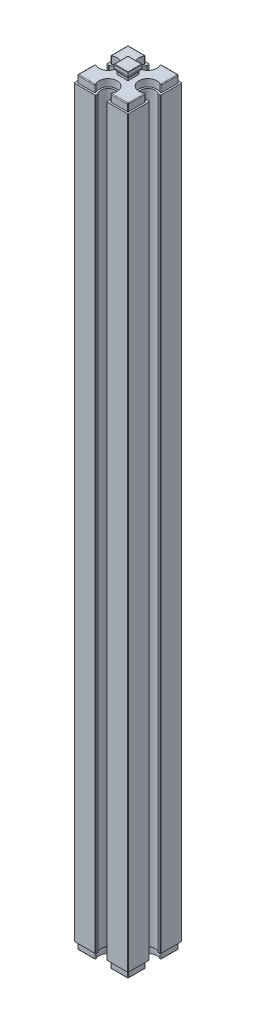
ISO-10303-21;
HEADER;
FILE_DESCRIPTION(('STEP AP214'),'2;1');
FILE_NAME('part.step','',(''),(''),'','','');
FILE_SCHEMA(('AUTOMOTIVE_DESIGN { 1 0 10303 214 1 1 1 1 }'));
ENDSEC;
DATA;
#1=APPLICATION_CONTEXT('core data for automotive mechanical design processes');
#2=APPLICATION_PROTOCOL_DEFINITION('international standard','automotive_design',2000,#1);
#3=PRODUCT_CONTEXT('',#1,'mechanical');
#4=PRODUCT('Part','Part','',(#3));
#5=PRODUCT_RELATED_PRODUCT_CATEGORY('part','',(#4));
#6=PRODUCT_DEFINITION_FORMATION('','',#4);
#7=PRODUCT_DEFINITION_CONTEXT('part definition',#1,'design');
#8=PRODUCT_DEFINITION('design','',#6,#7);
#9=PRODUCT_DEFINITION_SHAPE('','',#8);
#10=(LENGTH_UNIT() NAMED_UNIT(*) SI_UNIT(.MILLI.,.METRE.));
#11=(NAMED_UNIT(*) PLANE_ANGLE_UNIT() SI_UNIT($,.RADIAN.));
#12=(NAMED_UNIT(*) SI_UNIT($,.STERADIAN.) SOLID_ANGLE_UNIT());
#13=UNCERTAINTY_MEASURE_WITH_UNIT(LENGTH_MEASURE(1.E-05),#10,'distance_accuracy_value','');
#14=(GEOMETRIC_REPRESENTATION_CONTEXT(3) GLOBAL_UNCERTAINTY_ASSIGNED_CONTEXT((#13)) GLOBAL_UNIT_ASSIGNED_CONTEXT((#10,
#11,#12)) REPRESENTATION_CONTEXT('',''));
#15=CARTESIAN_POINT('',(0.,0.,0.));
#16=DIRECTION('',(0.,0.,1.));
#17=DIRECTION('',(1.,0.,0.));
#18=AXIS2_PLACEMENT_3D('',#15,#16,#17);
#19=CARTESIAN_POINT('',(-2.,105.,1.50000000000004));
#20=DIRECTION('',(0.,0.,1.));
#21=DIRECTION('',(0.,-1.,0.));
#22=AXIS2_PLACEMENT_3D('',#19,#20,#21);
#23=PLANE('',#22);
#24=DIRECTION('',(1.,0.,0.));
#25=VECTOR('',#24,1.);
#26=CARTESIAN_POINT('',(-2.,105.,1.50000000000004));
#27=LINE('',#26,#25);
#28=CARTESIAN_POINT('',(-1.5,105.,1.50000000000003));
#29=VERTEX_POINT('',#28);
#30=CARTESIAN_POINT('',(1.5,105.,1.50000000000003));
#31=VERTEX_POINT('',#30);
#32=EDGE_CURVE('E932',#29,#31,#27,.T.);
#33=ORIENTED_EDGE('',*,*,#32,.T.);
#34=DIRECTION('',(0.,1.,0.));
#35=VECTOR('',#34,1.);
#36=CARTESIAN_POINT('',(1.5,105.,1.50000000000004));
#37=LINE('',#36,#35);
#38=CARTESIAN_POINT('',(1.5,105.677124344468,1.5));
#39=VERTEX_POINT('',#38);
#40=EDGE_CURVE('E895',#31,#39,#37,.T.);
#41=ORIENTED_EDGE('',*,*,#40,.T.);
#42=DIRECTION('',(1.,0.,0.));
#43=VECTOR('',#42,1.);
#44=CARTESIAN_POINT('',(-2.,105.677124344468,1.50000000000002));
#45=LINE('',#44,#43);
#46=CARTESIAN_POINT('',(-1.5,105.677124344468,1.5));
#47=VERTEX_POINT('',#46);
#48=EDGE_CURVE('E933',#47,#39,#45,.T.);
#49=ORIENTED_EDGE('',*,*,#48,.F.);
#50=DIRECTION('',(0.,-1.,0.));
#51=VECTOR('',#50,1.);
#52=CARTESIAN_POINT('',(-1.5,105.,1.50000000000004));
#53=LINE('',#52,#51);
#54=EDGE_CURVE('E924',#47,#29,#53,.T.);
#55=ORIENTED_EDGE('',*,*,#54,.T.);
#56=EDGE_LOOP('',(#33,#41,#49,#55));
#57=FACE_BOUND('',#56,.T.);
#58=ADVANCED_FACE('F41',(#57),#23,.T.);
#59=CARTESIAN_POINT('',(-2.,107.,0.));
#60=DIRECTION('',(1.,0.,0.));
#61=DIRECTION('',(0.,0.,-1.));
#62=AXIS2_PLACEMENT_3D('',#59,#60,#61);
#63=CYLINDRICAL_SURFACE('',#62,2.);
#64=ORIENTED_EDGE('',*,*,#48,.T.);
#65=CARTESIAN_POINT('',(0.,107.,0.));
#66=DIRECTION('',(0.707106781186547,0.,-0.707106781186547));
#67=DIRECTION('',(0.707106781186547,0.,0.707106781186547));
#68=AXIS2_PLACEMENT_3D('',#65,#66,#67);
#69=ELLIPSE('',#68,2.8284271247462,2.00000000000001);
#70=CARTESIAN_POINT('',(1.95,106.555590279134,1.95));
#71=VERTEX_POINT('',#70);
#72=EDGE_CURVE('E901',#39,#71,#69,.F.);
#73=ORIENTED_EDGE('',*,*,#72,.T.);
#74=DIRECTION('',(1.,0.,0.));
#75=VECTOR('',#74,1.);
#76=CARTESIAN_POINT('',(-2.,106.555590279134,1.95000000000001));
#77=LINE('',#76,#75);
#78=CARTESIAN_POINT('',(-1.95,106.555590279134,1.95));
#79=VERTEX_POINT('',#78);
#80=EDGE_CURVE('E937',#79,#71,#77,.T.);
#81=ORIENTED_EDGE('',*,*,#80,.F.);
#82=CARTESIAN_POINT('',(0.,107.,0.));
#83=DIRECTION('',(0.707106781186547,0.,0.707106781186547));
#84=DIRECTION('',(0.707106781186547,0.,-0.707106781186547));
#85=AXIS2_PLACEMENT_3D('',#82,#83,#84);
#86=ELLIPSE('',#85,2.8284271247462,2.00000000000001);
#87=EDGE_CURVE('E921',#79,#47,#86,.T.);
#88=ORIENTED_EDGE('',*,*,#87,.T.);
#89=EDGE_LOOP('',(#64,#73,#81,#88));
#90=FACE_BOUND('',#89,.T.);
#91=ADVANCED_FACE('F1766',(#90),#63,.T.);
#92=CARTESIAN_POINT('',(-2.,107.5,1.94999999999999));
#93=DIRECTION('',(0.,0.,1.));
#94=DIRECTION('',(0.,-1.,0.));
#95=AXIS2_PLACEMENT_3D('',#92,#93,#94);
#96=PLANE('',#95);
#97=DIRECTION('',(0.,1.,0.));
#98=VECTOR('',#97,1.);
#99=CARTESIAN_POINT('',(1.95,107.5,1.94999999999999));
#100=LINE('',#99,#98);
#101=CARTESIAN_POINT('',(1.95,107.4,1.94999999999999));
#102=VERTEX_POINT('',#101);
#103=EDGE_CURVE('E906',#71,#102,#100,.T.);
#104=ORIENTED_EDGE('',*,*,#103,.T.);
#105=DIRECTION('',(1.,0.,0.));
#106=VECTOR('',#105,1.);
#107=CARTESIAN_POINT('',(-2.,107.4,1.94999999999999));
#108=LINE('',#107,#106);
#109=CARTESIAN_POINT('',(-1.95,107.4,1.94999999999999));
#110=VERTEX_POINT('',#109);
#111=EDGE_CURVE('E1091',#102,#110,#108,.F.);
#112=ORIENTED_EDGE('',*,*,#111,.T.);
#113=DIRECTION('',(0.,-1.,0.));
#114=VECTOR('',#113,1.);
#115=CARTESIAN_POINT('',(-1.95,107.5,1.94999999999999));
#116=LINE('',#115,#114);
#117=EDGE_CURVE('E930',#110,#79,#116,.T.);
#118=ORIENTED_EDGE('',*,*,#117,.T.);
#119=ORIENTED_EDGE('',*,*,#80,.T.);
#120=EDGE_LOOP('',(#104,#112,#118,#119));
#121=FACE_BOUND('',#120,.T.);
#122=ADVANCED_FACE('F1772',(#121),#96,.T.);
#123=CARTESIAN_POINT('',(-2.,107.5,1.94999999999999));
#124=DIRECTION('',(0.,1.,0.));
#125=DIRECTION('',(0.,0.,1.));
#126=AXIS2_PLACEMENT_3D('',#123,#124,#125);
#127=PLANE('',#126);
#128=DIRECTION('',(0.,0.,-1.));
#129=VECTOR('',#128,1.);
#130=CARTESIAN_POINT('',(1.85,107.5,1.94999999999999));
#131=LINE('',#130,#129);
#132=CARTESIAN_POINT('',(1.85,107.5,1.84999999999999));
#133=VERTEX_POINT('',#132);
#134=CARTESIAN_POINT('',(1.85,107.5,-1.85));
#135=VERTEX_POINT('',#134);
#136=EDGE_CURVE('E1084',#133,#135,#131,.T.);
#137=ORIENTED_EDGE('',*,*,#136,.T.);
#138=DIRECTION('',(1.,0.,0.));
#139=VECTOR('',#138,1.);
#140=CARTESIAN_POINT('',(-2.,107.5,-1.85));
#141=LINE('',#140,#139);
#142=CARTESIAN_POINT('',(-1.85,107.5,-1.85));
#143=VERTEX_POINT('',#142);
#144=EDGE_CURVE('E1086',#135,#143,#141,.F.);
#145=ORIENTED_EDGE('',*,*,#144,.T.);
#146=DIRECTION('',(0.,0.,-1.));
#147=VECTOR('',#146,1.);
#148=CARTESIAN_POINT('',(-1.85,107.5,1.94999999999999));
#149=LINE('',#148,#147);
#150=CARTESIAN_POINT('',(-1.85,107.5,1.84999999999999));
#151=VERTEX_POINT('',#150);
#152=EDGE_CURVE('E1080',#143,#151,#149,.F.);
#153=ORIENTED_EDGE('',*,*,#152,.T.);
#154=DIRECTION('',(1.,0.,0.));
#155=VECTOR('',#154,1.);
#156=CARTESIAN_POINT('',(-2.,107.5,1.84999999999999));
#157=LINE('',#156,#155);
#158=EDGE_CURVE('E1082',#151,#133,#157,.T.);
#159=ORIENTED_EDGE('',*,*,#158,.T.);
#160=EDGE_LOOP('',(#137,#145,#153,#159));
#161=FACE_BOUND('',#160,.T.);
#162=ADVANCED_FACE('F1872',(#161),#127,.T.);
#163=CARTESIAN_POINT('',(-2.,107.5,-1.95));
#164=DIRECTION('',(0.,0.,-1.));
#165=DIRECTION('',(-1.,0.,0.));
#166=AXIS2_PLACEMENT_3D('',#163,#164,#165);
#167=PLANE('',#166);
#168=DIRECTION('',(0.,1.,0.));
#169=VECTOR('',#168,1.);
#170=CARTESIAN_POINT('',(-1.95,107.5,-1.95));
#171=LINE('',#170,#169);
#172=CARTESIAN_POINT('',(-1.95,106.555590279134,-1.94999999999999));
#173=VERTEX_POINT('',#172);
#174=CARTESIAN_POINT('',(-1.95,107.4,-1.95));
#175=VERTEX_POINT('',#174);
#176=EDGE_CURVE('E927',#173,#175,#171,.T.);
#177=ORIENTED_EDGE('',*,*,#176,.T.);
#178=DIRECTION('',(1.,0.,0.));
#179=VECTOR('',#178,1.);
#180=CARTESIAN_POINT('',(-2.,107.4,-1.95));
#181=LINE('',#180,#179);
#182=CARTESIAN_POINT('',(1.95,107.4,-1.95));
#183=VERTEX_POINT('',#182);
#184=EDGE_CURVE('E1077',#175,#183,#181,.T.);
#185=ORIENTED_EDGE('',*,*,#184,.T.);
#186=DIRECTION('',(0.,-1.,0.));
#187=VECTOR('',#186,1.);
#188=CARTESIAN_POINT('',(1.95,107.5,-1.95));
#189=LINE('',#188,#187);
#190=CARTESIAN_POINT('',(1.95,106.555590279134,-1.94999999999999));
#191=VERTEX_POINT('',#190);
#192=EDGE_CURVE('E904',#183,#191,#189,.T.);
#193=ORIENTED_EDGE('',*,*,#192,.T.);
#194=DIRECTION('',(1.,0.,0.));
#195=VECTOR('',#194,1.);
#196=CARTESIAN_POINT('',(-2.,106.555590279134,-1.95));
#197=LINE('',#196,#195);
#198=EDGE_CURVE('E940',#173,#191,#197,.T.);
#199=ORIENTED_EDGE('',*,*,#198,.F.);
#200=EDGE_LOOP('',(#177,#185,#193,#199));
#201=FACE_BOUND('',#200,.T.);
#202=ADVANCED_FACE('F1842',(#201),#167,.T.);
#203=CARTESIAN_POINT('',(-2.,107.,0.));
#204=DIRECTION('',(1.,0.,0.));
#205=DIRECTION('',(0.,0.,-1.));
#206=AXIS2_PLACEMENT_3D('',#203,#204,#205);
#207=CYLINDRICAL_SURFACE('',#206,2.);
#208=ORIENTED_EDGE('',*,*,#198,.T.);
#209=CARTESIAN_POINT('',(0.,107.,0.));
#210=DIRECTION('',(0.707106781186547,0.,0.707106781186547));
#211=DIRECTION('',(0.707106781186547,0.,-0.707106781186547));
#212=AXIS2_PLACEMENT_3D('',#209,#210,#211);
#213=ELLIPSE('',#212,2.8284271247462,2.00000000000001);
#214=CARTESIAN_POINT('',(1.5,105.677124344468,-1.5));
#215=VERTEX_POINT('',#214);
#216=EDGE_CURVE('E898',#191,#215,#213,.F.);
#217=ORIENTED_EDGE('',*,*,#216,.T.);
#218=DIRECTION('',(1.,0.,0.));
#219=VECTOR('',#218,1.);
#220=CARTESIAN_POINT('',(-2.,105.677124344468,-1.5));
#221=LINE('',#220,#219);
#222=CARTESIAN_POINT('',(-1.5,105.677124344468,-1.5));
#223=VERTEX_POINT('',#222);
#224=EDGE_CURVE('E943',#223,#215,#221,.T.);
#225=ORIENTED_EDGE('',*,*,#224,.F.);
#226=CARTESIAN_POINT('',(0.,107.,0.));
#227=DIRECTION('',(0.707106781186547,0.,-0.707106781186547));
#228=DIRECTION('',(0.707106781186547,0.,0.707106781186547));
#229=AXIS2_PLACEMENT_3D('',#226,#227,#228);
#230=ELLIPSE('',#229,2.8284271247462,2.00000000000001);
#231=EDGE_CURVE('E918',#223,#173,#230,.T.);
#232=ORIENTED_EDGE('',*,*,#231,.T.);
#233=EDGE_LOOP('',(#208,#217,#225,#232));
#234=FACE_BOUND('',#233,.T.);
#235=ADVANCED_FACE('F1837',(#234),#207,.T.);
#236=CARTESIAN_POINT('',(-2.,105.,-1.5));
#237=DIRECTION('',(0.,0.,-1.));
#238=DIRECTION('',(-1.,0.,0.));
#239=AXIS2_PLACEMENT_3D('',#236,#237,#238);
#240=PLANE('',#239);
#241=ORIENTED_EDGE('',*,*,#224,.T.);
#242=DIRECTION('',(0.,-1.,0.));
#243=VECTOR('',#242,1.);
#244=CARTESIAN_POINT('',(1.5,105.,-1.5));
#245=LINE('',#244,#243);
#246=CARTESIAN_POINT('',(1.5,105.,-1.5));
#247=VERTEX_POINT('',#246);
#248=EDGE_CURVE('E892',#215,#247,#245,.T.);
#249=ORIENTED_EDGE('',*,*,#248,.T.);
#250=DIRECTION('',(1.,0.,0.));
#251=VECTOR('',#250,1.);
#252=CARTESIAN_POINT('',(-2.,105.,-1.5));
#253=LINE('',#252,#251);
#254=CARTESIAN_POINT('',(-1.5,105.,-1.5));
#255=VERTEX_POINT('',#254);
#256=EDGE_CURVE('E946',#255,#247,#253,.T.);
#257=ORIENTED_EDGE('',*,*,#256,.F.);
#258=DIRECTION('',(0.,1.,0.));
#259=VECTOR('',#258,1.);
#260=CARTESIAN_POINT('',(-1.5,105.,-1.5));
#261=LINE('',#260,#259);
#262=EDGE_CURVE('E1068',#255,#223,#261,.T.);
#263=ORIENTED_EDGE('',*,*,#262,.T.);
#264=EDGE_LOOP('',(#241,#249,#257,#263));
#265=FACE_BOUND('',#264,.T.);
#266=ADVANCED_FACE('F1777',(#265),#240,.T.);
#267=CARTESIAN_POINT('',(0.,103.,-5.5));
#268=DIRECTION('',(0.,1.,0.));
#269=DIRECTION('',(0.,0.,1.));
#270=AXIS2_PLACEMENT_3D('',#267,#268,#269);
#271=PLANE('',#270);
#272=DIRECTION('',(0.,0.,-1.));
#273=VECTOR('',#272,1.);
#274=CARTESIAN_POINT('',(-1.5,103.,-6.82287565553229));
#275=LINE('',#274,#273);
#276=CARTESIAN_POINT('',(-1.5,103.,-6.82287565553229));
#277=VERTEX_POINT('',#276);
#278=CARTESIAN_POINT('',(-1.5,103.,-7.3));
#279=VERTEX_POINT('',#278);
#280=EDGE_CURVE('E1044',#277,#279,#275,.T.);
#281=ORIENTED_EDGE('',*,*,#280,.T.);
#282=CARTESIAN_POINT('',(-1.7,103.,-7.3));
#283=DIRECTION('',(0.,1.,0.));
#284=DIRECTION('',(0.,0.,1.));
#285=AXIS2_PLACEMENT_3D('',#282,#283,#284);
#286=CIRCLE('',#285,0.2);
#287=CARTESIAN_POINT('',(-1.7,103.,-7.5));
#288=VERTEX_POINT('',#287);
#289=EDGE_CURVE('E1554',#279,#288,#286,.T.);
#290=ORIENTED_EDGE('',*,*,#289,.T.);
#291=DIRECTION('',(-1.,0.,0.));
#292=VECTOR('',#291,1.);
#293=CARTESIAN_POINT('',(-7.5,103.,-7.5));
#294=LINE('',#293,#292);
#295=CARTESIAN_POINT('',(-7.3,103.,-7.5));
#296=VERTEX_POINT('',#295);
#297=EDGE_CURVE('E1047',#288,#296,#294,.T.);
#298=ORIENTED_EDGE('',*,*,#297,.T.);
#299=CARTESIAN_POINT('',(-7.3,103.,-7.3));
#300=DIRECTION('',(0.,1.,0.));
#301=DIRECTION('',(0.,0.,1.));
#302=AXIS2_PLACEMENT_3D('',#299,#300,#301);
#303=CIRCLE('',#302,0.2);
#304=CARTESIAN_POINT('',(-7.5,103.,-7.3));
#305=VERTEX_POINT('',#304);
#306=EDGE_CURVE('E1531',#296,#305,#303,.T.);
#307=ORIENTED_EDGE('',*,*,#306,.T.);
#308=DIRECTION('',(0.,0.,1.));
#309=VECTOR('',#308,1.);
#310=CARTESIAN_POINT('',(-7.49999999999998,103.,-1.50000000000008));
#311=LINE('',#310,#309);
#312=CARTESIAN_POINT('',(-7.49999999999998,103.,-1.70000000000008));
#313=VERTEX_POINT('',#312);
#314=EDGE_CURVE('E964',#305,#313,#311,.T.);
#315=ORIENTED_EDGE('',*,*,#314,.T.);
#316=CARTESIAN_POINT('',(-7.29999999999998,103.,-1.70000000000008));
#317=DIRECTION('',(0.,1.,0.));
#318=DIRECTION('',(0.,0.,1.));
#319=AXIS2_PLACEMENT_3D('',#316,#317,#318);
#320=CIRCLE('',#319,0.2);
#321=CARTESIAN_POINT('',(-7.29999999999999,103.,-1.50000000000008));
#322=VERTEX_POINT('',#321);
#323=EDGE_CURVE('E1533',#313,#322,#320,.T.);
#324=ORIENTED_EDGE('',*,*,#323,.T.);
#325=DIRECTION('',(1.,0.,0.));
#326=VECTOR('',#325,1.);
#327=CARTESIAN_POINT('',(-6.82287565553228,103.,-1.50000000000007));
#328=LINE('',#327,#326);
#329=CARTESIAN_POINT('',(-6.89642400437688,103.,-1.50000000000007));
#330=VERTEX_POINT('',#329);
#331=EDGE_CURVE('E1001',#322,#330,#328,.T.);
#332=ORIENTED_EDGE('',*,*,#331,.T.);
#333=CARTESIAN_POINT('',(-6.89642400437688,103.,-1.70000000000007));
#334=DIRECTION('',(0.,1.,0.));
#335=DIRECTION('',(0.,0.,1.));
#336=AXIS2_PLACEMENT_3D('',#333,#334,#335);
#337=CIRCLE('',#336,0.2);
#338=CARTESIAN_POINT('',(-6.76947636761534,103.,-1.54545454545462));
#339=VERTEX_POINT('',#338);
#340=EDGE_CURVE('E1539',#330,#339,#337,.T.);
#341=ORIENTED_EDGE('',*,*,#340,.T.);
#342=CARTESIAN_POINT('',(-5.5,103.,0.));
#343=DIRECTION('',(0.,-1.,0.));
#344=DIRECTION('',(0.,0.,1.));
#345=AXIS2_PLACEMENT_3D('',#342,#343,#344);
#346=CIRCLE('',#345,2.);
#347=CARTESIAN_POINT('',(-6.82287565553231,103.,1.49999999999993));
#348=VERTEX_POINT('',#347);
#349=EDGE_CURVE('E1004',#339,#348,#346,.T.);
#350=ORIENTED_EDGE('',*,*,#349,.T.);
#351=DIRECTION('',(-1.,0.,0.));
#352=VECTOR('',#351,1.);
#353=CARTESIAN_POINT('',(-6.82287565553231,103.,1.49999999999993));
#354=LINE('',#353,#352);
#355=CARTESIAN_POINT('',(-7.30000000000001,103.,1.49999999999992));
#356=VERTEX_POINT('',#355);
#357=EDGE_CURVE('E1006',#348,#356,#354,.T.);
#358=ORIENTED_EDGE('',*,*,#357,.T.);
#359=CARTESIAN_POINT('',(-7.30000000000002,103.,1.69999999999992));
#360=DIRECTION('',(0.,1.,0.));
#361=DIRECTION('',(0.,0.,1.));
#362=AXIS2_PLACEMENT_3D('',#359,#360,#361);
#363=CIRCLE('',#362,0.2);
#364=CARTESIAN_POINT('',(-7.50000000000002,103.,1.69999999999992));
#365=VERTEX_POINT('',#364);
#366=EDGE_CURVE('E1535',#356,#365,#363,.T.);
#367=ORIENTED_EDGE('',*,*,#366,.T.);
#368=DIRECTION('',(0.,0.,1.));
#369=VECTOR('',#368,1.);
#370=CARTESIAN_POINT('',(-7.50000000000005,103.,7.49999999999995));
#371=LINE('',#370,#369);
#372=CARTESIAN_POINT('',(-7.50000000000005,103.,7.29999999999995));
#373=VERTEX_POINT('',#372);
#374=EDGE_CURVE('E1009',#365,#373,#371,.T.);
#375=ORIENTED_EDGE('',*,*,#374,.T.);
#376=CARTESIAN_POINT('',(-7.30000000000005,103.,7.29999999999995));
#377=DIRECTION('',(0.,1.,0.));
#378=DIRECTION('',(0.,0.,1.));
#379=AXIS2_PLACEMENT_3D('',#376,#377,#378);
#380=CIRCLE('',#379,0.2);
#381=CARTESIAN_POINT('',(-7.30000000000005,103.,7.49999999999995));
#382=VERTEX_POINT('',#381);
#383=EDGE_CURVE('E1537',#373,#382,#380,.T.);
#384=ORIENTED_EDGE('',*,*,#383,.T.);
#385=DIRECTION('',(1.,0.,0.));
#386=VECTOR('',#385,1.);
#387=CARTESIAN_POINT('',(-1.50000000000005,103.,7.49999999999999));
#388=LINE('',#387,#386);
#389=CARTESIAN_POINT('',(-1.70000000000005,103.,7.49999999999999));
#390=VERTEX_POINT('',#389);
#391=EDGE_CURVE('E1012',#382,#390,#388,.T.);
#392=ORIENTED_EDGE('',*,*,#391,.T.);
#393=CARTESIAN_POINT('',(-1.70000000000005,103.,7.29999999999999));
#394=DIRECTION('',(0.,1.,0.));
#395=DIRECTION('',(0.,0.,1.));
#396=AXIS2_PLACEMENT_3D('',#393,#394,#395);
#397=CIRCLE('',#396,0.2);
#398=CARTESIAN_POINT('',(-1.50000000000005,103.,7.29999999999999));
#399=VERTEX_POINT('',#398);
#400=EDGE_CURVE('E1543',#390,#399,#397,.T.);
#401=ORIENTED_EDGE('',*,*,#400,.T.);
#402=DIRECTION('',(0.,0.,-1.));
#403=VECTOR('',#402,1.);
#404=CARTESIAN_POINT('',(-1.50000000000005,103.,6.82287565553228));
#405=LINE('',#404,#403);
#406=CARTESIAN_POINT('',(-1.50000000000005,103.,6.82287565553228));
#407=VERTEX_POINT('',#406);
#408=EDGE_CURVE('E1015',#399,#407,#405,.T.);
#409=ORIENTED_EDGE('',*,*,#408,.T.);
#410=CARTESIAN_POINT('',(0.,103.,5.5));
#411=DIRECTION('',(0.,-1.,0.));
#412=DIRECTION('',(0.,0.,1.));
#413=AXIS2_PLACEMENT_3D('',#410,#411,#412);
#414=CIRCLE('',#413,2.);
#415=CARTESIAN_POINT('',(1.49999999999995,103.,6.82287565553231));
#416=VERTEX_POINT('',#415);
#417=EDGE_CURVE('E1017',#407,#416,#414,.T.);
#418=ORIENTED_EDGE('',*,*,#417,.T.);
#419=DIRECTION('',(0.,0.,1.));
#420=VECTOR('',#419,1.);
#421=CARTESIAN_POINT('',(1.49999999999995,103.,6.82287565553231));
#422=LINE('',#421,#420);
#423=CARTESIAN_POINT('',(1.49999999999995,103.,7.30000000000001));
#424=VERTEX_POINT('',#423);
#425=EDGE_CURVE('E1019',#416,#424,#422,.T.);
#426=ORIENTED_EDGE('',*,*,#425,.T.);
#427=CARTESIAN_POINT('',(1.69999999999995,103.,7.30000000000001));
#428=DIRECTION('',(0.,1.,0.));
#429=DIRECTION('',(0.,0.,1.));
#430=AXIS2_PLACEMENT_3D('',#427,#428,#429);
#431=CIRCLE('',#430,0.2);
#432=CARTESIAN_POINT('',(1.69999999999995,103.,7.50000000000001));
#433=VERTEX_POINT('',#432);
#434=EDGE_CURVE('E1541',#424,#433,#431,.T.);
#435=ORIENTED_EDGE('',*,*,#434,.T.);
#436=DIRECTION('',(1.,0.,0.));
#437=VECTOR('',#436,1.);
#438=CARTESIAN_POINT('',(7.49999999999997,103.,7.50000000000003));
#439=LINE('',#438,#437);
#440=CARTESIAN_POINT('',(7.29999999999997,103.,7.50000000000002));
#441=VERTEX_POINT('',#440);
#442=EDGE_CURVE('E1022',#433,#441,#439,.T.);
#443=ORIENTED_EDGE('',*,*,#442,.T.);
#444=CARTESIAN_POINT('',(7.29999999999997,103.,7.30000000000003));
#445=DIRECTION('',(0.,1.,0.));
#446=DIRECTION('',(0.,0.,1.));
#447=AXIS2_PLACEMENT_3D('',#444,#445,#446);
#448=CIRCLE('',#447,0.2);
#449=CARTESIAN_POINT('',(7.49999999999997,103.,7.30000000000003));
#450=VERTEX_POINT('',#449);
#451=EDGE_CURVE('E1545',#441,#450,#448,.T.);
#452=ORIENTED_EDGE('',*,*,#451,.T.);
#453=DIRECTION('',(0.,0.,-1.));
#454=VECTOR('',#453,1.);
#455=CARTESIAN_POINT('',(7.49999999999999,103.,1.50000000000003));
#456=LINE('',#455,#454);
#457=CARTESIAN_POINT('',(7.49999999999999,103.,1.70000000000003));
#458=VERTEX_POINT('',#457);
#459=EDGE_CURVE('E1025',#450,#458,#456,.T.);
#460=ORIENTED_EDGE('',*,*,#459,.T.);
#461=CARTESIAN_POINT('',(7.29999999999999,103.,1.70000000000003));
#462=DIRECTION('',(0.,1.,0.));
#463=DIRECTION('',(0.,0.,1.));
#464=AXIS2_PLACEMENT_3D('',#461,#462,#463);
#465=CIRCLE('',#464,0.2);
#466=CARTESIAN_POINT('',(7.29999999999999,103.,1.50000000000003));
#467=VERTEX_POINT('',#466);
#468=EDGE_CURVE('E1547',#458,#467,#465,.T.);
#469=ORIENTED_EDGE('',*,*,#468,.T.);
#470=DIRECTION('',(-1.,0.,0.));
#471=VECTOR('',#470,1.);
#472=CARTESIAN_POINT('',(6.82287565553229,103.,1.50000000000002));
#473=LINE('',#472,#471);
#474=CARTESIAN_POINT('',(6.82287565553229,103.,1.50000000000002));
#475=VERTEX_POINT('',#474);
#476=EDGE_CURVE('E1028',#467,#475,#473,.T.);
#477=ORIENTED_EDGE('',*,*,#476,.T.);
#478=CARTESIAN_POINT('',(5.5,103.,0.));
#479=DIRECTION('',(0.,-1.,0.));
#480=DIRECTION('',(0.,0.,1.));
#481=AXIS2_PLACEMENT_3D('',#478,#479,#480);
#482=CIRCLE('',#481,2.);
#483=CARTESIAN_POINT('',(6.8228756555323,103.,-1.49999999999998));
#484=VERTEX_POINT('',#483);
#485=EDGE_CURVE('E1030',#475,#484,#482,.T.);
#486=ORIENTED_EDGE('',*,*,#485,.T.);
#487=DIRECTION('',(1.,0.,0.));
#488=VECTOR('',#487,1.);
#489=CARTESIAN_POINT('',(6.8228756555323,103.,-1.49999999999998));
#490=LINE('',#489,#488);
#491=CARTESIAN_POINT('',(7.3,103.,-1.49999999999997));
#492=VERTEX_POINT('',#491);
#493=EDGE_CURVE('E1032',#484,#492,#490,.T.);
#494=ORIENTED_EDGE('',*,*,#493,.T.);
#495=CARTESIAN_POINT('',(7.30000000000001,103.,-1.69999999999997));
#496=DIRECTION('',(0.,1.,0.));
#497=DIRECTION('',(0.,0.,1.));
#498=AXIS2_PLACEMENT_3D('',#495,#496,#497);
#499=CIRCLE('',#498,0.2);
#500=CARTESIAN_POINT('',(7.50000000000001,103.,-1.69999999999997));
#501=VERTEX_POINT('',#500);
#502=EDGE_CURVE('E1549',#492,#501,#499,.T.);
#503=ORIENTED_EDGE('',*,*,#502,.T.);
#504=DIRECTION('',(0.,0.,-1.));
#505=VECTOR('',#504,1.);
#506=CARTESIAN_POINT('',(7.5,103.,-7.5));
#507=LINE('',#506,#505);
#508=CARTESIAN_POINT('',(7.5,103.,-7.3));
#509=VERTEX_POINT('',#508);
#510=EDGE_CURVE('E1035',#501,#509,#507,.T.);
#511=ORIENTED_EDGE('',*,*,#510,.T.);
#512=CARTESIAN_POINT('',(7.3,103.,-7.3));
#513=DIRECTION('',(0.,1.,0.));
#514=DIRECTION('',(0.,0.,1.));
#515=AXIS2_PLACEMENT_3D('',#512,#513,#514);
#516=CIRCLE('',#515,0.2);
#517=CARTESIAN_POINT('',(7.3,103.,-7.5));
#518=VERTEX_POINT('',#517);
#519=EDGE_CURVE('E1551',#509,#518,#516,.T.);
#520=ORIENTED_EDGE('',*,*,#519,.T.);
#521=DIRECTION('',(-1.,0.,0.));
#522=VECTOR('',#521,1.);
#523=CARTESIAN_POINT('',(1.5,103.,-7.5));
#524=LINE('',#523,#522);
#525=CARTESIAN_POINT('',(1.7,103.,-7.5));
#526=VERTEX_POINT('',#525);
#527=EDGE_CURVE('E1038',#518,#526,#524,.T.);
#528=ORIENTED_EDGE('',*,*,#527,.T.);
#529=CARTESIAN_POINT('',(1.7,103.,-7.3));
#530=DIRECTION('',(0.,1.,0.));
#531=DIRECTION('',(0.,0.,1.));
#532=AXIS2_PLACEMENT_3D('',#529,#530,#531);
#533=CIRCLE('',#532,0.2);
#534=CARTESIAN_POINT('',(1.5,103.,-7.3));
#535=VERTEX_POINT('',#534);
#536=EDGE_CURVE('E56',#526,#535,#533,.T.);
#537=ORIENTED_EDGE('',*,*,#536,.T.);
#538=DIRECTION('',(0.,0.,1.));
#539=VECTOR('',#538,1.);
#540=CARTESIAN_POINT('',(1.5,103.,-6.82287565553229));
#541=LINE('',#540,#539);
#542=CARTESIAN_POINT('',(1.5,103.,-6.82287565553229));
#543=VERTEX_POINT('',#542);
#544=EDGE_CURVE('E1040',#535,#543,#541,.T.);
#545=ORIENTED_EDGE('',*,*,#544,.T.);
#546=CARTESIAN_POINT('',(0.,103.,-5.5));
#547=DIRECTION('',(0.,-1.,0.));
#548=DIRECTION('',(0.,0.,1.));
#549=AXIS2_PLACEMENT_3D('',#546,#547,#548);
#550=CIRCLE('',#549,2.);
#551=EDGE_CURVE('E1042',#543,#277,#550,.T.);
#552=ORIENTED_EDGE('',*,*,#551,.T.);
#553=EDGE_LOOP('',(#281,#290,#298,#307,#315,#324,#332,#341,#350,#358,#367,#375,#384,#392,#401,
#409,#418,#426,#435,#443,#452,#460,#469,#477,#486,#494,#503,#511,#520,#528,#537,#545,#552));
#554=FACE_BOUND('',#553,.T.);
#555=DIRECTION('',(0.,0.,1.));
#556=VECTOR('',#555,1.);
#557=CARTESIAN_POINT('',(-7.,103.,-7.));
#558=LINE('',#557,#556);
#559=CARTESIAN_POINT('',(-7.,103.,-6.8));
#560=VERTEX_POINT('',#559);
#561=CARTESIAN_POINT('',(-7.,103.,-2.36643191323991));
#562=VERTEX_POINT('',#561);
#563=EDGE_CURVE('E967',#560,#562,#558,.T.);
#564=ORIENTED_EDGE('',*,*,#563,.F.);
#565=CARTESIAN_POINT('',(-6.8,103.,-6.8));
#566=DIRECTION('',(0.,1.,0.));
#567=DIRECTION('',(0.,0.,1.));
#568=AXIS2_PLACEMENT_3D('',#565,#566,#567);
#569=CIRCLE('',#568,0.2);
#570=CARTESIAN_POINT('',(-6.8,103.,-7.));
#571=VERTEX_POINT('',#570);
#572=EDGE_CURVE('E1362',#560,#571,#569,.F.);
#573=ORIENTED_EDGE('',*,*,#572,.T.);
#574=DIRECTION('',(-1.,0.,0.));
#575=VECTOR('',#574,1.);
#576=CARTESIAN_POINT('',(-2.,103.,-7.));
#577=LINE('',#576,#575);
#578=CARTESIAN_POINT('',(-2.36643191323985,103.,-7.));
#579=VERTEX_POINT('',#578);
#580=EDGE_CURVE('E936',#579,#571,#577,.T.);
#581=ORIENTED_EDGE('',*,*,#580,.F.);
#582=CARTESIAN_POINT('',(-2.36643191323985,103.,-6.8));
#583=DIRECTION('',(0.,1.,0.));
#584=DIRECTION('',(0.,0.,1.));
#585=AXIS2_PLACEMENT_3D('',#582,#583,#584);
#586=CIRCLE('',#585,0.2);
#587=CARTESIAN_POINT('',(-2.19114066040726,103.,-6.7037037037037));
#588=VERTEX_POINT('',#587);
#589=EDGE_CURVE('E1364',#579,#588,#586,.F.);
#590=ORIENTED_EDGE('',*,*,#589,.T.);
#591=CARTESIAN_POINT('',(0.,103.,-5.5));
#592=DIRECTION('',(0.,-1.,0.));
#593=DIRECTION('',(0.,0.,1.));
#594=AXIS2_PLACEMENT_3D('',#591,#592,#593);
#595=CIRCLE('',#594,2.5);
#596=CARTESIAN_POINT('',(2.19114066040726,103.,-6.7037037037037));
#597=VERTEX_POINT('',#596);
#598=EDGE_CURVE('E955',#597,#588,#595,.T.);
#599=ORIENTED_EDGE('',*,*,#598,.F.);
#600=CARTESIAN_POINT('',(2.36643191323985,103.,-6.8));
#601=DIRECTION('',(0.,1.,0.));
#602=DIRECTION('',(0.,0.,1.));
#603=AXIS2_PLACEMENT_3D('',#600,#601,#602);
#604=CIRCLE('',#603,0.2);
#605=CARTESIAN_POINT('',(2.36643191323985,103.,-7.));
#606=VERTEX_POINT('',#605);
#607=EDGE_CURVE('E1366',#597,#606,#604,.F.);
#608=ORIENTED_EDGE('',*,*,#607,.T.);
#609=DIRECTION('',(-1.,0.,0.));
#610=VECTOR('',#609,1.);
#611=CARTESIAN_POINT('',(7.,103.,-7.));
#612=LINE('',#611,#610);
#613=CARTESIAN_POINT('',(6.80000000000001,103.,-7.));
#614=VERTEX_POINT('',#613);
#615=EDGE_CURVE('E994',#614,#606,#612,.T.);
#616=ORIENTED_EDGE('',*,*,#615,.F.);
#617=CARTESIAN_POINT('',(6.80000000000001,103.,-6.8));
#618=DIRECTION('',(0.,1.,0.));
#619=DIRECTION('',(0.,0.,1.));
#620=AXIS2_PLACEMENT_3D('',#617,#618,#619);
#621=CIRCLE('',#620,0.2);
#622=CARTESIAN_POINT('',(7.,103.,-6.8));
#623=VERTEX_POINT('',#622);
#624=EDGE_CURVE('E1368',#614,#623,#621,.F.);
#625=ORIENTED_EDGE('',*,*,#624,.T.);
#626=DIRECTION('',(0.,0.,-1.));
#627=VECTOR('',#626,1.);
#628=CARTESIAN_POINT('',(7.00000000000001,103.,-1.99999999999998));
#629=LINE('',#628,#627);
#630=CARTESIAN_POINT('',(7.00000000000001,103.,-2.36643191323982));
#631=VERTEX_POINT('',#630);
#632=EDGE_CURVE('E991',#631,#623,#629,.T.);
#633=ORIENTED_EDGE('',*,*,#632,.F.);
#634=CARTESIAN_POINT('',(6.80000000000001,103.,-2.36643191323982));
#635=DIRECTION('',(0.,1.,0.));
#636=DIRECTION('',(0.,0.,1.));
#637=AXIS2_PLACEMENT_3D('',#634,#635,#636);
#638=CIRCLE('',#637,0.2);
#639=CARTESIAN_POINT('',(6.70370370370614,103.,-2.1911406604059));
#640=VERTEX_POINT('',#639);
#641=EDGE_CURVE('E1370',#631,#640,#638,.F.);
#642=ORIENTED_EDGE('',*,*,#641,.T.);
#643=CARTESIAN_POINT('',(5.5,103.,0.));
#644=DIRECTION('',(0.,-1.,0.));
#645=DIRECTION('',(0.,0.,1.));
#646=AXIS2_PLACEMENT_3D('',#643,#644,#645);
#647=CIRCLE('',#646,2.49999999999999);
#648=CARTESIAN_POINT('',(6.70370370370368,103.,2.19114066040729));
#649=VERTEX_POINT('',#648);
#650=EDGE_CURVE('E988',#649,#640,#647,.T.);
#651=ORIENTED_EDGE('',*,*,#650,.F.);
#652=CARTESIAN_POINT('',(6.79999999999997,103.,2.36643191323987));
#653=DIRECTION('',(0.,1.,0.));
#654=DIRECTION('',(0.,0.,1.));
#655=AXIS2_PLACEMENT_3D('',#652,#653,#654);
#656=CIRCLE('',#655,0.2);
#657=CARTESIAN_POINT('',(6.99999999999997,103.,2.36643191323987));
#658=VERTEX_POINT('',#657);
#659=EDGE_CURVE('E1372',#649,#658,#656,.F.);
#660=ORIENTED_EDGE('',*,*,#659,.T.);
#661=DIRECTION('',(0.,0.,-1.));
#662=VECTOR('',#661,1.);
#663=CARTESIAN_POINT('',(6.99999999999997,103.,7.00000000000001));
#664=LINE('',#663,#662);
#665=CARTESIAN_POINT('',(6.99999999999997,103.,6.80000000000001));
#666=VERTEX_POINT('',#665);
#667=EDGE_CURVE('E985',#666,#658,#664,.T.);
#668=ORIENTED_EDGE('',*,*,#667,.F.);
#669=CARTESIAN_POINT('',(6.79999999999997,103.,6.80000000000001));
#670=DIRECTION('',(0.,1.,0.));
#671=DIRECTION('',(0.,0.,1.));
#672=AXIS2_PLACEMENT_3D('',#669,#670,#671);
#673=CIRCLE('',#672,0.2);
#674=CARTESIAN_POINT('',(6.79999999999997,103.,7.00000000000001));
#675=VERTEX_POINT('',#674);
#676=EDGE_CURVE('E1374',#666,#675,#673,.F.);
#677=ORIENTED_EDGE('',*,*,#676,.T.);
#678=DIRECTION('',(1.,0.,0.));
#679=VECTOR('',#678,1.);
#680=CARTESIAN_POINT('',(1.99999999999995,103.,7.00000000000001));
#681=LINE('',#680,#679);
#682=CARTESIAN_POINT('',(2.36643191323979,103.,7.00000000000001));
#683=VERTEX_POINT('',#682);
#684=EDGE_CURVE('E982',#683,#675,#681,.T.);
#685=ORIENTED_EDGE('',*,*,#684,.F.);
#686=CARTESIAN_POINT('',(2.36643191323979,103.,6.80000000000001));
#687=DIRECTION('',(0.,1.,0.));
#688=DIRECTION('',(0.,0.,1.));
#689=AXIS2_PLACEMENT_3D('',#686,#687,#688);
#690=CIRCLE('',#689,0.2);
#691=CARTESIAN_POINT('',(2.19114066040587,103.,6.70370370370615));
#692=VERTEX_POINT('',#691);
#693=EDGE_CURVE('E1376',#683,#692,#690,.F.);
#694=ORIENTED_EDGE('',*,*,#693,.T.);
#695=CARTESIAN_POINT('',(0.,103.,5.5));
#696=DIRECTION('',(0.,-1.,0.));
#697=DIRECTION('',(0.,0.,1.));
#698=AXIS2_PLACEMENT_3D('',#695,#696,#697);
#699=CIRCLE('',#698,2.49999999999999);
#700=CARTESIAN_POINT('',(-2.19114066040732,103.,6.70370370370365));
#701=VERTEX_POINT('',#700);
#702=EDGE_CURVE('E979',#701,#692,#699,.T.);
#703=ORIENTED_EDGE('',*,*,#702,.F.);
#704=CARTESIAN_POINT('',(-2.3664319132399,103.,6.79999999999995));
#705=DIRECTION('',(0.,1.,0.));
#706=DIRECTION('',(0.,0.,1.));
#707=AXIS2_PLACEMENT_3D('',#704,#705,#706);
#708=CIRCLE('',#707,0.2);
#709=CARTESIAN_POINT('',(-2.3664319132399,103.,6.99999999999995));
#710=VERTEX_POINT('',#709);
#711=EDGE_CURVE('E1378',#701,#710,#708,.F.);
#712=ORIENTED_EDGE('',*,*,#711,.T.);
#713=DIRECTION('',(1.,0.,0.));
#714=VECTOR('',#713,1.);
#715=CARTESIAN_POINT('',(-7.00000000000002,103.,6.99999999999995));
#716=LINE('',#715,#714);
#717=CARTESIAN_POINT('',(-6.80000000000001,103.,6.99999999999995));
#718=VERTEX_POINT('',#717);
#719=EDGE_CURVE('E976',#718,#710,#716,.T.);
#720=ORIENTED_EDGE('',*,*,#719,.F.);
#721=CARTESIAN_POINT('',(-6.80000000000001,103.,6.79999999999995));
#722=DIRECTION('',(0.,1.,0.));
#723=DIRECTION('',(0.,0.,1.));
#724=AXIS2_PLACEMENT_3D('',#721,#722,#723);
#725=CIRCLE('',#724,0.2);
#726=CARTESIAN_POINT('',(-7.00000000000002,103.,6.79999999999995));
#727=VERTEX_POINT('',#726);
#728=EDGE_CURVE('E1380',#718,#727,#725,.F.);
#729=ORIENTED_EDGE('',*,*,#728,.T.);
#730=DIRECTION('',(0.,0.,1.));
#731=VECTOR('',#730,1.);
#732=CARTESIAN_POINT('',(-7.00000000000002,103.,1.99999999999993));
#733=LINE('',#732,#731);
#734=CARTESIAN_POINT('',(-7.00000000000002,103.,2.36643191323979));
#735=VERTEX_POINT('',#734);
#736=EDGE_CURVE('E973',#735,#727,#733,.T.);
#737=ORIENTED_EDGE('',*,*,#736,.F.);
#738=CARTESIAN_POINT('',(-6.80000000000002,103.,2.36643191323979));
#739=DIRECTION('',(0.,1.,0.));
#740=DIRECTION('',(0.,0.,1.));
#741=AXIS2_PLACEMENT_3D('',#738,#739,#740);
#742=CIRCLE('',#741,0.2);
#743=CARTESIAN_POINT('',(-6.70370370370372,103.,2.19114066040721));
#744=VERTEX_POINT('',#743);
#745=EDGE_CURVE('E1358',#735,#744,#742,.F.);
#746=ORIENTED_EDGE('',*,*,#745,.T.);
#747=CARTESIAN_POINT('',(-5.5,103.,0.));
#748=DIRECTION('',(0.,-1.,0.));
#749=DIRECTION('',(0.,0.,1.));
#750=AXIS2_PLACEMENT_3D('',#747,#748,#749);
#751=CIRCLE('',#750,2.50000000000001);
#752=CARTESIAN_POINT('',(-6.7037037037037,103.,-2.19114066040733));
#753=VERTEX_POINT('',#752);
#754=EDGE_CURVE('E970',#753,#744,#751,.T.);
#755=ORIENTED_EDGE('',*,*,#754,.F.);
#756=CARTESIAN_POINT('',(-6.8,103.,-2.36643191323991));
#757=DIRECTION('',(0.,1.,0.));
#758=DIRECTION('',(0.,0.,1.));
#759=AXIS2_PLACEMENT_3D('',#756,#757,#758);
#760=CIRCLE('',#759,0.2);
#761=EDGE_CURVE('E1360',#753,#562,#760,.F.);
#762=ORIENTED_EDGE('',*,*,#761,.T.);
#763=EDGE_LOOP('',(#564,#573,#581,#590,#599,#608,#616,#625,#633,#642,#651,#660,#668,#677,#685,
#694,#703,#712,#720,#729,#737,#746,#755,#762));
#764=FACE_BOUND('',#763,.T.);
#765=ADVANCED_FACE('F1629',(#554,#764),#271,.T.);
#766=CARTESIAN_POINT('',(-7.49999999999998,103.,-1.50000000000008));
#767=DIRECTION('',(1.,0.,0.));
#768=DIRECTION('',(0.,0.,-1.));
#769=AXIS2_PLACEMENT_3D('',#766,#767,#768);
#770=PLANE('',#769);
#771=DIRECTION('',(0.,0.,1.));
#772=VECTOR('',#771,1.);
#773=CARTESIAN_POINT('',(-7.49999999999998,-103.,-1.50000000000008));
#774=LINE('',#773,#772);
#775=CARTESIAN_POINT('',(-7.5,-103.,-7.3));
#776=VERTEX_POINT('',#775);
#777=CARTESIAN_POINT('',(-7.49999999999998,-103.,-1.70000000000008));
#778=VERTEX_POINT('',#777);
#779=EDGE_CURVE('E797',#776,#778,#774,.T.);
#780=ORIENTED_EDGE('',*,*,#779,.T.);
#781=DIRECTION('',(0.,-1.,0.));
#782=VECTOR('',#781,1.);
#783=CARTESIAN_POINT('',(-7.49999999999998,103.,-1.70000000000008));
#784=LINE('',#783,#782);
#785=EDGE_CURVE('E11',#778,#313,#784,.F.);
#786=ORIENTED_EDGE('',*,*,#785,.T.);
#787=ORIENTED_EDGE('',*,*,#314,.F.);
#788=DIRECTION('',(0.,-1.,0.));
#789=VECTOR('',#788,1.);
#790=CARTESIAN_POINT('',(-7.5,103.,-7.3));
#791=LINE('',#790,#789);
#792=EDGE_CURVE('E49',#305,#776,#791,.T.);
#793=ORIENTED_EDGE('',*,*,#792,.T.);
#794=EDGE_LOOP('',(#780,#786,#787,#793));
#795=FACE_BOUND('',#794,.T.);
#796=ADVANCED_FACE('F1612',(#795),#770,.F.);
#797=CARTESIAN_POINT('',(-6.82287565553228,103.,-1.50000000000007));
#798=DIRECTION('',(0.,0.,-1.));
#799=DIRECTION('',(-1.,0.,0.));
#800=AXIS2_PLACEMENT_3D('',#797,#798,#799);
#801=PLANE('',#800);
#802=DIRECTION('',(1.,0.,0.));
#803=VECTOR('',#802,1.);
#804=CARTESIAN_POINT('',(-6.82287565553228,-103.,-1.50000000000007));
#805=LINE('',#804,#803);
#806=CARTESIAN_POINT('',(-7.29999999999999,-103.,-1.50000000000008));
#807=VERTEX_POINT('',#806);
#808=CARTESIAN_POINT('',(-6.89642400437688,-103.,-1.50000000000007));
#809=VERTEX_POINT('',#808);
#810=EDGE_CURVE('E881',#807,#809,#805,.T.);
#811=ORIENTED_EDGE('',*,*,#810,.T.);
#812=DIRECTION('',(0.,-1.,0.));
#813=VECTOR('',#812,1.);
#814=CARTESIAN_POINT('',(-6.89642400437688,103.,-1.50000000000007));
#815=LINE('',#814,#813);
#816=EDGE_CURVE('E1599',#809,#330,#815,.F.);
#817=ORIENTED_EDGE('',*,*,#816,.T.);
#818=ORIENTED_EDGE('',*,*,#331,.F.);
#819=DIRECTION('',(0.,-1.,0.));
#820=VECTOR('',#819,1.);
#821=CARTESIAN_POINT('',(-7.29999999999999,103.,-1.50000000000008));
#822=LINE('',#821,#820);
#823=EDGE_CURVE('E1596',#322,#807,#822,.T.);
#824=ORIENTED_EDGE('',*,*,#823,.T.);
#825=EDGE_LOOP('',(#811,#817,#818,#824));
#826=FACE_BOUND('',#825,.T.);
#827=ADVANCED_FACE('F1626',(#826),#801,.F.);
#828=CARTESIAN_POINT('',(-5.5,103.,0.));
#829=DIRECTION('',(0.,-1.,0.));
#830=DIRECTION('',(0.,0.,-1.));
#831=AXIS2_PLACEMENT_3D('',#828,#829,#830);
#832=CYLINDRICAL_SURFACE('',#831,2.);
#833=ORIENTED_EDGE('',*,*,#349,.F.);
#834=DIRECTION('',(0.,-1.,0.));
#835=VECTOR('',#834,1.);
#836=CARTESIAN_POINT('',(-6.76947636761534,103.,-1.54545454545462));
#837=LINE('',#836,#835);
#838=CARTESIAN_POINT('',(-6.76947636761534,-103.,-1.54545454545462));
#839=VERTEX_POINT('',#838);
#840=EDGE_CURVE('E1593',#339,#839,#837,.T.);
#841=ORIENTED_EDGE('',*,*,#840,.T.);
#842=CARTESIAN_POINT('',(-5.5,-103.,0.));
#843=DIRECTION('',(0.,-1.,0.));
#844=DIRECTION('',(0.,0.,1.));
#845=AXIS2_PLACEMENT_3D('',#842,#843,#844);
#846=CIRCLE('',#845,2.);
#847=CARTESIAN_POINT('',(-6.82287565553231,-103.,1.49999999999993));
#848=VERTEX_POINT('',#847);
#849=EDGE_CURVE('E879',#839,#848,#846,.T.);
#850=ORIENTED_EDGE('',*,*,#849,.T.);
#851=DIRECTION('',(0.,-1.,0.));
#852=VECTOR('',#851,1.);
#853=CARTESIAN_POINT('',(-6.82287565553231,103.,1.49999999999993));
#854=LINE('',#853,#852);
#855=EDGE_CURVE('E1065',#348,#848,#854,.T.);
#856=ORIENTED_EDGE('',*,*,#855,.F.);
#857=EDGE_LOOP('',(#833,#841,#850,#856));
#858=FACE_BOUND('',#857,.T.);
#859=ADVANCED_FACE('F1637',(#858),#832,.F.);
#860=CARTESIAN_POINT('',(-6.82287565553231,103.,1.49999999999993));
#861=DIRECTION('',(0.,0.,1.));
#862=DIRECTION('',(1.,0.,0.));
#863=AXIS2_PLACEMENT_3D('',#860,#861,#862);
#864=PLANE('',#863);
#865=DIRECTION('',(-1.,0.,0.));
#866=VECTOR('',#865,1.);
#867=CARTESIAN_POINT('',(-6.82287565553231,-103.,1.49999999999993));
#868=LINE('',#867,#866);
#869=CARTESIAN_POINT('',(-7.30000000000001,-103.,1.49999999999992));
#870=VERTEX_POINT('',#869);
#871=EDGE_CURVE('E876',#848,#870,#868,.T.);
#872=ORIENTED_EDGE('',*,*,#871,.T.);
#873=DIRECTION('',(0.,-1.,0.));
#874=VECTOR('',#873,1.);
#875=CARTESIAN_POINT('',(-7.30000000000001,103.,1.49999999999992));
#876=LINE('',#875,#874);
#877=EDGE_CURVE('E1606',#870,#356,#876,.F.);
#878=ORIENTED_EDGE('',*,*,#877,.T.);
#879=ORIENTED_EDGE('',*,*,#357,.F.);
#880=ORIENTED_EDGE('',*,*,#855,.T.);
#881=EDGE_LOOP('',(#872,#878,#879,#880));
#882=FACE_BOUND('',#881,.T.);
#883=ADVANCED_FACE('F1643',(#882),#864,.F.);
#884=CARTESIAN_POINT('',(-7.50000000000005,103.,7.49999999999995));
#885=DIRECTION('',(1.,0.,0.));
#886=DIRECTION('',(0.,0.,-1.));
#887=AXIS2_PLACEMENT_3D('',#884,#885,#886);
#888=PLANE('',#887);
#889=DIRECTION('',(0.,0.,1.));
#890=VECTOR('',#889,1.);
#891=CARTESIAN_POINT('',(-7.50000000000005,-103.,7.49999999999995));
#892=LINE('',#891,#890);
#893=CARTESIAN_POINT('',(-7.50000000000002,-103.,1.69999999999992));
#894=VERTEX_POINT('',#893);
#895=CARTESIAN_POINT('',(-7.50000000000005,-103.,7.29999999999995));
#896=VERTEX_POINT('',#895);
#897=EDGE_CURVE('E873',#894,#896,#892,.T.);
#898=ORIENTED_EDGE('',*,*,#897,.T.);
#899=DIRECTION('',(0.,-1.,0.));
#900=VECTOR('',#899,1.);
#901=CARTESIAN_POINT('',(-7.50000000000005,103.,7.29999999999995));
#902=LINE('',#901,#900);
#903=EDGE_CURVE('E1604',#896,#373,#902,.F.);
#904=ORIENTED_EDGE('',*,*,#903,.T.);
#905=ORIENTED_EDGE('',*,*,#374,.F.);
#906=DIRECTION('',(0.,-1.,0.));
#907=VECTOR('',#906,1.);
#908=CARTESIAN_POINT('',(-7.50000000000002,103.,1.69999999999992));
#909=LINE('',#908,#907);
#910=EDGE_CURVE('E1601',#365,#894,#909,.T.);
#911=ORIENTED_EDGE('',*,*,#910,.T.);
#912=EDGE_LOOP('',(#898,#904,#905,#911));
#913=FACE_BOUND('',#912,.T.);
#914=ADVANCED_FACE('F1652',(#913),#888,.F.);
#915=CARTESIAN_POINT('',(-1.50000000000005,103.,7.49999999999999));
#916=DIRECTION('',(0.,0.,-1.));
#917=DIRECTION('',(-1.,0.,0.));
#918=AXIS2_PLACEMENT_3D('',#915,#916,#917);
#919=PLANE('',#918);
#920=DIRECTION('',(1.,0.,0.));
#921=VECTOR('',#920,1.);
#922=CARTESIAN_POINT('',(-1.50000000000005,-103.,7.49999999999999));
#923=LINE('',#922,#921);
#924=CARTESIAN_POINT('',(-7.30000000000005,-103.,7.49999999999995));
#925=VERTEX_POINT('',#924);
#926=CARTESIAN_POINT('',(-1.70000000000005,-103.,7.49999999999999));
#927=VERTEX_POINT('',#926);
#928=EDGE_CURVE('E870',#925,#927,#923,.T.);
#929=ORIENTED_EDGE('',*,*,#928,.T.);
#930=DIRECTION('',(0.,-1.,0.));
#931=VECTOR('',#930,1.);
#932=CARTESIAN_POINT('',(-1.70000000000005,103.,7.49999999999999));
#933=LINE('',#932,#931);
#934=EDGE_CURVE('E1589',#927,#390,#933,.F.);
#935=ORIENTED_EDGE('',*,*,#934,.T.);
#936=ORIENTED_EDGE('',*,*,#391,.F.);
#937=DIRECTION('',(0.,-1.,0.));
#938=VECTOR('',#937,1.);
#939=CARTESIAN_POINT('',(-7.30000000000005,103.,7.49999999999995));
#940=LINE('',#939,#938);
#941=EDGE_CURVE('E1586',#382,#925,#940,.T.);
#942=ORIENTED_EDGE('',*,*,#941,.T.);
#943=EDGE_LOOP('',(#929,#935,#936,#942));
#944=FACE_BOUND('',#943,.T.);
#945=ADVANCED_FACE('F1660',(#944),#919,.F.);
#946=CARTESIAN_POINT('',(-1.50000000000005,103.,6.82287565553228));
#947=DIRECTION('',(-1.,0.,0.));
#948=DIRECTION('',(0.,0.,1.));
#949=AXIS2_PLACEMENT_3D('',#946,#947,#948);
#950=PLANE('',#949);
#951=ORIENTED_EDGE('',*,*,#408,.F.);
#952=DIRECTION('',(0.,-1.,0.));
#953=VECTOR('',#952,1.);
#954=CARTESIAN_POINT('',(-1.50000000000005,103.,7.29999999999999));
#955=LINE('',#954,#953);
#956=CARTESIAN_POINT('',(-1.50000000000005,-103.,7.29999999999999));
#957=VERTEX_POINT('',#956);
#958=EDGE_CURVE('E1583',#399,#957,#955,.T.);
#959=ORIENTED_EDGE('',*,*,#958,.T.);
#960=DIRECTION('',(0.,0.,-1.));
#961=VECTOR('',#960,1.);
#962=CARTESIAN_POINT('',(-1.50000000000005,-103.,6.82287565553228));
#963=LINE('',#962,#961);
#964=CARTESIAN_POINT('',(-1.50000000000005,-103.,6.82287565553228));
#965=VERTEX_POINT('',#964);
#966=EDGE_CURVE('E868',#957,#965,#963,.T.);
#967=ORIENTED_EDGE('',*,*,#966,.T.);
#968=DIRECTION('',(0.,-1.,0.));
#969=VECTOR('',#968,1.);
#970=CARTESIAN_POINT('',(-1.50000000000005,103.,6.82287565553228));
#971=LINE('',#970,#969);
#972=EDGE_CURVE('E1062',#407,#965,#971,.T.);
#973=ORIENTED_EDGE('',*,*,#972,.F.);
#974=EDGE_LOOP('',(#951,#959,#967,#973));
#975=FACE_BOUND('',#974,.T.);
#976=ADVANCED_FACE('F1669',(#975),#950,.F.);
#977=CARTESIAN_POINT('',(0.,103.,5.5));
#978=DIRECTION('',(0.,-1.,0.));
#979=DIRECTION('',(0.,0.,-1.));
#980=AXIS2_PLACEMENT_3D('',#977,#978,#979);
#981=CYLINDRICAL_SURFACE('',#980,2.);
#982=ORIENTED_EDGE('',*,*,#972,.T.);
#983=CARTESIAN_POINT('',(0.,-103.,5.5));
#984=DIRECTION('',(0.,-1.,0.));
#985=DIRECTION('',(0.,0.,1.));
#986=AXIS2_PLACEMENT_3D('',#983,#984,#985);
#987=CIRCLE('',#986,2.);
#988=CARTESIAN_POINT('',(1.49999999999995,-103.,6.82287565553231));
#989=VERTEX_POINT('',#988);
#990=EDGE_CURVE('E865',#965,#989,#987,.T.);
#991=ORIENTED_EDGE('',*,*,#990,.T.);
#992=DIRECTION('',(0.,-1.,0.));
#993=VECTOR('',#992,1.);
#994=CARTESIAN_POINT('',(1.49999999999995,103.,6.82287565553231));
#995=LINE('',#994,#993);
#996=EDGE_CURVE('E1060',#416,#989,#995,.T.);
#997=ORIENTED_EDGE('',*,*,#996,.F.);
#998=ORIENTED_EDGE('',*,*,#417,.F.);
#999=EDGE_LOOP('',(#982,#991,#997,#998));
#1000=FACE_BOUND('',#999,.T.);
#1001=ADVANCED_FACE('F1675',(#1000),#981,.F.);
#1002=CARTESIAN_POINT('',(1.49999999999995,103.,6.82287565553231));
#1003=DIRECTION('',(1.,0.,0.));
#1004=DIRECTION('',(0.,0.,-1.));
#1005=AXIS2_PLACEMENT_3D('',#1002,#1003,#1004);
#1006=PLANE('',#1005);
#1007=DIRECTION('',(0.,0.,1.));
#1008=VECTOR('',#1007,1.);
#1009=CARTESIAN_POINT('',(1.49999999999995,-103.,6.82287565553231));
#1010=LINE('',#1009,#1008);
#1011=CARTESIAN_POINT('',(1.49999999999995,-103.,7.30000000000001));
#1012=VERTEX_POINT('',#1011);
#1013=EDGE_CURVE('E862',#989,#1012,#1010,.T.);
#1014=ORIENTED_EDGE('',*,*,#1013,.T.);
#1015=DIRECTION('',(0.,-1.,0.));
#1016=VECTOR('',#1015,1.);
#1017=CARTESIAN_POINT('',(1.49999999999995,103.,7.30000000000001));
#1018=LINE('',#1017,#1016);
#1019=EDGE_CURVE('E1591',#1012,#424,#1018,.F.);
#1020=ORIENTED_EDGE('',*,*,#1019,.T.);
#1021=ORIENTED_EDGE('',*,*,#425,.F.);
#1022=ORIENTED_EDGE('',*,*,#996,.T.);
#1023=EDGE_LOOP('',(#1014,#1020,#1021,#1022));
#1024=FACE_BOUND('',#1023,.T.);
#1025=ADVANCED_FACE('F2415',(#1024),#1006,.F.);
#1026=CARTESIAN_POINT('',(7.49999999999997,103.,7.50000000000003));
#1027=DIRECTION('',(0.,0.,-1.));
#1028=DIRECTION('',(-1.,0.,0.));
#1029=AXIS2_PLACEMENT_3D('',#1026,#1027,#1028);
#1030=PLANE('',#1029);
#1031=DIRECTION('',(1.,0.,0.));
#1032=VECTOR('',#1031,1.);
#1033=CARTESIAN_POINT('',(7.49999999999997,-103.,7.50000000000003));
#1034=LINE('',#1033,#1032);
#1035=CARTESIAN_POINT('',(1.69999999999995,-103.,7.50000000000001));
#1036=VERTEX_POINT('',#1035);
#1037=CARTESIAN_POINT('',(7.29999999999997,-103.,7.50000000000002));
#1038=VERTEX_POINT('',#1037);
#1039=EDGE_CURVE('E859',#1036,#1038,#1034,.T.);
#1040=ORIENTED_EDGE('',*,*,#1039,.T.);
#1041=DIRECTION('',(0.,-1.,0.));
#1042=VECTOR('',#1041,1.);
#1043=CARTESIAN_POINT('',(7.29999999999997,103.,7.50000000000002));
#1044=LINE('',#1043,#1042);
#1045=EDGE_CURVE('E1581',#1038,#441,#1044,.F.);
#1046=ORIENTED_EDGE('',*,*,#1045,.T.);
#1047=ORIENTED_EDGE('',*,*,#442,.F.);
#1048=DIRECTION('',(0.,-1.,0.));
#1049=VECTOR('',#1048,1.);
#1050=CARTESIAN_POINT('',(1.69999999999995,103.,7.50000000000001));
#1051=LINE('',#1050,#1049);
#1052=EDGE_CURVE('E1578',#433,#1036,#1051,.T.);
#1053=ORIENTED_EDGE('',*,*,#1052,.T.);
#1054=EDGE_LOOP('',(#1040,#1046,#1047,#1053));
#1055=FACE_BOUND('',#1054,.T.);
#1056=ADVANCED_FACE('F1686',(#1055),#1030,.F.);
#1057=CARTESIAN_POINT('',(7.49999999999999,103.,1.50000000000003));
#1058=DIRECTION('',(-1.,0.,0.));
#1059=DIRECTION('',(0.,0.,1.));
#1060=AXIS2_PLACEMENT_3D('',#1057,#1058,#1059);
#1061=PLANE('',#1060);
#1062=DIRECTION('',(0.,0.,-1.));
#1063=VECTOR('',#1062,1.);
#1064=CARTESIAN_POINT('',(7.49999999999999,-103.,1.50000000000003));
#1065=LINE('',#1064,#1063);
#1066=CARTESIAN_POINT('',(7.49999999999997,-103.,7.30000000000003));
#1067=VERTEX_POINT('',#1066);
#1068=CARTESIAN_POINT('',(7.49999999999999,-103.,1.70000000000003));
#1069=VERTEX_POINT('',#1068);
#1070=EDGE_CURVE('E856',#1067,#1069,#1065,.T.);
#1071=ORIENTED_EDGE('',*,*,#1070,.T.);
#1072=DIRECTION('',(0.,-1.,0.));
#1073=VECTOR('',#1072,1.);
#1074=CARTESIAN_POINT('',(7.49999999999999,103.,1.70000000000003));
#1075=LINE('',#1074,#1073);
#1076=EDGE_CURVE('E1576',#1069,#458,#1075,.F.);
#1077=ORIENTED_EDGE('',*,*,#1076,.T.);
#1078=ORIENTED_EDGE('',*,*,#459,.F.);
#1079=DIRECTION('',(0.,-1.,0.));
#1080=VECTOR('',#1079,1.);
#1081=CARTESIAN_POINT('',(7.49999999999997,103.,7.30000000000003));
#1082=LINE('',#1081,#1080);
#1083=EDGE_CURVE('E1573',#450,#1067,#1082,.T.);
#1084=ORIENTED_EDGE('',*,*,#1083,.T.);
#1085=EDGE_LOOP('',(#1071,#1077,#1078,#1084));
#1086=FACE_BOUND('',#1085,.T.);
#1087=ADVANCED_FACE('F1696',(#1086),#1061,.F.);
#1088=CARTESIAN_POINT('',(6.82287565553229,103.,1.50000000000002));
#1089=DIRECTION('',(0.,0.,1.));
#1090=DIRECTION('',(1.,0.,0.));
#1091=AXIS2_PLACEMENT_3D('',#1088,#1089,#1090);
#1092=PLANE('',#1091);
#1093=ORIENTED_EDGE('',*,*,#476,.F.);
#1094=DIRECTION('',(0.,-1.,0.));
#1095=VECTOR('',#1094,1.);
#1096=CARTESIAN_POINT('',(7.29999999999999,103.,1.50000000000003));
#1097=LINE('',#1096,#1095);
#1098=CARTESIAN_POINT('',(7.29999999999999,-103.,1.50000000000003));
#1099=VERTEX_POINT('',#1098);
#1100=EDGE_CURVE('E1570',#467,#1099,#1097,.T.);
#1101=ORIENTED_EDGE('',*,*,#1100,.T.);
#1102=DIRECTION('',(-1.,0.,0.));
#1103=VECTOR('',#1102,1.);
#1104=CARTESIAN_POINT('',(6.82287565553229,-103.,1.50000000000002));
#1105=LINE('',#1104,#1103);
#1106=CARTESIAN_POINT('',(6.82287565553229,-103.,1.50000000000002));
#1107=VERTEX_POINT('',#1106);
#1108=EDGE_CURVE('E854',#1099,#1107,#1105,.T.);
#1109=ORIENTED_EDGE('',*,*,#1108,.T.);
#1110=DIRECTION('',(0.,-1.,0.));
#1111=VECTOR('',#1110,1.);
#1112=CARTESIAN_POINT('',(6.82287565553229,103.,1.50000000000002));
#1113=LINE('',#1112,#1111);
#1114=EDGE_CURVE('E1057',#475,#1107,#1113,.T.);
#1115=ORIENTED_EDGE('',*,*,#1114,.F.);
#1116=EDGE_LOOP('',(#1093,#1101,#1109,#1115));
#1117=FACE_BOUND('',#1116,.T.);
#1118=ADVANCED_FACE('F1705',(#1117),#1092,.F.);
#1119=CARTESIAN_POINT('',(5.5,103.,0.));
#1120=DIRECTION('',(0.,-1.,0.));
#1121=DIRECTION('',(0.,0.,-1.));
#1122=AXIS2_PLACEMENT_3D('',#1119,#1120,#1121);
#1123=CYLINDRICAL_SURFACE('',#1122,2.);
#1124=ORIENTED_EDGE('',*,*,#1114,.T.);
#1125=CARTESIAN_POINT('',(5.5,-103.,0.));
#1126=DIRECTION('',(0.,-1.,0.));
#1127=DIRECTION('',(0.,0.,1.));
#1128=AXIS2_PLACEMENT_3D('',#1125,#1126,#1127);
#1129=CIRCLE('',#1128,2.);
#1130=CARTESIAN_POINT('',(6.8228756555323,-103.,-1.49999999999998));
#1131=VERTEX_POINT('',#1130);
#1132=EDGE_CURVE('E851',#1107,#1131,#1129,.T.);
#1133=ORIENTED_EDGE('',*,*,#1132,.T.);
#1134=DIRECTION('',(0.,-1.,0.));
#1135=VECTOR('',#1134,1.);
#1136=CARTESIAN_POINT('',(6.8228756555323,103.,-1.49999999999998));
#1137=LINE('',#1136,#1135);
#1138=EDGE_CURVE('E1055',#484,#1131,#1137,.T.);
#1139=ORIENTED_EDGE('',*,*,#1138,.F.);
#1140=ORIENTED_EDGE('',*,*,#485,.F.);
#1141=EDGE_LOOP('',(#1124,#1133,#1139,#1140));
#1142=FACE_BOUND('',#1141,.T.);
#1143=ADVANCED_FACE('F1711',(#1142),#1123,.F.);
#1144=CARTESIAN_POINT('',(6.8228756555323,103.,-1.49999999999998));
#1145=DIRECTION('',(0.,0.,-1.));
#1146=DIRECTION('',(-1.,0.,0.));
#1147=AXIS2_PLACEMENT_3D('',#1144,#1145,#1146);
#1148=PLANE('',#1147);
#1149=DIRECTION('',(1.,0.,0.));
#1150=VECTOR('',#1149,1.);
#1151=CARTESIAN_POINT('',(6.8228756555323,-103.,-1.49999999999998));
#1152=LINE('',#1151,#1150);
#1153=CARTESIAN_POINT('',(7.3,-103.,-1.49999999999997));
#1154=VERTEX_POINT('',#1153);
#1155=EDGE_CURVE('E848',#1131,#1154,#1152,.T.);
#1156=ORIENTED_EDGE('',*,*,#1155,.T.);
#1157=DIRECTION('',(0.,-1.,0.));
#1158=VECTOR('',#1157,1.);
#1159=CARTESIAN_POINT('',(7.3,103.,-1.49999999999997));
#1160=LINE('',#1159,#1158);
#1161=EDGE_CURVE('E1568',#1154,#492,#1160,.F.);
#1162=ORIENTED_EDGE('',*,*,#1161,.T.);
#1163=ORIENTED_EDGE('',*,*,#493,.F.);
#1164=ORIENTED_EDGE('',*,*,#1138,.T.);
#1165=EDGE_LOOP('',(#1156,#1162,#1163,#1164));
#1166=FACE_BOUND('',#1165,.T.);
#1167=ADVANCED_FACE('F2376',(#1166),#1148,.F.);
#1168=CARTESIAN_POINT('',(7.5,103.,-7.5));
#1169=DIRECTION('',(-1.,0.,0.));
#1170=DIRECTION('',(0.,0.,1.));
#1171=AXIS2_PLACEMENT_3D('',#1168,#1169,#1170);
#1172=PLANE('',#1171);
#1173=DIRECTION('',(0.,0.,-1.));
#1174=VECTOR('',#1173,1.);
#1175=CARTESIAN_POINT('',(7.5,-103.,-7.5));
#1176=LINE('',#1175,#1174);
#1177=CARTESIAN_POINT('',(7.50000000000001,-103.,-1.69999999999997));
#1178=VERTEX_POINT('',#1177);
#1179=CARTESIAN_POINT('',(7.5,-103.,-7.3));
#1180=VERTEX_POINT('',#1179);
#1181=EDGE_CURVE('E845',#1178,#1180,#1176,.T.);
#1182=ORIENTED_EDGE('',*,*,#1181,.T.);
#1183=DIRECTION('',(0.,-1.,0.));
#1184=VECTOR('',#1183,1.);
#1185=CARTESIAN_POINT('',(7.5,103.,-7.3));
#1186=LINE('',#1185,#1184);
#1187=EDGE_CURVE('E1566',#1180,#509,#1186,.F.);
#1188=ORIENTED_EDGE('',*,*,#1187,.T.);
#1189=ORIENTED_EDGE('',*,*,#510,.F.);
#1190=DIRECTION('',(0.,-1.,0.));
#1191=VECTOR('',#1190,1.);
#1192=CARTESIAN_POINT('',(7.50000000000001,103.,-1.69999999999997));
#1193=LINE('',#1192,#1191);
#1194=EDGE_CURVE('E1563',#501,#1178,#1193,.T.);
#1195=ORIENTED_EDGE('',*,*,#1194,.T.);
#1196=EDGE_LOOP('',(#1182,#1188,#1189,#1195));
#1197=FACE_BOUND('',#1196,.T.);
#1198=ADVANCED_FACE('F1723',(#1197),#1172,.F.);
#1199=CARTESIAN_POINT('',(1.5,103.,-7.5));
#1200=DIRECTION('',(0.,0.,1.));
#1201=DIRECTION('',(1.,0.,0.));
#1202=AXIS2_PLACEMENT_3D('',#1199,#1200,#1201);
#1203=PLANE('',#1202);
#1204=DIRECTION('',(-1.,0.,0.));
#1205=VECTOR('',#1204,1.);
#1206=CARTESIAN_POINT('',(1.5,-103.,-7.5));
#1207=LINE('',#1206,#1205);
#1208=CARTESIAN_POINT('',(7.3,-103.,-7.5));
#1209=VERTEX_POINT('',#1208);
#1210=CARTESIAN_POINT('',(1.7,-103.,-7.5));
#1211=VERTEX_POINT('',#1210);
#1212=EDGE_CURVE('E843',#1209,#1211,#1207,.T.);
#1213=ORIENTED_EDGE('',*,*,#1212,.T.);
#1214=DIRECTION('',(0.,-1.,0.));
#1215=VECTOR('',#1214,1.);
#1216=CARTESIAN_POINT('',(1.7,103.,-7.5));
#1217=LINE('',#1216,#1215);
#1218=EDGE_CURVE('E64',#1211,#526,#1217,.F.);
#1219=ORIENTED_EDGE('',*,*,#1218,.T.);
#1220=ORIENTED_EDGE('',*,*,#527,.F.);
#1221=DIRECTION('',(0.,-1.,0.));
#1222=VECTOR('',#1221,1.);
#1223=CARTESIAN_POINT('',(7.3,103.,-7.5));
#1224=LINE('',#1223,#1222);
#1225=EDGE_CURVE('E1559',#518,#1209,#1224,.T.);
#1226=ORIENTED_EDGE('',*,*,#1225,.T.);
#1227=EDGE_LOOP('',(#1213,#1219,#1220,#1226));
#1228=FACE_BOUND('',#1227,.T.);
#1229=ADVANCED_FACE('F1730',(#1228),#1203,.F.);
#1230=CARTESIAN_POINT('',(1.5,103.,-6.82287565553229));
#1231=DIRECTION('',(1.,0.,0.));
#1232=DIRECTION('',(0.,0.,-1.));
#1233=AXIS2_PLACEMENT_3D('',#1230,#1231,#1232);
#1234=PLANE('',#1233);
#1235=ORIENTED_EDGE('',*,*,#544,.F.);
#1236=DIRECTION('',(0.,-1.,0.));
#1237=VECTOR('',#1236,1.);
#1238=CARTESIAN_POINT('',(1.5,103.,-7.3));
#1239=LINE('',#1238,#1237);
#1240=CARTESIAN_POINT('',(1.5,-103.,-7.3));
#1241=VERTEX_POINT('',#1240);
#1242=EDGE_CURVE('E1556',#535,#1241,#1239,.T.);
#1243=ORIENTED_EDGE('',*,*,#1242,.T.);
#1244=DIRECTION('',(0.,0.,1.));
#1245=VECTOR('',#1244,1.);
#1246=CARTESIAN_POINT('',(1.5,-103.,-6.82287565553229));
#1247=LINE('',#1246,#1245);
#1248=CARTESIAN_POINT('',(1.5,-103.,-6.82287565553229));
#1249=VERTEX_POINT('',#1248);
#1250=EDGE_CURVE('E841',#1241,#1249,#1247,.T.);
#1251=ORIENTED_EDGE('',*,*,#1250,.T.);
#1252=DIRECTION('',(0.,-1.,0.));
#1253=VECTOR('',#1252,1.);
#1254=CARTESIAN_POINT('',(1.5,103.,-6.82287565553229));
#1255=LINE('',#1254,#1253);
#1256=EDGE_CURVE('E1052',#543,#1249,#1255,.T.);
#1257=ORIENTED_EDGE('',*,*,#1256,.F.);
#1258=EDGE_LOOP('',(#1235,#1243,#1251,#1257));
#1259=FACE_BOUND('',#1258,.T.);
#1260=ADVANCED_FACE('F1736',(#1259),#1234,.F.);
#1261=CARTESIAN_POINT('',(0.,103.,-5.5));
#1262=DIRECTION('',(0.,-1.,0.));
#1263=DIRECTION('',(0.,0.,-1.));
#1264=AXIS2_PLACEMENT_3D('',#1261,#1262,#1263);
#1265=CYLINDRICAL_SURFACE('',#1264,2.);
#1266=ORIENTED_EDGE('',*,*,#1256,.T.);
#1267=CARTESIAN_POINT('',(0.,-103.,-5.5));
#1268=DIRECTION('',(0.,-1.,0.));
#1269=DIRECTION('',(0.,0.,1.));
#1270=AXIS2_PLACEMENT_3D('',#1267,#1268,#1269);
#1271=CIRCLE('',#1270,2.);
#1272=CARTESIAN_POINT('',(-1.5,-103.,-6.82287565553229));
#1273=VERTEX_POINT('',#1272);
#1274=EDGE_CURVE('E838',#1249,#1273,#1271,.T.);
#1275=ORIENTED_EDGE('',*,*,#1274,.T.);
#1276=DIRECTION('',(0.,-1.,0.));
#1277=VECTOR('',#1276,1.);
#1278=CARTESIAN_POINT('',(-1.5,103.,-6.82287565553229));
#1279=LINE('',#1278,#1277);
#1280=EDGE_CURVE('E1050',#277,#1273,#1279,.T.);
#1281=ORIENTED_EDGE('',*,*,#1280,.F.);
#1282=ORIENTED_EDGE('',*,*,#551,.F.);
#1283=EDGE_LOOP('',(#1266,#1275,#1281,#1282));
#1284=FACE_BOUND('',#1283,.T.);
#1285=ADVANCED_FACE('F1742',(#1284),#1265,.F.);
#1286=CARTESIAN_POINT('',(-1.5,103.,-6.82287565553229));
#1287=DIRECTION('',(-1.,0.,0.));
#1288=DIRECTION('',(0.,0.,1.));
#1289=AXIS2_PLACEMENT_3D('',#1286,#1287,#1288);
#1290=PLANE('',#1289);
#1291=DIRECTION('',(0.,0.,-1.));
#1292=VECTOR('',#1291,1.);
#1293=CARTESIAN_POINT('',(-1.5,-103.,-6.82287565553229));
#1294=LINE('',#1293,#1292);
#1295=CARTESIAN_POINT('',(-1.5,-103.,-7.3));
#1296=VERTEX_POINT('',#1295);
#1297=EDGE_CURVE('E835',#1273,#1296,#1294,.T.);
#1298=ORIENTED_EDGE('',*,*,#1297,.T.);
#1299=DIRECTION('',(0.,-1.,0.));
#1300=VECTOR('',#1299,1.);
#1301=CARTESIAN_POINT('',(-1.5,103.,-7.3));
#1302=LINE('',#1301,#1300);
#1303=EDGE_CURVE('E1529',#1296,#279,#1302,.F.);
#1304=ORIENTED_EDGE('',*,*,#1303,.T.);
#1305=ORIENTED_EDGE('',*,*,#280,.F.);
#1306=ORIENTED_EDGE('',*,*,#1280,.T.);
#1307=EDGE_LOOP('',(#1298,#1304,#1305,#1306));
#1308=FACE_BOUND('',#1307,.T.);
#1309=ADVANCED_FACE('F1755',(#1308),#1290,.F.);
#1310=CARTESIAN_POINT('',(-7.5,103.,-7.5));
#1311=DIRECTION('',(0.,0.,1.));
#1312=DIRECTION('',(1.,0.,0.));
#1313=AXIS2_PLACEMENT_3D('',#1310,#1311,#1312);
#1314=PLANE('',#1313);
#1315=ORIENTED_EDGE('',*,*,#297,.F.);
#1316=DIRECTION('',(0.,-1.,0.));
#1317=VECTOR('',#1316,1.);
#1318=CARTESIAN_POINT('',(-1.7,103.,-7.5));
#1319=LINE('',#1318,#1317);
#1320=CARTESIAN_POINT('',(-1.7,-103.,-7.5));
#1321=VERTEX_POINT('',#1320);
#1322=EDGE_CURVE('E1500',#288,#1321,#1319,.T.);
#1323=ORIENTED_EDGE('',*,*,#1322,.T.);
#1324=DIRECTION('',(-1.,0.,0.));
#1325=VECTOR('',#1324,1.);
#1326=CARTESIAN_POINT('',(-7.5,-103.,-7.5));
#1327=LINE('',#1326,#1325);
#1328=CARTESIAN_POINT('',(-7.3,-103.,-7.5));
#1329=VERTEX_POINT('',#1328);
#1330=EDGE_CURVE('E832',#1321,#1329,#1327,.T.);
#1331=ORIENTED_EDGE('',*,*,#1330,.T.);
#1332=DIRECTION('',(0.,-1.,0.));
#1333=VECTOR('',#1332,1.);
#1334=CARTESIAN_POINT('',(-7.3,103.,-7.5));
#1335=LINE('',#1334,#1333);
#1336=EDGE_CURVE('E1382',#1329,#296,#1335,.F.);
#1337=ORIENTED_EDGE('',*,*,#1336,.T.);
#1338=EDGE_LOOP('',(#1315,#1323,#1331,#1337));
#1339=FACE_BOUND('',#1338,.T.);
#1340=ADVANCED_FACE('F1753',(#1339),#1314,.F.);
#1341=CARTESIAN_POINT('',(-2.,105.,-7.));
#1342=DIRECTION('',(0.,0.,1.));
#1343=DIRECTION('',(1.,0.,0.));
#1344=AXIS2_PLACEMENT_3D('',#1341,#1342,#1343);
#1345=PLANE('',#1344);
#1346=ORIENTED_EDGE('',*,*,#580,.T.);
#1347=DIRECTION('',(0.,-1.,0.));
#1348=VECTOR('',#1347,1.);
#1349=CARTESIAN_POINT('',(-6.8,105.,-7.));
#1350=LINE('',#1349,#1348);
#1351=CARTESIAN_POINT('',(-6.8,104.8,-7.));
#1352=VERTEX_POINT('',#1351);
#1353=EDGE_CURVE('E1289',#571,#1352,#1350,.F.);
#1354=ORIENTED_EDGE('',*,*,#1353,.T.);
#1355=DIRECTION('',(-1.,0.,0.));
#1356=VECTOR('',#1355,1.);
#1357=CARTESIAN_POINT('',(-2.,104.8,-7.));
#1358=LINE('',#1357,#1356);
#1359=CARTESIAN_POINT('',(-2.36643191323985,104.8,-7.));
#1360=VERTEX_POINT('',#1359);
#1361=EDGE_CURVE('E1287',#1352,#1360,#1358,.F.);
#1362=ORIENTED_EDGE('',*,*,#1361,.T.);
#1363=DIRECTION('',(0.,-1.,0.));
#1364=VECTOR('',#1363,1.);
#1365=CARTESIAN_POINT('',(-2.36643191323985,105.,-7.));
#1366=LINE('',#1365,#1364);
#1367=EDGE_CURVE('E1285',#1360,#579,#1366,.T.);
#1368=ORIENTED_EDGE('',*,*,#1367,.T.);
#1369=EDGE_LOOP('',(#1346,#1354,#1362,#1368));
#1370=FACE_BOUND('',#1369,.T.);
#1371=ADVANCED_FACE('F1762',(#1370),#1345,.F.);
#1372=CARTESIAN_POINT('',(-7.,105.,-7.));
#1373=DIRECTION('',(1.,0.,0.));
#1374=DIRECTION('',(0.,0.,-1.));
#1375=AXIS2_PLACEMENT_3D('',#1372,#1373,#1374);
#1376=PLANE('',#1375);
#1377=ORIENTED_EDGE('',*,*,#563,.T.);
#1378=DIRECTION('',(0.,-1.,0.));
#1379=VECTOR('',#1378,1.);
#1380=CARTESIAN_POINT('',(-7.,105.,-2.36643191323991));
#1381=LINE('',#1380,#1379);
#1382=CARTESIAN_POINT('',(-7.,104.8,-2.36643191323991));
#1383=VERTEX_POINT('',#1382);
#1384=EDGE_CURVE('E1283',#562,#1383,#1381,.F.);
#1385=ORIENTED_EDGE('',*,*,#1384,.T.);
#1386=DIRECTION('',(0.,0.,1.));
#1387=VECTOR('',#1386,1.);
#1388=CARTESIAN_POINT('',(-7.,104.8,-7.));
#1389=LINE('',#1388,#1387);
#1390=CARTESIAN_POINT('',(-7.,104.8,-6.8));
#1391=VERTEX_POINT('',#1390);
#1392=EDGE_CURVE('E1281',#1383,#1391,#1389,.F.);
#1393=ORIENTED_EDGE('',*,*,#1392,.T.);
#1394=DIRECTION('',(0.,-1.,0.));
#1395=VECTOR('',#1394,1.);
#1396=CARTESIAN_POINT('',(-7.,105.,-6.8));
#1397=LINE('',#1396,#1395);
#1398=EDGE_CURVE('E1279',#1391,#560,#1397,.T.);
#1399=ORIENTED_EDGE('',*,*,#1398,.T.);
#1400=EDGE_LOOP('',(#1377,#1385,#1393,#1399));
#1401=FACE_BOUND('',#1400,.T.);
#1402=ADVANCED_FACE('F1823',(#1401),#1376,.F.);
#1403=CARTESIAN_POINT('',(-5.5,105.,0.));
#1404=DIRECTION('',(0.,-1.,0.));
#1405=DIRECTION('',(0.,0.,-1.));
#1406=AXIS2_PLACEMENT_3D('',#1403,#1404,#1405);
#1407=CYLINDRICAL_SURFACE('',#1406,2.50000000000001);
#1408=ORIENTED_EDGE('',*,*,#754,.T.);
#1409=DIRECTION('',(0.,-1.,0.));
#1410=VECTOR('',#1409,1.);
#1411=CARTESIAN_POINT('',(-6.70370370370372,105.,2.19114066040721));
#1412=LINE('',#1411,#1410);
#1413=CARTESIAN_POINT('',(-6.70370370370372,105.,2.19114066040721));
#1414=VERTEX_POINT('',#1413);
#1415=EDGE_CURVE('E1277',#744,#1414,#1412,.F.);
#1416=ORIENTED_EDGE('',*,*,#1415,.T.);
#1417=CARTESIAN_POINT('',(-5.5,105.,0.));
#1418=DIRECTION('',(0.,-1.,0.));
#1419=DIRECTION('',(0.,0.,1.));
#1420=AXIS2_PLACEMENT_3D('',#1417,#1418,#1419);
#1421=CIRCLE('',#1420,2.50000000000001);
#1422=CARTESIAN_POINT('',(-6.7037037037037,105.,-2.19114066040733));
#1423=VERTEX_POINT('',#1422);
#1424=EDGE_CURVE('E951',#1423,#1414,#1421,.T.);
#1425=ORIENTED_EDGE('',*,*,#1424,.F.);
#1426=DIRECTION('',(0.,-1.,0.));
#1427=VECTOR('',#1426,1.);
#1428=CARTESIAN_POINT('',(-6.7037037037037,105.,-2.19114066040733));
#1429=LINE('',#1428,#1427);
#1430=EDGE_CURVE('E1274',#1423,#753,#1429,.T.);
#1431=ORIENTED_EDGE('',*,*,#1430,.T.);
#1432=EDGE_LOOP('',(#1408,#1416,#1425,#1431));
#1433=FACE_BOUND('',#1432,.T.);
#1434=ADVANCED_FACE('F1819',(#1433),#1407,.F.);
#1435=CARTESIAN_POINT('',(-7.00000000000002,105.,1.99999999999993));
#1436=DIRECTION('',(1.,0.,0.));
#1437=DIRECTION('',(0.,0.,-1.));
#1438=AXIS2_PLACEMENT_3D('',#1435,#1436,#1437);
#1439=PLANE('',#1438);
#1440=DIRECTION('',(0.,0.,1.));
#1441=VECTOR('',#1440,1.);
#1442=CARTESIAN_POINT('',(-7.00000000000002,104.8,1.99999999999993));
#1443=LINE('',#1442,#1441);
#1444=CARTESIAN_POINT('',(-7.00000000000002,104.8,6.79999999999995));
#1445=VERTEX_POINT('',#1444);
#1446=CARTESIAN_POINT('',(-7.00000000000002,104.8,2.36643191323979));
#1447=VERTEX_POINT('',#1446);
#1448=EDGE_CURVE('E1270',#1445,#1447,#1443,.F.);
#1449=ORIENTED_EDGE('',*,*,#1448,.T.);
#1450=DIRECTION('',(0.,-1.,0.));
#1451=VECTOR('',#1450,1.);
#1452=CARTESIAN_POINT('',(-7.00000000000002,105.,2.36643191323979));
#1453=LINE('',#1452,#1451);
#1454=EDGE_CURVE('E1272',#1447,#735,#1453,.T.);
#1455=ORIENTED_EDGE('',*,*,#1454,.T.);
#1456=ORIENTED_EDGE('',*,*,#736,.T.);
#1457=DIRECTION('',(0.,-1.,0.));
#1458=VECTOR('',#1457,1.);
#1459=CARTESIAN_POINT('',(-7.00000000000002,105.,6.79999999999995));
#1460=LINE('',#1459,#1458);
#1461=EDGE_CURVE('E1268',#727,#1445,#1460,.F.);
#1462=ORIENTED_EDGE('',*,*,#1461,.T.);
#1463=EDGE_LOOP('',(#1449,#1455,#1456,#1462));
#1464=FACE_BOUND('',#1463,.T.);
#1465=ADVANCED_FACE('F1815',(#1464),#1439,.F.);
#1466=CARTESIAN_POINT('',(-7.00000000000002,105.,6.99999999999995));
#1467=DIRECTION('',(0.,0.,-1.));
#1468=DIRECTION('',(-1.,0.,0.));
#1469=AXIS2_PLACEMENT_3D('',#1466,#1467,#1468);
#1470=PLANE('',#1469);
#1471=ORIENTED_EDGE('',*,*,#719,.T.);
#1472=DIRECTION('',(0.,-1.,0.));
#1473=VECTOR('',#1472,1.);
#1474=CARTESIAN_POINT('',(-2.3664319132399,105.,6.99999999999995));
#1475=LINE('',#1474,#1473);
#1476=CARTESIAN_POINT('',(-2.3664319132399,104.8,6.99999999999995));
#1477=VERTEX_POINT('',#1476);
#1478=EDGE_CURVE('E1332',#710,#1477,#1475,.F.);
#1479=ORIENTED_EDGE('',*,*,#1478,.T.);
#1480=DIRECTION('',(1.,0.,0.));
#1481=VECTOR('',#1480,1.);
#1482=CARTESIAN_POINT('',(-7.00000000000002,104.8,6.99999999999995));
#1483=LINE('',#1482,#1481);
#1484=CARTESIAN_POINT('',(-6.80000000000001,104.8,6.99999999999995));
#1485=VERTEX_POINT('',#1484);
#1486=EDGE_CURVE('E1330',#1477,#1485,#1483,.F.);
#1487=ORIENTED_EDGE('',*,*,#1486,.T.);
#1488=DIRECTION('',(0.,-1.,0.));
#1489=VECTOR('',#1488,1.);
#1490=CARTESIAN_POINT('',(-6.80000000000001,105.,6.99999999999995));
#1491=LINE('',#1490,#1489);
#1492=EDGE_CURVE('E1328',#1485,#718,#1491,.T.);
#1493=ORIENTED_EDGE('',*,*,#1492,.T.);
#1494=EDGE_LOOP('',(#1471,#1479,#1487,#1493));
#1495=FACE_BOUND('',#1494,.T.);
#1496=ADVANCED_FACE('F1811',(#1495),#1470,.F.);
#1497=CARTESIAN_POINT('',(0.,105.,5.5));
#1498=DIRECTION('',(0.,-1.,0.));
#1499=DIRECTION('',(0.,0.,-1.));
#1500=AXIS2_PLACEMENT_3D('',#1497,#1498,#1499);
#1501=CYLINDRICAL_SURFACE('',#1500,2.49999999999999);
#1502=ORIENTED_EDGE('',*,*,#702,.T.);
#1503=DIRECTION('',(0.,-1.,0.));
#1504=VECTOR('',#1503,1.);
#1505=CARTESIAN_POINT('',(2.19114066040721,105.,6.70370370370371));
#1506=LINE('',#1505,#1504);
#1507=CARTESIAN_POINT('',(2.19114066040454,105.,6.70370370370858));
#1508=VERTEX_POINT('',#1507);
#1509=EDGE_CURVE('E1326',#692,#1508,#1506,.F.);
#1510=ORIENTED_EDGE('',*,*,#1509,.T.);
#1511=CARTESIAN_POINT('',(0.,105.,5.5));
#1512=DIRECTION('',(0.,-1.,0.));
#1513=DIRECTION('',(0.,0.,1.));
#1514=AXIS2_PLACEMENT_3D('',#1511,#1512,#1513);
#1515=CIRCLE('',#1514,2.49999999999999);
#1516=CARTESIAN_POINT('',(-2.19114066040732,105.,6.70370370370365));
#1517=VERTEX_POINT('',#1516);
#1518=EDGE_CURVE('E954',#1517,#1508,#1515,.T.);
#1519=ORIENTED_EDGE('',*,*,#1518,.F.);
#1520=DIRECTION('',(0.,-1.,0.));
#1521=VECTOR('',#1520,1.);
#1522=CARTESIAN_POINT('',(-2.19114066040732,105.,6.70370370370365));
#1523=LINE('',#1522,#1521);
#1524=EDGE_CURVE('E1324',#1517,#701,#1523,.T.);
#1525=ORIENTED_EDGE('',*,*,#1524,.T.);
#1526=EDGE_LOOP('',(#1502,#1510,#1519,#1525));
#1527=FACE_BOUND('',#1526,.T.);
#1528=ADVANCED_FACE('F1807',(#1527),#1501,.F.);
#1529=CARTESIAN_POINT('',(1.99999999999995,105.,7.00000000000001));
#1530=DIRECTION('',(0.,0.,-1.));
#1531=DIRECTION('',(-1.,0.,0.));
#1532=AXIS2_PLACEMENT_3D('',#1529,#1530,#1531);
#1533=PLANE('',#1532);
#1534=ORIENTED_EDGE('',*,*,#684,.T.);
#1535=DIRECTION('',(0.,-1.,0.));
#1536=VECTOR('',#1535,1.);
#1537=CARTESIAN_POINT('',(6.79999999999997,105.,7.00000000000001));
#1538=LINE('',#1537,#1536);
#1539=CARTESIAN_POINT('',(6.79999999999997,104.8,7.00000000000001));
#1540=VERTEX_POINT('',#1539);
#1541=EDGE_CURVE('E1322',#675,#1540,#1538,.F.);
#1542=ORIENTED_EDGE('',*,*,#1541,.T.);
#1543=DIRECTION('',(1.,0.,0.));
#1544=VECTOR('',#1543,1.);
#1545=CARTESIAN_POINT('',(1.99999999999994,104.8,7.00000000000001));
#1546=LINE('',#1545,#1544);
#1547=CARTESIAN_POINT('',(2.36643191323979,104.8,7.00000000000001));
#1548=VERTEX_POINT('',#1547);
#1549=EDGE_CURVE('E1318',#1540,#1548,#1546,.F.);
#1550=ORIENTED_EDGE('',*,*,#1549,.T.);
#1551=DIRECTION('',(0.,-1.,0.));
#1552=VECTOR('',#1551,1.);
#1553=CARTESIAN_POINT('',(2.36643191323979,105.,7.00000000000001));
#1554=LINE('',#1553,#1552);
#1555=EDGE_CURVE('E1320',#1548,#683,#1554,.T.);
#1556=ORIENTED_EDGE('',*,*,#1555,.T.);
#1557=EDGE_LOOP('',(#1534,#1542,#1550,#1556));
#1558=FACE_BOUND('',#1557,.T.);
#1559=ADVANCED_FACE('F1803',(#1558),#1533,.F.);
#1560=CARTESIAN_POINT('',(6.99999999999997,105.,7.00000000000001));
#1561=DIRECTION('',(-1.,0.,0.));
#1562=DIRECTION('',(0.,0.,1.));
#1563=AXIS2_PLACEMENT_3D('',#1560,#1561,#1562);
#1564=PLANE('',#1563);
#1565=ORIENTED_EDGE('',*,*,#667,.T.);
#1566=DIRECTION('',(0.,-1.,0.));
#1567=VECTOR('',#1566,1.);
#1568=CARTESIAN_POINT('',(6.99999999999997,105.,2.36643191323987));
#1569=LINE('',#1568,#1567);
#1570=CARTESIAN_POINT('',(6.99999999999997,104.8,2.36643191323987));
#1571=VERTEX_POINT('',#1570);
#1572=EDGE_CURVE('E1316',#658,#1571,#1569,.F.);
#1573=ORIENTED_EDGE('',*,*,#1572,.T.);
#1574=DIRECTION('',(0.,0.,-1.));
#1575=VECTOR('',#1574,1.);
#1576=CARTESIAN_POINT('',(6.99999999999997,104.8,7.00000000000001));
#1577=LINE('',#1576,#1575);
#1578=CARTESIAN_POINT('',(6.99999999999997,104.8,6.80000000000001));
#1579=VERTEX_POINT('',#1578);
#1580=EDGE_CURVE('E1314',#1571,#1579,#1577,.F.);
#1581=ORIENTED_EDGE('',*,*,#1580,.T.);
#1582=DIRECTION('',(0.,-1.,0.));
#1583=VECTOR('',#1582,1.);
#1584=CARTESIAN_POINT('',(6.99999999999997,105.,6.80000000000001));
#1585=LINE('',#1584,#1583);
#1586=EDGE_CURVE('E1312',#1579,#666,#1585,.T.);
#1587=ORIENTED_EDGE('',*,*,#1586,.T.);
#1588=EDGE_LOOP('',(#1565,#1573,#1581,#1587));
#1589=FACE_BOUND('',#1588,.T.);
#1590=ADVANCED_FACE('F1799',(#1589),#1564,.F.);
#1591=CARTESIAN_POINT('',(5.5,105.,0.));
#1592=DIRECTION('',(0.,-1.,0.));
#1593=DIRECTION('',(0.,0.,-1.));
#1594=AXIS2_PLACEMENT_3D('',#1591,#1592,#1593);
#1595=CYLINDRICAL_SURFACE('',#1594,2.49999999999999);
#1596=ORIENTED_EDGE('',*,*,#650,.T.);
#1597=DIRECTION('',(0.,-1.,0.));
#1598=VECTOR('',#1597,1.);
#1599=CARTESIAN_POINT('',(6.70370370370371,105.,-2.19114066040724));
#1600=LINE('',#1599,#1598);
#1601=CARTESIAN_POINT('',(6.70370370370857,105.,-2.19114066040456));
#1602=VERTEX_POINT('',#1601);
#1603=EDGE_CURVE('E1310',#640,#1602,#1600,.F.);
#1604=ORIENTED_EDGE('',*,*,#1603,.T.);
#1605=CARTESIAN_POINT('',(5.5,105.,0.));
#1606=DIRECTION('',(0.,-1.,0.));
#1607=DIRECTION('',(0.,0.,1.));
#1608=AXIS2_PLACEMENT_3D('',#1605,#1606,#1607);
#1609=CIRCLE('',#1608,2.49999999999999);
#1610=CARTESIAN_POINT('',(6.70370370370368,105.,2.19114066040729));
#1611=VERTEX_POINT('',#1610);
#1612=EDGE_CURVE('E958',#1611,#1602,#1609,.T.);
#1613=ORIENTED_EDGE('',*,*,#1612,.F.);
#1614=DIRECTION('',(0.,-1.,0.));
#1615=VECTOR('',#1614,1.);
#1616=CARTESIAN_POINT('',(6.70370370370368,105.,2.19114066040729));
#1617=LINE('',#1616,#1615);
#1618=EDGE_CURVE('E1307',#1611,#649,#1617,.T.);
#1619=ORIENTED_EDGE('',*,*,#1618,.T.);
#1620=EDGE_LOOP('',(#1596,#1604,#1613,#1619));
#1621=FACE_BOUND('',#1620,.T.);
#1622=ADVANCED_FACE('F1795',(#1621),#1595,.F.);
#1623=CARTESIAN_POINT('',(7.00000000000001,105.,-1.99999999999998));
#1624=DIRECTION('',(-1.,0.,0.));
#1625=DIRECTION('',(0.,0.,1.));
#1626=AXIS2_PLACEMENT_3D('',#1623,#1624,#1625);
#1627=PLANE('',#1626);
#1628=ORIENTED_EDGE('',*,*,#632,.T.);
#1629=DIRECTION('',(0.,-1.,0.));
#1630=VECTOR('',#1629,1.);
#1631=CARTESIAN_POINT('',(7.,105.,-6.8));
#1632=LINE('',#1631,#1630);
#1633=CARTESIAN_POINT('',(7.,104.8,-6.8));
#1634=VERTEX_POINT('',#1633);
#1635=EDGE_CURVE('E1305',#623,#1634,#1632,.F.);
#1636=ORIENTED_EDGE('',*,*,#1635,.T.);
#1637=DIRECTION('',(0.,0.,-1.));
#1638=VECTOR('',#1637,1.);
#1639=CARTESIAN_POINT('',(7.00000000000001,104.8,-1.99999999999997));
#1640=LINE('',#1639,#1638);
#1641=CARTESIAN_POINT('',(7.00000000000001,104.8,-2.36643191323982));
#1642=VERTEX_POINT('',#1641);
#1643=EDGE_CURVE('E1303',#1634,#1642,#1640,.F.);
#1644=ORIENTED_EDGE('',*,*,#1643,.T.);
#1645=DIRECTION('',(0.,-1.,0.));
#1646=VECTOR('',#1645,1.);
#1647=CARTESIAN_POINT('',(7.00000000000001,105.,-2.36643191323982));
#1648=LINE('',#1647,#1646);
#1649=EDGE_CURVE('E1301',#1642,#631,#1648,.T.);
#1650=ORIENTED_EDGE('',*,*,#1649,.T.);
#1651=EDGE_LOOP('',(#1628,#1636,#1644,#1650));
#1652=FACE_BOUND('',#1651,.T.);
#1653=ADVANCED_FACE('F1791',(#1652),#1627,.F.);
#1654=CARTESIAN_POINT('',(7.,105.,-7.));
#1655=DIRECTION('',(0.,0.,1.));
#1656=DIRECTION('',(1.,0.,0.));
#1657=AXIS2_PLACEMENT_3D('',#1654,#1655,#1656);
#1658=PLANE('',#1657);
#1659=ORIENTED_EDGE('',*,*,#615,.T.);
#1660=DIRECTION('',(0.,-1.,0.));
#1661=VECTOR('',#1660,1.);
#1662=CARTESIAN_POINT('',(2.36643191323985,105.,-7.));
#1663=LINE('',#1662,#1661);
#1664=CARTESIAN_POINT('',(2.36643191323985,104.8,-7.));
#1665=VERTEX_POINT('',#1664);
#1666=EDGE_CURVE('E1299',#606,#1665,#1663,.F.);
#1667=ORIENTED_EDGE('',*,*,#1666,.T.);
#1668=DIRECTION('',(-1.,0.,0.));
#1669=VECTOR('',#1668,1.);
#1670=CARTESIAN_POINT('',(7.00000000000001,104.8,-7.));
#1671=LINE('',#1670,#1669);
#1672=CARTESIAN_POINT('',(6.80000000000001,104.8,-7.));
#1673=VERTEX_POINT('',#1672);
#1674=EDGE_CURVE('E1297',#1665,#1673,#1671,.F.);
#1675=ORIENTED_EDGE('',*,*,#1674,.T.);
#1676=DIRECTION('',(0.,-1.,0.));
#1677=VECTOR('',#1676,1.);
#1678=CARTESIAN_POINT('',(6.80000000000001,105.,-7.));
#1679=LINE('',#1678,#1677);
#1680=EDGE_CURVE('E1295',#1673,#614,#1679,.T.);
#1681=ORIENTED_EDGE('',*,*,#1680,.T.);
#1682=EDGE_LOOP('',(#1659,#1667,#1675,#1681));
#1683=FACE_BOUND('',#1682,.T.);
#1684=ADVANCED_FACE('F1787',(#1683),#1658,.F.);
#1685=CARTESIAN_POINT('',(0.,105.,-5.5));
#1686=DIRECTION('',(0.,-1.,0.));
#1687=DIRECTION('',(0.,0.,-1.));
#1688=AXIS2_PLACEMENT_3D('',#1685,#1686,#1687);
#1689=CYLINDRICAL_SURFACE('',#1688,2.5);
#1690=ORIENTED_EDGE('',*,*,#598,.T.);
#1691=DIRECTION('',(0.,-1.,0.));
#1692=VECTOR('',#1691,1.);
#1693=CARTESIAN_POINT('',(-2.19114066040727,105.,-6.7037037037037));
#1694=LINE('',#1693,#1692);
#1695=CARTESIAN_POINT('',(-2.19114066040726,105.,-6.7037037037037));
#1696=VERTEX_POINT('',#1695);
#1697=EDGE_CURVE('E1293',#588,#1696,#1694,.F.);
#1698=ORIENTED_EDGE('',*,*,#1697,.T.);
#1699=CARTESIAN_POINT('',(0.,105.,-5.5));
#1700=DIRECTION('',(0.,-1.,0.));
#1701=DIRECTION('',(0.,0.,1.));
#1702=AXIS2_PLACEMENT_3D('',#1699,#1700,#1701);
#1703=CIRCLE('',#1702,2.5);
#1704=CARTESIAN_POINT('',(2.19114066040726,105.,-6.70370370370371));
#1705=VERTEX_POINT('',#1704);
#1706=EDGE_CURVE('E961',#1705,#1696,#1703,.T.);
#1707=ORIENTED_EDGE('',*,*,#1706,.F.);
#1708=DIRECTION('',(0.,-1.,0.));
#1709=VECTOR('',#1708,1.);
#1710=CARTESIAN_POINT('',(2.19114066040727,105.,-6.7037037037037));
#1711=LINE('',#1710,#1709);
#1712=EDGE_CURVE('E1291',#1705,#597,#1711,.T.);
#1713=ORIENTED_EDGE('',*,*,#1712,.T.);
#1714=EDGE_LOOP('',(#1690,#1698,#1707,#1713));
#1715=FACE_BOUND('',#1714,.T.);
#1716=ADVANCED_FACE('F1783',(#1715),#1689,.F.);
#1717=CARTESIAN_POINT('',(-5.5,105.,0.));
#1718=DIRECTION('',(0.,1.,0.));
#1719=DIRECTION('',(0.,0.,1.));
#1720=AXIS2_PLACEMENT_3D('',#1717,#1718,#1719);
#1721=PLANE('',#1720);
#1722=DIRECTION('',(0.,0.,1.));
#1723=VECTOR('',#1722,1.);
#1724=CARTESIAN_POINT('',(-6.8,105.,-2.00000000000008));
#1725=LINE('',#1724,#1723);
#1726=CARTESIAN_POINT('',(-6.8,105.,-6.8));
#1727=VERTEX_POINT('',#1726);
#1728=CARTESIAN_POINT('',(-6.8,105.,-2.16643191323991));
#1729=VERTEX_POINT('',#1728);
#1730=EDGE_CURVE('E1264',#1727,#1729,#1725,.T.);
#1731=ORIENTED_EDGE('',*,*,#1730,.T.);
#1732=CARTESIAN_POINT('',(-6.8,105.,-2.36643191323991));
#1733=DIRECTION('',(0.,1.,0.));
#1734=DIRECTION('',(0.,0.,1.));
#1735=AXIS2_PLACEMENT_3D('',#1732,#1733,#1734);
#1736=CIRCLE('',#1735,0.2);
#1737=EDGE_CURVE('E1266',#1729,#1423,#1736,.T.);
#1738=ORIENTED_EDGE('',*,*,#1737,.T.);
#1739=ORIENTED_EDGE('',*,*,#1424,.T.);
#1740=CARTESIAN_POINT('',(-6.80000000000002,105.,2.36643191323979));
#1741=DIRECTION('',(0.,1.,0.));
#1742=DIRECTION('',(0.,0.,1.));
#1743=AXIS2_PLACEMENT_3D('',#1740,#1741,#1742);
#1744=CIRCLE('',#1743,0.2);
#1745=CARTESIAN_POINT('',(-6.80000000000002,105.,2.16643191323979));
#1746=VERTEX_POINT('',#1745);
#1747=EDGE_CURVE('E1241',#1414,#1746,#1744,.T.);
#1748=ORIENTED_EDGE('',*,*,#1747,.T.);
#1749=DIRECTION('',(0.,0.,1.));
#1750=VECTOR('',#1749,1.);
#1751=CARTESIAN_POINT('',(-6.80000000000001,105.,6.99999999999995));
#1752=LINE('',#1751,#1750);
#1753=CARTESIAN_POINT('',(-6.80000000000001,105.,6.79999999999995));
#1754=VERTEX_POINT('',#1753);
#1755=EDGE_CURVE('E1238',#1746,#1754,#1752,.T.);
#1756=ORIENTED_EDGE('',*,*,#1755,.T.);
#1757=DIRECTION('',(1.,0.,0.));
#1758=VECTOR('',#1757,1.);
#1759=CARTESIAN_POINT('',(-2.00000000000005,105.,6.79999999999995));
#1760=LINE('',#1759,#1758);
#1761=CARTESIAN_POINT('',(-2.1664319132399,105.,6.79999999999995));
#1762=VERTEX_POINT('',#1761);
#1763=EDGE_CURVE('E1234',#1754,#1762,#1760,.T.);
#1764=ORIENTED_EDGE('',*,*,#1763,.T.);
#1765=CARTESIAN_POINT('',(-2.3664319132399,105.,6.79999999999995));
#1766=DIRECTION('',(0.,1.,0.));
#1767=DIRECTION('',(0.,0.,1.));
#1768=AXIS2_PLACEMENT_3D('',#1765,#1766,#1767);
#1769=CIRCLE('',#1768,0.2);
#1770=EDGE_CURVE('E1236',#1762,#1517,#1769,.T.);
#1771=ORIENTED_EDGE('',*,*,#1770,.T.);
#1772=ORIENTED_EDGE('',*,*,#1518,.T.);
#1773=CARTESIAN_POINT('',(2.36643191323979,105.,6.80000000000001));
#1774=DIRECTION('',(0.,1.,0.));
#1775=DIRECTION('',(0.,0.,1.));
#1776=AXIS2_PLACEMENT_3D('',#1773,#1774,#1775);
#1777=CIRCLE('',#1776,0.2);
#1778=CARTESIAN_POINT('',(2.16643191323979,105.,6.80000000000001));
#1779=VERTEX_POINT('',#1778);
#1780=EDGE_CURVE('E1245',#1508,#1779,#1777,.T.);
#1781=ORIENTED_EDGE('',*,*,#1780,.T.);
#1782=DIRECTION('',(1.,0.,0.));
#1783=VECTOR('',#1782,1.);
#1784=CARTESIAN_POINT('',(6.99999999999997,105.,6.80000000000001));
#1785=LINE('',#1784,#1783);
#1786=CARTESIAN_POINT('',(6.79999999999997,105.,6.80000000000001));
#1787=VERTEX_POINT('',#1786);
#1788=EDGE_CURVE('E1243',#1779,#1787,#1785,.T.);
#1789=ORIENTED_EDGE('',*,*,#1788,.T.);
#1790=DIRECTION('',(0.,0.,-1.));
#1791=VECTOR('',#1790,1.);
#1792=CARTESIAN_POINT('',(6.79999999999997,105.,2.00000000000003));
#1793=LINE('',#1792,#1791);
#1794=CARTESIAN_POINT('',(6.79999999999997,105.,2.16643191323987));
#1795=VERTEX_POINT('',#1794);
#1796=EDGE_CURVE('E1247',#1787,#1795,#1793,.T.);
#1797=ORIENTED_EDGE('',*,*,#1796,.T.);
#1798=CARTESIAN_POINT('',(6.79999999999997,105.,2.36643191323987));
#1799=DIRECTION('',(0.,1.,0.));
#1800=DIRECTION('',(0.,0.,1.));
#1801=AXIS2_PLACEMENT_3D('',#1798,#1799,#1800);
#1802=CIRCLE('',#1801,0.2);
#1803=EDGE_CURVE('E1249',#1795,#1611,#1802,.T.);
#1804=ORIENTED_EDGE('',*,*,#1803,.T.);
#1805=ORIENTED_EDGE('',*,*,#1612,.T.);
#1806=CARTESIAN_POINT('',(6.80000000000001,105.,-2.36643191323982));
#1807=DIRECTION('',(0.,1.,0.));
#1808=DIRECTION('',(0.,0.,1.));
#1809=AXIS2_PLACEMENT_3D('',#1806,#1807,#1808);
#1810=CIRCLE('',#1809,0.2);
#1811=CARTESIAN_POINT('',(6.80000000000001,105.,-2.16643191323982));
#1812=VERTEX_POINT('',#1811);
#1813=EDGE_CURVE('E1251',#1602,#1812,#1810,.T.);
#1814=ORIENTED_EDGE('',*,*,#1813,.T.);
#1815=DIRECTION('',(0.,0.,-1.));
#1816=VECTOR('',#1815,1.);
#1817=CARTESIAN_POINT('',(6.8,105.,-7.));
#1818=LINE('',#1817,#1816);
#1819=CARTESIAN_POINT('',(6.8,105.,-6.8));
#1820=VERTEX_POINT('',#1819);
#1821=EDGE_CURVE('E1253',#1812,#1820,#1818,.T.);
#1822=ORIENTED_EDGE('',*,*,#1821,.T.);
#1823=DIRECTION('',(-1.,0.,0.));
#1824=VECTOR('',#1823,1.);
#1825=CARTESIAN_POINT('',(2.,105.,-6.8));
#1826=LINE('',#1825,#1824);
#1827=CARTESIAN_POINT('',(2.16643191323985,105.,-6.8));
#1828=VERTEX_POINT('',#1827);
#1829=EDGE_CURVE('E1255',#1820,#1828,#1826,.T.);
#1830=ORIENTED_EDGE('',*,*,#1829,.T.);
#1831=CARTESIAN_POINT('',(2.36643191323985,105.,-6.8));
#1832=DIRECTION('',(0.,1.,0.));
#1833=DIRECTION('',(0.,0.,1.));
#1834=AXIS2_PLACEMENT_3D('',#1831,#1832,#1833);
#1835=CIRCLE('',#1834,0.2);
#1836=EDGE_CURVE('E1258',#1828,#1705,#1835,.T.);
#1837=ORIENTED_EDGE('',*,*,#1836,.T.);
#1838=ORIENTED_EDGE('',*,*,#1706,.T.);
#1839=CARTESIAN_POINT('',(-2.36643191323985,105.,-6.8));
#1840=DIRECTION('',(0.,1.,0.));
#1841=DIRECTION('',(0.,0.,1.));
#1842=AXIS2_PLACEMENT_3D('',#1839,#1840,#1841);
#1843=CIRCLE('',#1842,0.2);
#1844=CARTESIAN_POINT('',(-2.16643191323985,105.,-6.8));
#1845=VERTEX_POINT('',#1844);
#1846=EDGE_CURVE('E1260',#1696,#1845,#1843,.T.);
#1847=ORIENTED_EDGE('',*,*,#1846,.T.);
#1848=DIRECTION('',(-1.,0.,0.));
#1849=VECTOR('',#1848,1.);
#1850=CARTESIAN_POINT('',(-7.,105.,-6.8));
#1851=LINE('',#1850,#1849);
#1852=EDGE_CURVE('E1262',#1845,#1727,#1851,.T.);
#1853=ORIENTED_EDGE('',*,*,#1852,.T.);
#1854=EDGE_LOOP('',(#1731,#1738,#1739,#1748,#1756,#1764,#1771,#1772,#1781,#1789,#1797,#1804,
#1805,#1814,#1822,#1830,#1837,#1838,#1847,#1853));
#1855=FACE_BOUND('',#1854,.T.);
#1856=DIRECTION('',(0.,0.,-1.));
#1857=VECTOR('',#1856,1.);
#1858=CARTESIAN_POINT('',(1.5,105.,2.5));
#1859=LINE('',#1858,#1857);
#1860=EDGE_CURVE('E887',#31,#247,#1859,.T.);
#1861=ORIENTED_EDGE('',*,*,#1860,.F.);
#1862=ORIENTED_EDGE('',*,*,#32,.F.);
#1863=DIRECTION('',(0.,0.,-1.));
#1864=VECTOR('',#1863,1.);
#1865=CARTESIAN_POINT('',(-1.5,105.,2.5));
#1866=LINE('',#1865,#1864);
#1867=EDGE_CURVE('E915',#29,#255,#1866,.T.);
#1868=ORIENTED_EDGE('',*,*,#1867,.T.);
#1869=ORIENTED_EDGE('',*,*,#256,.T.);
#1870=EDGE_LOOP('',(#1861,#1862,#1868,#1869));
#1871=FACE_BOUND('',#1870,.T.);
#1872=ADVANCED_FACE('F1779',(#1855,#1871),#1721,.T.);
#1873=CARTESIAN_POINT('',(-1.5,105.,2.5));
#1874=DIRECTION('',(-1.,0.,0.));
#1875=DIRECTION('',(0.,0.,1.));
#1876=AXIS2_PLACEMENT_3D('',#1873,#1874,#1875);
#1877=PLANE('',#1876);
#1878=DIRECTION('',(0.,0.,-1.));
#1879=VECTOR('',#1878,1.);
#1880=CARTESIAN_POINT('',(-1.5,105.677124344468,2.5));
#1881=LINE('',#1880,#1879);
#1882=EDGE_CURVE('E912',#47,#223,#1881,.T.);
#1883=ORIENTED_EDGE('',*,*,#1882,.T.);
#1884=ORIENTED_EDGE('',*,*,#262,.F.);
#1885=ORIENTED_EDGE('',*,*,#1867,.F.);
#1886=ORIENTED_EDGE('',*,*,#54,.F.);
#1887=EDGE_LOOP('',(#1883,#1884,#1885,#1886));
#1888=FACE_BOUND('',#1887,.T.);
#1889=ADVANCED_FACE('F1782',(#1888),#1877,.T.);
#1890=CARTESIAN_POINT('',(0.,107.,2.5));
#1891=DIRECTION('',(0.,0.,-1.));
#1892=DIRECTION('',(-1.,0.,0.));
#1893=AXIS2_PLACEMENT_3D('',#1890,#1891,#1892);
#1894=CYLINDRICAL_SURFACE('',#1893,2.00000000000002);
#1895=DIRECTION('',(0.,0.,-1.));
#1896=VECTOR('',#1895,1.);
#1897=CARTESIAN_POINT('',(-1.95,106.555590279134,2.5));
#1898=LINE('',#1897,#1896);
#1899=EDGE_CURVE('E909',#79,#173,#1898,.T.);
#1900=ORIENTED_EDGE('',*,*,#1899,.T.);
#1901=ORIENTED_EDGE('',*,*,#231,.F.);
#1902=ORIENTED_EDGE('',*,*,#1882,.F.);
#1903=ORIENTED_EDGE('',*,*,#87,.F.);
#1904=EDGE_LOOP('',(#1900,#1901,#1902,#1903));
#1905=FACE_BOUND('',#1904,.T.);
#1906=ADVANCED_FACE('F1895',(#1905),#1894,.T.);
#1907=CARTESIAN_POINT('',(-1.95,107.5,2.5));
#1908=DIRECTION('',(-1.,0.,0.));
#1909=DIRECTION('',(0.,-1.,0.));
#1910=AXIS2_PLACEMENT_3D('',#1907,#1908,#1909);
#1911=PLANE('',#1910);
#1912=ORIENTED_EDGE('',*,*,#117,.F.);
#1913=DIRECTION('',(0.,0.,-1.));
#1914=VECTOR('',#1913,1.);
#1915=CARTESIAN_POINT('',(-1.95,107.4,2.5));
#1916=LINE('',#1915,#1914);
#1917=EDGE_CURVE('E1093',#110,#175,#1916,.T.);
#1918=ORIENTED_EDGE('',*,*,#1917,.T.);
#1919=ORIENTED_EDGE('',*,*,#176,.F.);
#1920=ORIENTED_EDGE('',*,*,#1899,.F.);
#1921=EDGE_LOOP('',(#1912,#1918,#1919,#1920));
#1922=FACE_BOUND('',#1921,.T.);
#1923=ADVANCED_FACE('F1881',(#1922),#1911,.T.);
#1924=CARTESIAN_POINT('',(0.,107.,2.5));
#1925=DIRECTION('',(0.,0.,-1.));
#1926=DIRECTION('',(-1.,0.,0.));
#1927=AXIS2_PLACEMENT_3D('',#1924,#1925,#1926);
#1928=CYLINDRICAL_SURFACE('',#1927,2.00000000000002);
#1929=DIRECTION('',(0.,0.,-1.));
#1930=VECTOR('',#1929,1.);
#1931=CARTESIAN_POINT('',(1.5,105.677124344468,2.5));
#1932=LINE('',#1931,#1930);
#1933=EDGE_CURVE('E889',#39,#215,#1932,.T.);
#1934=ORIENTED_EDGE('',*,*,#1933,.T.);
#1935=ORIENTED_EDGE('',*,*,#216,.F.);
#1936=DIRECTION('',(0.,0.,-1.));
#1937=VECTOR('',#1936,1.);
#1938=CARTESIAN_POINT('',(1.95,106.555590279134,2.5));
#1939=LINE('',#1938,#1937);
#1940=EDGE_CURVE('E884',#71,#191,#1939,.T.);
#1941=ORIENTED_EDGE('',*,*,#1940,.F.);
#1942=ORIENTED_EDGE('',*,*,#72,.F.);
#1943=EDGE_LOOP('',(#1934,#1935,#1941,#1942));
#1944=FACE_BOUND('',#1943,.T.);
#1945=ADVANCED_FACE('F1850',(#1944),#1928,.T.);
#1946=CARTESIAN_POINT('',(1.5,105.,2.5));
#1947=DIRECTION('',(1.,0.,0.));
#1948=DIRECTION('',(0.,0.,-1.));
#1949=AXIS2_PLACEMENT_3D('',#1946,#1947,#1948);
#1950=PLANE('',#1949);
#1951=ORIENTED_EDGE('',*,*,#1860,.T.);
#1952=ORIENTED_EDGE('',*,*,#248,.F.);
#1953=ORIENTED_EDGE('',*,*,#1933,.F.);
#1954=ORIENTED_EDGE('',*,*,#40,.F.);
#1955=EDGE_LOOP('',(#1951,#1952,#1953,#1954));
#1956=FACE_BOUND('',#1955,.T.);
#1957=ADVANCED_FACE('F1904',(#1956),#1950,.T.);
#1958=CARTESIAN_POINT('',(1.95,107.5,2.5));
#1959=DIRECTION('',(1.,0.,0.));
#1960=DIRECTION('',(0.,1.,0.));
#1961=AXIS2_PLACEMENT_3D('',#1958,#1959,#1960);
#1962=PLANE('',#1961);
#1963=ORIENTED_EDGE('',*,*,#192,.F.);
#1964=DIRECTION('',(0.,0.,-1.));
#1965=VECTOR('',#1964,1.);
#1966=CARTESIAN_POINT('',(1.95,107.4,2.5));
#1967=LINE('',#1966,#1965);
#1968=EDGE_CURVE('E1089',#183,#102,#1967,.F.);
#1969=ORIENTED_EDGE('',*,*,#1968,.T.);
#1970=ORIENTED_EDGE('',*,*,#103,.F.);
#1971=ORIENTED_EDGE('',*,*,#1940,.T.);
#1972=EDGE_LOOP('',(#1963,#1969,#1970,#1971));
#1973=FACE_BOUND('',#1972,.T.);
#1974=ADVANCED_FACE('F1854',(#1973),#1962,.T.);
#1975=CARTESIAN_POINT('',(0.,-103.,-5.5));
#1976=DIRECTION('',(0.,-1.,0.));
#1977=DIRECTION('',(0.,0.,1.));
#1978=AXIS2_PLACEMENT_3D('',#1975,#1976,#1977);
#1979=PLANE('',#1978);
#1980=CARTESIAN_POINT('',(0.,-103.,-5.5));
#1981=DIRECTION('',(0.,-1.,0.));
#1982=DIRECTION('',(0.,0.,1.));
#1983=AXIS2_PLACEMENT_3D('',#1980,#1981,#1982);
#1984=CIRCLE('',#1983,2.5);
#1985=CARTESIAN_POINT('',(2.19114066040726,-103.,-6.7037037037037));
#1986=VERTEX_POINT('',#1985);
#1987=CARTESIAN_POINT('',(-2.19114066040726,-103.,-6.7037037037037));
#1988=VERTEX_POINT('',#1987);
#1989=EDGE_CURVE('E768',#1986,#1988,#1984,.T.);
#1990=ORIENTED_EDGE('',*,*,#1989,.T.);
#1991=CARTESIAN_POINT('',(-2.36643191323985,-103.,-6.8));
#1992=DIRECTION('',(0.,-1.,0.));
#1993=DIRECTION('',(0.,0.,-1.));
#1994=AXIS2_PLACEMENT_3D('',#1991,#1992,#1993);
#1995=CIRCLE('',#1994,0.2);
#1996=CARTESIAN_POINT('',(-2.36643191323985,-103.,-7.));
#1997=VERTEX_POINT('',#1996);
#1998=EDGE_CURVE('E1348',#1988,#1997,#1995,.F.);
#1999=ORIENTED_EDGE('',*,*,#1998,.T.);
#2000=DIRECTION('',(-1.,0.,0.));
#2001=VECTOR('',#2000,1.);
#2002=CARTESIAN_POINT('',(-2.,-103.,-7.));
#2003=LINE('',#2002,#2001);
#2004=CARTESIAN_POINT('',(-6.8,-103.,-7.));
#2005=VERTEX_POINT('',#2004);
#2006=EDGE_CURVE('E764',#1997,#2005,#2003,.T.);
#2007=ORIENTED_EDGE('',*,*,#2006,.T.);
#2008=CARTESIAN_POINT('',(-6.8,-103.,-6.8));
#2009=DIRECTION('',(0.,-1.,0.));
#2010=DIRECTION('',(0.,0.,-1.));
#2011=AXIS2_PLACEMENT_3D('',#2008,#2009,#2010);
#2012=CIRCLE('',#2011,0.2);
#2013=CARTESIAN_POINT('',(-7.,-103.,-6.8));
#2014=VERTEX_POINT('',#2013);
#2015=EDGE_CURVE('E1350',#2005,#2014,#2012,.F.);
#2016=ORIENTED_EDGE('',*,*,#2015,.T.);
#2017=DIRECTION('',(0.,0.,1.));
#2018=VECTOR('',#2017,1.);
#2019=CARTESIAN_POINT('',(-7.,-103.,-7.));
#2020=LINE('',#2019,#2018);
#2021=CARTESIAN_POINT('',(-7.,-103.,-2.36643191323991));
#2022=VERTEX_POINT('',#2021);
#2023=EDGE_CURVE('E789',#2014,#2022,#2020,.T.);
#2024=ORIENTED_EDGE('',*,*,#2023,.T.);
#2025=CARTESIAN_POINT('',(-6.8,-103.,-2.36643191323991));
#2026=DIRECTION('',(0.,-1.,0.));
#2027=DIRECTION('',(0.,0.,-1.));
#2028=AXIS2_PLACEMENT_3D('',#2025,#2026,#2027);
#2029=CIRCLE('',#2028,0.2);
#2030=CARTESIAN_POINT('',(-6.7037037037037,-103.,-2.19114066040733));
#2031=VERTEX_POINT('',#2030);
#2032=EDGE_CURVE('E1352',#2022,#2031,#2029,.F.);
#2033=ORIENTED_EDGE('',*,*,#2032,.T.);
#2034=CARTESIAN_POINT('',(-5.5,-103.,0.));
#2035=DIRECTION('',(0.,-1.,0.));
#2036=DIRECTION('',(0.,0.,1.));
#2037=AXIS2_PLACEMENT_3D('',#2034,#2035,#2036);
#2038=CIRCLE('',#2037,2.50000000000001);
#2039=CARTESIAN_POINT('',(-6.70370370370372,-103.,2.19114066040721));
#2040=VERTEX_POINT('',#2039);
#2041=EDGE_CURVE('E825',#2031,#2040,#2038,.T.);
#2042=ORIENTED_EDGE('',*,*,#2041,.T.);
#2043=CARTESIAN_POINT('',(-6.80000000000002,-103.,2.36643191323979));
#2044=DIRECTION('',(0.,-1.,0.));
#2045=DIRECTION('',(0.,0.,-1.));
#2046=AXIS2_PLACEMENT_3D('',#2043,#2044,#2045);
#2047=CIRCLE('',#2046,0.2);
#2048=CARTESIAN_POINT('',(-7.00000000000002,-103.,2.36643191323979));
#2049=VERTEX_POINT('',#2048);
#2050=EDGE_CURVE('E1354',#2040,#2049,#2047,.F.);
#2051=ORIENTED_EDGE('',*,*,#2050,.T.);
#2052=DIRECTION('',(0.,0.,1.));
#2053=VECTOR('',#2052,1.);
#2054=CARTESIAN_POINT('',(-7.00000000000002,-103.,1.99999999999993));
#2055=LINE('',#2054,#2053);
#2056=CARTESIAN_POINT('',(-7.00000000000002,-103.,6.79999999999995));
#2057=VERTEX_POINT('',#2056);
#2058=EDGE_CURVE('E822',#2049,#2057,#2055,.T.);
#2059=ORIENTED_EDGE('',*,*,#2058,.T.);
#2060=CARTESIAN_POINT('',(-6.80000000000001,-103.,6.79999999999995));
#2061=DIRECTION('',(0.,-1.,0.));
#2062=DIRECTION('',(0.,0.,-1.));
#2063=AXIS2_PLACEMENT_3D('',#2060,#2061,#2062);
#2064=CIRCLE('',#2063,0.2);
#2065=CARTESIAN_POINT('',(-6.80000000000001,-103.,6.99999999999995));
#2066=VERTEX_POINT('',#2065);
#2067=EDGE_CURVE('E1356',#2057,#2066,#2064,.F.);
#2068=ORIENTED_EDGE('',*,*,#2067,.T.);
#2069=DIRECTION('',(1.,0.,0.));
#2070=VECTOR('',#2069,1.);
#2071=CARTESIAN_POINT('',(-7.00000000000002,-103.,6.99999999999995));
#2072=LINE('',#2071,#2070);
#2073=CARTESIAN_POINT('',(-2.3664319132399,-103.,6.99999999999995));
#2074=VERTEX_POINT('',#2073);
#2075=EDGE_CURVE('E819',#2066,#2074,#2072,.T.);
#2076=ORIENTED_EDGE('',*,*,#2075,.T.);
#2077=CARTESIAN_POINT('',(-2.3664319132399,-103.,6.79999999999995));
#2078=DIRECTION('',(0.,-1.,0.));
#2079=DIRECTION('',(0.,0.,-1.));
#2080=AXIS2_PLACEMENT_3D('',#2077,#2078,#2079);
#2081=CIRCLE('',#2080,0.2);
#2082=CARTESIAN_POINT('',(-2.19114066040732,-103.,6.70370370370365));
#2083=VERTEX_POINT('',#2082);
#2084=EDGE_CURVE('E1334',#2074,#2083,#2081,.F.);
#2085=ORIENTED_EDGE('',*,*,#2084,.T.);
#2086=CARTESIAN_POINT('',(0.,-103.,5.5));
#2087=DIRECTION('',(0.,-1.,0.));
#2088=DIRECTION('',(0.,0.,1.));
#2089=AXIS2_PLACEMENT_3D('',#2086,#2087,#2088);
#2090=CIRCLE('',#2089,2.49999999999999);
#2091=CARTESIAN_POINT('',(2.19114066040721,-103.,6.70370370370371));
#2092=VERTEX_POINT('',#2091);
#2093=EDGE_CURVE('E816',#2083,#2092,#2090,.T.);
#2094=ORIENTED_EDGE('',*,*,#2093,.T.);
#2095=CARTESIAN_POINT('',(2.36643191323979,-103.,6.80000000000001));
#2096=DIRECTION('',(0.,-1.,0.));
#2097=DIRECTION('',(0.,0.,-1.));
#2098=AXIS2_PLACEMENT_3D('',#2095,#2096,#2097);
#2099=CIRCLE('',#2098,0.2);
#2100=CARTESIAN_POINT('',(2.36643191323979,-103.,7.00000000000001));
#2101=VERTEX_POINT('',#2100);
#2102=EDGE_CURVE('E1336',#2092,#2101,#2099,.F.);
#2103=ORIENTED_EDGE('',*,*,#2102,.T.);
#2104=DIRECTION('',(1.,0.,0.));
#2105=VECTOR('',#2104,1.);
#2106=CARTESIAN_POINT('',(1.99999999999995,-103.,7.00000000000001));
#2107=LINE('',#2106,#2105);
#2108=CARTESIAN_POINT('',(6.79999999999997,-103.,7.00000000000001));
#2109=VERTEX_POINT('',#2108);
#2110=EDGE_CURVE('E813',#2101,#2109,#2107,.T.);
#2111=ORIENTED_EDGE('',*,*,#2110,.T.);
#2112=CARTESIAN_POINT('',(6.79999999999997,-103.,6.80000000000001));
#2113=DIRECTION('',(0.,-1.,0.));
#2114=DIRECTION('',(0.,0.,-1.));
#2115=AXIS2_PLACEMENT_3D('',#2112,#2113,#2114);
#2116=CIRCLE('',#2115,0.2);
#2117=CARTESIAN_POINT('',(6.99999999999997,-103.,6.80000000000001));
#2118=VERTEX_POINT('',#2117);
#2119=EDGE_CURVE('E1338',#2109,#2118,#2116,.F.);
#2120=ORIENTED_EDGE('',*,*,#2119,.T.);
#2121=DIRECTION('',(0.,0.,-1.));
#2122=VECTOR('',#2121,1.);
#2123=CARTESIAN_POINT('',(6.99999999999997,-103.,7.00000000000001));
#2124=LINE('',#2123,#2122);
#2125=CARTESIAN_POINT('',(6.99999999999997,-103.,2.36643191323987));
#2126=VERTEX_POINT('',#2125);
#2127=EDGE_CURVE('E810',#2118,#2126,#2124,.T.);
#2128=ORIENTED_EDGE('',*,*,#2127,.T.);
#2129=CARTESIAN_POINT('',(6.79999999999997,-103.,2.36643191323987));
#2130=DIRECTION('',(0.,-1.,0.));
#2131=DIRECTION('',(0.,0.,-1.));
#2132=AXIS2_PLACEMENT_3D('',#2129,#2130,#2131);
#2133=CIRCLE('',#2132,0.2);
#2134=CARTESIAN_POINT('',(6.70370370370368,-103.,2.19114066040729));
#2135=VERTEX_POINT('',#2134);
#2136=EDGE_CURVE('E1340',#2126,#2135,#2133,.F.);
#2137=ORIENTED_EDGE('',*,*,#2136,.T.);
#2138=CARTESIAN_POINT('',(5.5,-103.,0.));
#2139=DIRECTION('',(0.,-1.,0.));
#2140=DIRECTION('',(0.,0.,1.));
#2141=AXIS2_PLACEMENT_3D('',#2138,#2139,#2140);
#2142=CIRCLE('',#2141,2.49999999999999);
#2143=CARTESIAN_POINT('',(6.70370370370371,-103.,-2.19114066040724));
#2144=VERTEX_POINT('',#2143);
#2145=EDGE_CURVE('E807',#2135,#2144,#2142,.T.);
#2146=ORIENTED_EDGE('',*,*,#2145,.T.);
#2147=CARTESIAN_POINT('',(6.80000000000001,-103.,-2.36643191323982));
#2148=DIRECTION('',(0.,-1.,0.));
#2149=DIRECTION('',(0.,0.,-1.));
#2150=AXIS2_PLACEMENT_3D('',#2147,#2148,#2149);
#2151=CIRCLE('',#2150,0.2);
#2152=CARTESIAN_POINT('',(7.00000000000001,-103.,-2.36643191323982));
#2153=VERTEX_POINT('',#2152);
#2154=EDGE_CURVE('E1342',#2144,#2153,#2151,.F.);
#2155=ORIENTED_EDGE('',*,*,#2154,.T.);
#2156=DIRECTION('',(0.,0.,-1.));
#2157=VECTOR('',#2156,1.);
#2158=CARTESIAN_POINT('',(7.00000000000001,-103.,-1.99999999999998));
#2159=LINE('',#2158,#2157);
#2160=CARTESIAN_POINT('',(7.,-103.,-6.8));
#2161=VERTEX_POINT('',#2160);
#2162=EDGE_CURVE('E804',#2153,#2161,#2159,.T.);
#2163=ORIENTED_EDGE('',*,*,#2162,.T.);
#2164=CARTESIAN_POINT('',(6.80000000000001,-103.,-6.8));
#2165=DIRECTION('',(0.,-1.,0.));
#2166=DIRECTION('',(0.,0.,-1.));
#2167=AXIS2_PLACEMENT_3D('',#2164,#2165,#2166);
#2168=CIRCLE('',#2167,0.2);
#2169=CARTESIAN_POINT('',(6.80000000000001,-103.,-7.));
#2170=VERTEX_POINT('',#2169);
#2171=EDGE_CURVE('E1344',#2161,#2170,#2168,.F.);
#2172=ORIENTED_EDGE('',*,*,#2171,.T.);
#2173=DIRECTION('',(-1.,0.,0.));
#2174=VECTOR('',#2173,1.);
#2175=CARTESIAN_POINT('',(7.,-103.,-7.));
#2176=LINE('',#2175,#2174);
#2177=CARTESIAN_POINT('',(2.36643191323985,-103.,-7.));
#2178=VERTEX_POINT('',#2177);
#2179=EDGE_CURVE('E801',#2170,#2178,#2176,.T.);
#2180=ORIENTED_EDGE('',*,*,#2179,.T.);
#2181=CARTESIAN_POINT('',(2.36643191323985,-103.,-6.8));
#2182=DIRECTION('',(0.,-1.,0.));
#2183=DIRECTION('',(0.,0.,-1.));
#2184=AXIS2_PLACEMENT_3D('',#2181,#2182,#2183);
#2185=CIRCLE('',#2184,0.2);
#2186=EDGE_CURVE('E1346',#2178,#1986,#2185,.F.);
#2187=ORIENTED_EDGE('',*,*,#2186,.T.);
#2188=EDGE_LOOP('',(#1990,#1999,#2007,#2016,#2024,#2033,#2042,#2051,#2059,#2068,#2076,#2085,
#2094,#2103,#2111,#2120,#2128,#2137,#2146,#2155,#2163,#2172,#2180,#2187));
#2189=FACE_BOUND('',#2188,.T.);
#2190=ORIENTED_EDGE('',*,*,#1330,.F.);
#2191=CARTESIAN_POINT('',(-1.7,-103.,-7.3));
#2192=DIRECTION('',(0.,-1.,0.));
#2193=DIRECTION('',(0.,0.,-1.));
#2194=AXIS2_PLACEMENT_3D('',#2191,#2192,#2193);
#2195=CIRCLE('',#2194,0.2);
#2196=EDGE_CURVE('E1527',#1321,#1296,#2195,.T.);
#2197=ORIENTED_EDGE('',*,*,#2196,.T.);
#2198=ORIENTED_EDGE('',*,*,#1297,.F.);
#2199=ORIENTED_EDGE('',*,*,#1274,.F.);
#2200=ORIENTED_EDGE('',*,*,#1250,.F.);
#2201=CARTESIAN_POINT('',(1.7,-103.,-7.3));
#2202=DIRECTION('',(0.,-1.,0.));
#2203=DIRECTION('',(0.,0.,-1.));
#2204=AXIS2_PLACEMENT_3D('',#2201,#2202,#2203);
#2205=CIRCLE('',#2204,0.2);
#2206=EDGE_CURVE('E1525',#1241,#1211,#2205,.T.);
#2207=ORIENTED_EDGE('',*,*,#2206,.T.);
#2208=ORIENTED_EDGE('',*,*,#1212,.F.);
#2209=CARTESIAN_POINT('',(7.3,-103.,-7.3));
#2210=DIRECTION('',(0.,-1.,0.));
#2211=DIRECTION('',(0.,0.,-1.));
#2212=AXIS2_PLACEMENT_3D('',#2209,#2210,#2211);
#2213=CIRCLE('',#2212,0.2);
#2214=EDGE_CURVE('E1523',#1209,#1180,#2213,.T.);
#2215=ORIENTED_EDGE('',*,*,#2214,.T.);
#2216=ORIENTED_EDGE('',*,*,#1181,.F.);
#2217=CARTESIAN_POINT('',(7.30000000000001,-103.,-1.69999999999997));
#2218=DIRECTION('',(0.,-1.,0.));
#2219=DIRECTION('',(0.,0.,-1.));
#2220=AXIS2_PLACEMENT_3D('',#2217,#2218,#2219);
#2221=CIRCLE('',#2220,0.2);
#2222=EDGE_CURVE('E1521',#1178,#1154,#2221,.T.);
#2223=ORIENTED_EDGE('',*,*,#2222,.T.);
#2224=ORIENTED_EDGE('',*,*,#1155,.F.);
#2225=ORIENTED_EDGE('',*,*,#1132,.F.);
#2226=ORIENTED_EDGE('',*,*,#1108,.F.);
#2227=CARTESIAN_POINT('',(7.29999999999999,-103.,1.70000000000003));
#2228=DIRECTION('',(0.,-1.,0.));
#2229=DIRECTION('',(0.,0.,-1.));
#2230=AXIS2_PLACEMENT_3D('',#2227,#2228,#2229);
#2231=CIRCLE('',#2230,0.2);
#2232=EDGE_CURVE('E1519',#1099,#1069,#2231,.T.);
#2233=ORIENTED_EDGE('',*,*,#2232,.T.);
#2234=ORIENTED_EDGE('',*,*,#1070,.F.);
#2235=CARTESIAN_POINT('',(7.29999999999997,-103.,7.30000000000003));
#2236=DIRECTION('',(0.,-1.,0.));
#2237=DIRECTION('',(0.,0.,-1.));
#2238=AXIS2_PLACEMENT_3D('',#2235,#2236,#2237);
#2239=CIRCLE('',#2238,0.2);
#2240=EDGE_CURVE('E1517',#1067,#1038,#2239,.T.);
#2241=ORIENTED_EDGE('',*,*,#2240,.T.);
#2242=ORIENTED_EDGE('',*,*,#1039,.F.);
#2243=CARTESIAN_POINT('',(1.69999999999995,-103.,7.30000000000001));
#2244=DIRECTION('',(0.,-1.,0.));
#2245=DIRECTION('',(0.,0.,-1.));
#2246=AXIS2_PLACEMENT_3D('',#2243,#2244,#2245);
#2247=CIRCLE('',#2246,0.2);
#2248=EDGE_CURVE('E1513',#1036,#1012,#2247,.T.);
#2249=ORIENTED_EDGE('',*,*,#2248,.T.);
#2250=ORIENTED_EDGE('',*,*,#1013,.F.);
#2251=ORIENTED_EDGE('',*,*,#990,.F.);
#2252=ORIENTED_EDGE('',*,*,#966,.F.);
#2253=CARTESIAN_POINT('',(-1.70000000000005,-103.,7.29999999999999));
#2254=DIRECTION('',(0.,-1.,0.));
#2255=DIRECTION('',(0.,0.,-1.));
#2256=AXIS2_PLACEMENT_3D('',#2253,#2254,#2255);
#2257=CIRCLE('',#2256,0.2);
#2258=EDGE_CURVE('E1515',#957,#927,#2257,.T.);
#2259=ORIENTED_EDGE('',*,*,#2258,.T.);
#2260=ORIENTED_EDGE('',*,*,#928,.F.);
#2261=CARTESIAN_POINT('',(-7.30000000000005,-103.,7.29999999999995));
#2262=DIRECTION('',(0.,-1.,0.));
#2263=DIRECTION('',(0.,0.,-1.));
#2264=AXIS2_PLACEMENT_3D('',#2261,#2262,#2263);
#2265=CIRCLE('',#2264,0.2);
#2266=EDGE_CURVE('E1509',#925,#896,#2265,.T.);
#2267=ORIENTED_EDGE('',*,*,#2266,.T.);
#2268=ORIENTED_EDGE('',*,*,#897,.F.);
#2269=CARTESIAN_POINT('',(-7.30000000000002,-103.,1.69999999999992));
#2270=DIRECTION('',(0.,-1.,0.));
#2271=DIRECTION('',(0.,0.,-1.));
#2272=AXIS2_PLACEMENT_3D('',#2269,#2270,#2271);
#2273=CIRCLE('',#2272,0.2);
#2274=EDGE_CURVE('E1507',#894,#870,#2273,.T.);
#2275=ORIENTED_EDGE('',*,*,#2274,.T.);
#2276=ORIENTED_EDGE('',*,*,#871,.F.);
#2277=ORIENTED_EDGE('',*,*,#849,.F.);
#2278=CARTESIAN_POINT('',(-6.89642400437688,-103.,-1.70000000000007));
#2279=DIRECTION('',(0.,-1.,0.));
#2280=DIRECTION('',(0.,0.,-1.));
#2281=AXIS2_PLACEMENT_3D('',#2278,#2279,#2280);
#2282=CIRCLE('',#2281,0.2);
#2283=EDGE_CURVE('E1511',#839,#809,#2282,.T.);
#2284=ORIENTED_EDGE('',*,*,#2283,.T.);
#2285=ORIENTED_EDGE('',*,*,#810,.F.);
#2286=CARTESIAN_POINT('',(-7.29999999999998,-103.,-1.70000000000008));
#2287=DIRECTION('',(0.,-1.,0.));
#2288=DIRECTION('',(0.,0.,-1.));
#2289=AXIS2_PLACEMENT_3D('',#2286,#2287,#2288);
#2290=CIRCLE('',#2289,0.2);
#2291=EDGE_CURVE('E1505',#807,#778,#2290,.T.);
#2292=ORIENTED_EDGE('',*,*,#2291,.T.);
#2293=ORIENTED_EDGE('',*,*,#779,.F.);
#2294=CARTESIAN_POINT('',(-7.3,-103.,-7.3));
#2295=DIRECTION('',(0.,-1.,0.));
#2296=DIRECTION('',(0.,0.,-1.));
#2297=AXIS2_PLACEMENT_3D('',#2294,#2295,#2296);
#2298=CIRCLE('',#2297,0.2);
#2299=EDGE_CURVE('E1503',#776,#1329,#2298,.T.);
#2300=ORIENTED_EDGE('',*,*,#2299,.T.);
#2301=EDGE_LOOP('',(#2190,#2197,#2198,#2199,#2200,#2207,#2208,#2215,#2216,#2223,#2224,#2225,
#2226,#2233,#2234,#2241,#2242,#2249,#2250,#2251,#2252,#2259,#2260,#2267,#2268,#2275,#2276,#2277,
#2284,#2285,#2292,#2293,#2300));
#2302=FACE_BOUND('',#2301,.T.);
#2303=ADVANCED_FACE('F1618',(#2189,#2302),#1979,.T.);
#2304=CARTESIAN_POINT('',(-2.,-105.,-7.));
#2305=DIRECTION('',(0.,0.,-1.));
#2306=DIRECTION('',(-1.,0.,0.));
#2307=AXIS2_PLACEMENT_3D('',#2304,#2305,#2306);
#2308=PLANE('',#2307);
#2309=ORIENTED_EDGE('',*,*,#2006,.F.);
#2310=DIRECTION('',(0.,1.,0.));
#2311=VECTOR('',#2310,1.);
#2312=CARTESIAN_POINT('',(-2.36643191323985,-105.,-7.));
#2313=LINE('',#2312,#2311);
#2314=CARTESIAN_POINT('',(-2.36643191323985,-104.8,-7.));
#2315=VERTEX_POINT('',#2314);
#2316=EDGE_CURVE('E1216',#1997,#2315,#2313,.F.);
#2317=ORIENTED_EDGE('',*,*,#2316,.T.);
#2318=DIRECTION('',(-1.,0.,0.));
#2319=VECTOR('',#2318,1.);
#2320=CARTESIAN_POINT('',(-2.,-104.8,-7.));
#2321=LINE('',#2320,#2319);
#2322=CARTESIAN_POINT('',(-6.8,-104.8,-7.));
#2323=VERTEX_POINT('',#2322);
#2324=EDGE_CURVE('E1214',#2315,#2323,#2321,.T.);
#2325=ORIENTED_EDGE('',*,*,#2324,.T.);
#2326=DIRECTION('',(0.,1.,0.));
#2327=VECTOR('',#2326,1.);
#2328=CARTESIAN_POINT('',(-6.8,-105.,-7.));
#2329=LINE('',#2328,#2327);
#2330=EDGE_CURVE('E1212',#2323,#2005,#2329,.T.);
#2331=ORIENTED_EDGE('',*,*,#2330,.T.);
#2332=EDGE_LOOP('',(#2309,#2317,#2325,#2331));
#2333=FACE_BOUND('',#2332,.T.);
#2334=ADVANCED_FACE('F1912',(#2333),#2308,.T.);
#2335=CARTESIAN_POINT('',(0.,-105.,-5.5));
#2336=DIRECTION('',(0.,1.,0.));
#2337=DIRECTION('',(0.,0.,1.));
#2338=AXIS2_PLACEMENT_3D('',#2335,#2336,#2337);
#2339=CYLINDRICAL_SURFACE('',#2338,2.5);
#2340=ORIENTED_EDGE('',*,*,#1989,.F.);
#2341=DIRECTION('',(0.,1.,0.));
#2342=VECTOR('',#2341,1.);
#2343=CARTESIAN_POINT('',(2.19114066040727,-105.,-6.7037037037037));
#2344=LINE('',#2343,#2342);
#2345=CARTESIAN_POINT('',(2.19114066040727,-105.,-6.7037037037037));
#2346=VERTEX_POINT('',#2345);
#2347=EDGE_CURVE('E1210',#1986,#2346,#2344,.F.);
#2348=ORIENTED_EDGE('',*,*,#2347,.T.);
#2349=CARTESIAN_POINT('',(0.,-105.,-5.5));
#2350=DIRECTION('',(0.,-1.,0.));
#2351=DIRECTION('',(0.,0.,1.));
#2352=AXIS2_PLACEMENT_3D('',#2349,#2350,#2351);
#2353=CIRCLE('',#2352,2.5);
#2354=CARTESIAN_POINT('',(-2.19114066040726,-105.,-6.7037037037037));
#2355=VERTEX_POINT('',#2354);
#2356=EDGE_CURVE('E785',#2346,#2355,#2353,.T.);
#2357=ORIENTED_EDGE('',*,*,#2356,.T.);
#2358=DIRECTION('',(0.,1.,0.));
#2359=VECTOR('',#2358,1.);
#2360=CARTESIAN_POINT('',(-2.19114066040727,-105.,-6.7037037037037));
#2361=LINE('',#2360,#2359);
#2362=EDGE_CURVE('E1207',#2355,#1988,#2361,.T.);
#2363=ORIENTED_EDGE('',*,*,#2362,.T.);
#2364=EDGE_LOOP('',(#2340,#2348,#2357,#2363));
#2365=FACE_BOUND('',#2364,.T.);
#2366=ADVANCED_FACE('F1916',(#2365),#2339,.F.);
#2367=CARTESIAN_POINT('',(7.,-105.,-7.));
#2368=DIRECTION('',(0.,0.,-1.));
#2369=DIRECTION('',(-1.,0.,0.));
#2370=AXIS2_PLACEMENT_3D('',#2367,#2368,#2369);
#2371=PLANE('',#2370);
#2372=ORIENTED_EDGE('',*,*,#2179,.F.);
#2373=DIRECTION('',(0.,1.,0.));
#2374=VECTOR('',#2373,1.);
#2375=CARTESIAN_POINT('',(6.80000000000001,-105.,-7.));
#2376=LINE('',#2375,#2374);
#2377=CARTESIAN_POINT('',(6.80000000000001,-104.8,-7.));
#2378=VERTEX_POINT('',#2377);
#2379=EDGE_CURVE('E1205',#2170,#2378,#2376,.F.);
#2380=ORIENTED_EDGE('',*,*,#2379,.T.);
#2381=DIRECTION('',(-1.,0.,0.));
#2382=VECTOR('',#2381,1.);
#2383=CARTESIAN_POINT('',(7.,-104.8,-7.));
#2384=LINE('',#2383,#2382);
#2385=CARTESIAN_POINT('',(2.36643191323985,-104.8,-7.));
#2386=VERTEX_POINT('',#2385);
#2387=EDGE_CURVE('E1203',#2378,#2386,#2384,.T.);
#2388=ORIENTED_EDGE('',*,*,#2387,.T.);
#2389=DIRECTION('',(0.,1.,0.));
#2390=VECTOR('',#2389,1.);
#2391=CARTESIAN_POINT('',(2.36643191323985,-105.,-7.));
#2392=LINE('',#2391,#2390);
#2393=EDGE_CURVE('E1201',#2386,#2178,#2392,.T.);
#2394=ORIENTED_EDGE('',*,*,#2393,.T.);
#2395=EDGE_LOOP('',(#2372,#2380,#2388,#2394));
#2396=FACE_BOUND('',#2395,.T.);
#2397=ADVANCED_FACE('F1920',(#2396),#2371,.T.);
#2398=CARTESIAN_POINT('',(7.00000000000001,-105.,-1.99999999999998));
#2399=DIRECTION('',(1.,0.,0.));
#2400=DIRECTION('',(0.,0.,-1.));
#2401=AXIS2_PLACEMENT_3D('',#2398,#2399,#2400);
#2402=PLANE('',#2401);
#2403=ORIENTED_EDGE('',*,*,#2162,.F.);
#2404=DIRECTION('',(0.,1.,0.));
#2405=VECTOR('',#2404,1.);
#2406=CARTESIAN_POINT('',(7.00000000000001,-105.,-2.36643191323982));
#2407=LINE('',#2406,#2405);
#2408=CARTESIAN_POINT('',(7.00000000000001,-104.8,-2.36643191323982));
#2409=VERTEX_POINT('',#2408);
#2410=EDGE_CURVE('E1199',#2153,#2409,#2407,.F.);
#2411=ORIENTED_EDGE('',*,*,#2410,.T.);
#2412=DIRECTION('',(0.,0.,-1.));
#2413=VECTOR('',#2412,1.);
#2414=CARTESIAN_POINT('',(7.00000000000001,-104.8,-1.99999999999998));
#2415=LINE('',#2414,#2413);
#2416=CARTESIAN_POINT('',(7.,-104.8,-6.8));
#2417=VERTEX_POINT('',#2416);
#2418=EDGE_CURVE('E1197',#2409,#2417,#2415,.T.);
#2419=ORIENTED_EDGE('',*,*,#2418,.T.);
#2420=DIRECTION('',(0.,1.,0.));
#2421=VECTOR('',#2420,1.);
#2422=CARTESIAN_POINT('',(7.,-105.,-6.8));
#2423=LINE('',#2422,#2421);
#2424=EDGE_CURVE('E1195',#2417,#2161,#2423,.T.);
#2425=ORIENTED_EDGE('',*,*,#2424,.T.);
#2426=EDGE_LOOP('',(#2403,#2411,#2419,#2425));
#2427=FACE_BOUND('',#2426,.T.);
#2428=ADVANCED_FACE('F1924',(#2427),#2402,.T.);
#2429=CARTESIAN_POINT('',(5.5,-105.,0.));
#2430=DIRECTION('',(0.,1.,0.));
#2431=DIRECTION('',(0.,0.,1.));
#2432=AXIS2_PLACEMENT_3D('',#2429,#2430,#2431);
#2433=CYLINDRICAL_SURFACE('',#2432,2.49999999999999);
#2434=ORIENTED_EDGE('',*,*,#2145,.F.);
#2435=DIRECTION('',(0.,1.,0.));
#2436=VECTOR('',#2435,1.);
#2437=CARTESIAN_POINT('',(6.70370370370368,-105.,2.19114066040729));
#2438=LINE('',#2437,#2436);
#2439=CARTESIAN_POINT('',(6.70370370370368,-105.,2.19114066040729));
#2440=VERTEX_POINT('',#2439);
#2441=EDGE_CURVE('E1193',#2135,#2440,#2438,.F.);
#2442=ORIENTED_EDGE('',*,*,#2441,.T.);
#2443=CARTESIAN_POINT('',(5.5,-105.,0.));
#2444=DIRECTION('',(0.,-1.,0.));
#2445=DIRECTION('',(0.,0.,1.));
#2446=AXIS2_PLACEMENT_3D('',#2443,#2444,#2445);
#2447=CIRCLE('',#2446,2.49999999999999);
#2448=CARTESIAN_POINT('',(6.70370370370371,-105.,-2.19114066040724));
#2449=VERTEX_POINT('',#2448);
#2450=EDGE_CURVE('E788',#2440,#2449,#2447,.T.);
#2451=ORIENTED_EDGE('',*,*,#2450,.T.);
#2452=DIRECTION('',(0.,1.,0.));
#2453=VECTOR('',#2452,1.);
#2454=CARTESIAN_POINT('',(6.70370370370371,-105.,-2.19114066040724));
#2455=LINE('',#2454,#2453);
#2456=EDGE_CURVE('E1190',#2449,#2144,#2455,.T.);
#2457=ORIENTED_EDGE('',*,*,#2456,.T.);
#2458=EDGE_LOOP('',(#2434,#2442,#2451,#2457));
#2459=FACE_BOUND('',#2458,.T.);
#2460=ADVANCED_FACE('F1928',(#2459),#2433,.F.);
#2461=CARTESIAN_POINT('',(6.99999999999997,-105.,7.00000000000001));
#2462=DIRECTION('',(1.,0.,0.));
#2463=DIRECTION('',(0.,0.,-1.));
#2464=AXIS2_PLACEMENT_3D('',#2461,#2462,#2463);
#2465=PLANE('',#2464);
#2466=ORIENTED_EDGE('',*,*,#2127,.F.);
#2467=DIRECTION('',(0.,1.,0.));
#2468=VECTOR('',#2467,1.);
#2469=CARTESIAN_POINT('',(6.99999999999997,-105.,6.80000000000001));
#2470=LINE('',#2469,#2468);
#2471=CARTESIAN_POINT('',(6.99999999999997,-104.8,6.80000000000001));
#2472=VERTEX_POINT('',#2471);
#2473=EDGE_CURVE('E1188',#2118,#2472,#2470,.F.);
#2474=ORIENTED_EDGE('',*,*,#2473,.T.);
#2475=DIRECTION('',(0.,0.,-1.));
#2476=VECTOR('',#2475,1.);
#2477=CARTESIAN_POINT('',(6.99999999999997,-104.8,7.00000000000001));
#2478=LINE('',#2477,#2476);
#2479=CARTESIAN_POINT('',(6.99999999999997,-104.8,2.36643191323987));
#2480=VERTEX_POINT('',#2479);
#2481=EDGE_CURVE('E1186',#2472,#2480,#2478,.T.);
#2482=ORIENTED_EDGE('',*,*,#2481,.T.);
#2483=DIRECTION('',(0.,1.,0.));
#2484=VECTOR('',#2483,1.);
#2485=CARTESIAN_POINT('',(6.99999999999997,-105.,2.36643191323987));
#2486=LINE('',#2485,#2484);
#2487=EDGE_CURVE('E1184',#2480,#2126,#2486,.T.);
#2488=ORIENTED_EDGE('',*,*,#2487,.T.);
#2489=EDGE_LOOP('',(#2466,#2474,#2482,#2488));
#2490=FACE_BOUND('',#2489,.T.);
#2491=ADVANCED_FACE('F1932',(#2490),#2465,.T.);
#2492=CARTESIAN_POINT('',(1.99999999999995,-105.,7.00000000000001));
#2493=DIRECTION('',(0.,0.,1.));
#2494=DIRECTION('',(1.,0.,0.));
#2495=AXIS2_PLACEMENT_3D('',#2492,#2493,#2494);
#2496=PLANE('',#2495);
#2497=ORIENTED_EDGE('',*,*,#2110,.F.);
#2498=DIRECTION('',(0.,1.,0.));
#2499=VECTOR('',#2498,1.);
#2500=CARTESIAN_POINT('',(2.36643191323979,-105.,7.00000000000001));
#2501=LINE('',#2500,#2499);
#2502=CARTESIAN_POINT('',(2.36643191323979,-104.8,7.00000000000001));
#2503=VERTEX_POINT('',#2502);
#2504=EDGE_CURVE('E1182',#2101,#2503,#2501,.F.);
#2505=ORIENTED_EDGE('',*,*,#2504,.T.);
#2506=DIRECTION('',(1.,0.,0.));
#2507=VECTOR('',#2506,1.);
#2508=CARTESIAN_POINT('',(1.99999999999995,-104.8,7.00000000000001));
#2509=LINE('',#2508,#2507);
#2510=CARTESIAN_POINT('',(6.79999999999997,-104.8,7.00000000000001));
#2511=VERTEX_POINT('',#2510);
#2512=EDGE_CURVE('E1180',#2503,#2511,#2509,.T.);
#2513=ORIENTED_EDGE('',*,*,#2512,.T.);
#2514=DIRECTION('',(0.,1.,0.));
#2515=VECTOR('',#2514,1.);
#2516=CARTESIAN_POINT('',(6.79999999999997,-105.,7.00000000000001));
#2517=LINE('',#2516,#2515);
#2518=EDGE_CURVE('E1178',#2511,#2109,#2517,.T.);
#2519=ORIENTED_EDGE('',*,*,#2518,.T.);
#2520=EDGE_LOOP('',(#2497,#2505,#2513,#2519));
#2521=FACE_BOUND('',#2520,.T.);
#2522=ADVANCED_FACE('F1936',(#2521),#2496,.T.);
#2523=CARTESIAN_POINT('',(0.,-105.,5.5));
#2524=DIRECTION('',(0.,1.,0.));
#2525=DIRECTION('',(0.,0.,1.));
#2526=AXIS2_PLACEMENT_3D('',#2523,#2524,#2525);
#2527=CYLINDRICAL_SURFACE('',#2526,2.49999999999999);
#2528=ORIENTED_EDGE('',*,*,#2093,.F.);
#2529=DIRECTION('',(0.,1.,0.));
#2530=VECTOR('',#2529,1.);
#2531=CARTESIAN_POINT('',(-2.19114066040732,-105.,6.70370370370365));
#2532=LINE('',#2531,#2530);
#2533=CARTESIAN_POINT('',(-2.19114066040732,-105.,6.70370370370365));
#2534=VERTEX_POINT('',#2533);
#2535=EDGE_CURVE('E1176',#2083,#2534,#2532,.F.);
#2536=ORIENTED_EDGE('',*,*,#2535,.T.);
#2537=CARTESIAN_POINT('',(0.,-105.,5.5));
#2538=DIRECTION('',(0.,-1.,0.));
#2539=DIRECTION('',(0.,0.,1.));
#2540=AXIS2_PLACEMENT_3D('',#2537,#2538,#2539);
#2541=CIRCLE('',#2540,2.49999999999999);
#2542=CARTESIAN_POINT('',(2.19114066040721,-105.,6.70370370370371));
#2543=VERTEX_POINT('',#2542);
#2544=EDGE_CURVE('E792',#2534,#2543,#2541,.T.);
#2545=ORIENTED_EDGE('',*,*,#2544,.T.);
#2546=DIRECTION('',(0.,1.,0.));
#2547=VECTOR('',#2546,1.);
#2548=CARTESIAN_POINT('',(2.19114066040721,-105.,6.70370370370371));
#2549=LINE('',#2548,#2547);
#2550=EDGE_CURVE('E1173',#2543,#2092,#2549,.T.);
#2551=ORIENTED_EDGE('',*,*,#2550,.T.);
#2552=EDGE_LOOP('',(#2528,#2536,#2545,#2551));
#2553=FACE_BOUND('',#2552,.T.);
#2554=ADVANCED_FACE('F1940',(#2553),#2527,.F.);
#2555=CARTESIAN_POINT('',(-7.00000000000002,-105.,6.99999999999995));
#2556=DIRECTION('',(0.,0.,1.));
#2557=DIRECTION('',(1.,0.,0.));
#2558=AXIS2_PLACEMENT_3D('',#2555,#2556,#2557);
#2559=PLANE('',#2558);
#2560=DIRECTION('',(1.,0.,0.));
#2561=VECTOR('',#2560,1.);
#2562=CARTESIAN_POINT('',(-7.00000000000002,-104.8,6.99999999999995));
#2563=LINE('',#2562,#2561);
#2564=CARTESIAN_POINT('',(-6.80000000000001,-104.8,6.99999999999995));
#2565=VERTEX_POINT('',#2564);
#2566=CARTESIAN_POINT('',(-2.3664319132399,-104.8,6.99999999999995));
#2567=VERTEX_POINT('',#2566);
#2568=EDGE_CURVE('E1136',#2565,#2567,#2563,.T.);
#2569=ORIENTED_EDGE('',*,*,#2568,.T.);
#2570=DIRECTION('',(0.,1.,0.));
#2571=VECTOR('',#2570,1.);
#2572=CARTESIAN_POINT('',(-2.3664319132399,-105.,6.99999999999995));
#2573=LINE('',#2572,#2571);
#2574=EDGE_CURVE('E1139',#2567,#2074,#2573,.T.);
#2575=ORIENTED_EDGE('',*,*,#2574,.T.);
#2576=ORIENTED_EDGE('',*,*,#2075,.F.);
#2577=DIRECTION('',(0.,1.,0.));
#2578=VECTOR('',#2577,1.);
#2579=CARTESIAN_POINT('',(-6.80000000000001,-105.,6.99999999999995));
#2580=LINE('',#2579,#2578);
#2581=EDGE_CURVE('E1113',#2066,#2565,#2580,.F.);
#2582=ORIENTED_EDGE('',*,*,#2581,.T.);
#2583=EDGE_LOOP('',(#2569,#2575,#2576,#2582));
#2584=FACE_BOUND('',#2583,.T.);
#2585=ADVANCED_FACE('F1944',(#2584),#2559,.T.);
#2586=CARTESIAN_POINT('',(-7.00000000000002,-105.,1.99999999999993));
#2587=DIRECTION('',(-1.,0.,0.));
#2588=DIRECTION('',(0.,0.,1.));
#2589=AXIS2_PLACEMENT_3D('',#2586,#2587,#2588);
#2590=PLANE('',#2589);
#2591=ORIENTED_EDGE('',*,*,#2058,.F.);
#2592=DIRECTION('',(0.,1.,0.));
#2593=VECTOR('',#2592,1.);
#2594=CARTESIAN_POINT('',(-7.00000000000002,-105.,2.36643191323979));
#2595=LINE('',#2594,#2593);
#2596=CARTESIAN_POINT('',(-7.00000000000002,-104.8,2.36643191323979));
#2597=VERTEX_POINT('',#2596);
#2598=EDGE_CURVE('E1232',#2049,#2597,#2595,.F.);
#2599=ORIENTED_EDGE('',*,*,#2598,.T.);
#2600=DIRECTION('',(0.,0.,1.));
#2601=VECTOR('',#2600,1.);
#2602=CARTESIAN_POINT('',(-7.00000000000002,-104.8,1.99999999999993));
#2603=LINE('',#2602,#2601);
#2604=CARTESIAN_POINT('',(-7.00000000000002,-104.8,6.79999999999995));
#2605=VERTEX_POINT('',#2604);
#2606=EDGE_CURVE('E1230',#2597,#2605,#2603,.T.);
#2607=ORIENTED_EDGE('',*,*,#2606,.T.);
#2608=DIRECTION('',(0.,1.,0.));
#2609=VECTOR('',#2608,1.);
#2610=CARTESIAN_POINT('',(-7.00000000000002,-105.,6.79999999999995));
#2611=LINE('',#2610,#2609);
#2612=EDGE_CURVE('E1228',#2605,#2057,#2611,.T.);
#2613=ORIENTED_EDGE('',*,*,#2612,.T.);
#2614=EDGE_LOOP('',(#2591,#2599,#2607,#2613));
#2615=FACE_BOUND('',#2614,.T.);
#2616=ADVANCED_FACE('F1948',(#2615),#2590,.T.);
#2617=CARTESIAN_POINT('',(-5.5,-105.,0.));
#2618=DIRECTION('',(0.,1.,0.));
#2619=DIRECTION('',(0.,0.,1.));
#2620=AXIS2_PLACEMENT_3D('',#2617,#2618,#2619);
#2621=CYLINDRICAL_SURFACE('',#2620,2.50000000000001);
#2622=ORIENTED_EDGE('',*,*,#2041,.F.);
#2623=DIRECTION('',(0.,1.,0.));
#2624=VECTOR('',#2623,1.);
#2625=CARTESIAN_POINT('',(-6.7037037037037,-105.,-2.19114066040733));
#2626=LINE('',#2625,#2624);
#2627=CARTESIAN_POINT('',(-6.7037037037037,-105.,-2.19114066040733));
#2628=VERTEX_POINT('',#2627);
#2629=EDGE_CURVE('E1226',#2031,#2628,#2626,.F.);
#2630=ORIENTED_EDGE('',*,*,#2629,.T.);
#2631=CARTESIAN_POINT('',(-5.5,-105.,0.));
#2632=DIRECTION('',(0.,-1.,0.));
#2633=DIRECTION('',(0.,0.,1.));
#2634=AXIS2_PLACEMENT_3D('',#2631,#2632,#2633);
#2635=CIRCLE('',#2634,2.50000000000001);
#2636=CARTESIAN_POINT('',(-6.70370370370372,-105.,2.19114066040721));
#2637=VERTEX_POINT('',#2636);
#2638=EDGE_CURVE('E795',#2628,#2637,#2635,.T.);
#2639=ORIENTED_EDGE('',*,*,#2638,.T.);
#2640=DIRECTION('',(0.,1.,0.));
#2641=VECTOR('',#2640,1.);
#2642=CARTESIAN_POINT('',(-6.70370370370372,-105.,2.19114066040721));
#2643=LINE('',#2642,#2641);
#2644=EDGE_CURVE('E1224',#2637,#2040,#2643,.T.);
#2645=ORIENTED_EDGE('',*,*,#2644,.T.);
#2646=EDGE_LOOP('',(#2622,#2630,#2639,#2645));
#2647=FACE_BOUND('',#2646,.T.);
#2648=ADVANCED_FACE('F1952',(#2647),#2621,.F.);
#2649=CARTESIAN_POINT('',(-7.,-105.,-7.));
#2650=DIRECTION('',(-1.,0.,0.));
#2651=DIRECTION('',(0.,0.,1.));
#2652=AXIS2_PLACEMENT_3D('',#2649,#2650,#2651);
#2653=PLANE('',#2652);
#2654=ORIENTED_EDGE('',*,*,#2023,.F.);
#2655=DIRECTION('',(0.,1.,0.));
#2656=VECTOR('',#2655,1.);
#2657=CARTESIAN_POINT('',(-7.,-105.,-6.8));
#2658=LINE('',#2657,#2656);
#2659=CARTESIAN_POINT('',(-7.,-104.8,-6.8));
#2660=VERTEX_POINT('',#2659);
#2661=EDGE_CURVE('E1222',#2014,#2660,#2658,.F.);
#2662=ORIENTED_EDGE('',*,*,#2661,.T.);
#2663=DIRECTION('',(0.,0.,1.));
#2664=VECTOR('',#2663,1.);
#2665=CARTESIAN_POINT('',(-7.,-104.8,-7.));
#2666=LINE('',#2665,#2664);
#2667=CARTESIAN_POINT('',(-7.,-104.8,-2.36643191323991));
#2668=VERTEX_POINT('',#2667);
#2669=EDGE_CURVE('E1220',#2660,#2668,#2666,.T.);
#2670=ORIENTED_EDGE('',*,*,#2669,.T.);
#2671=DIRECTION('',(0.,1.,0.));
#2672=VECTOR('',#2671,1.);
#2673=CARTESIAN_POINT('',(-7.,-105.,-2.36643191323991));
#2674=LINE('',#2673,#2672);
#2675=EDGE_CURVE('E1218',#2668,#2022,#2674,.T.);
#2676=ORIENTED_EDGE('',*,*,#2675,.T.);
#2677=EDGE_LOOP('',(#2654,#2662,#2670,#2676));
#2678=FACE_BOUND('',#2677,.T.);
#2679=ADVANCED_FACE('F1956',(#2678),#2653,.T.);
#2680=CARTESIAN_POINT('',(-5.5,-105.,0.));
#2681=DIRECTION('',(0.,-1.,0.));
#2682=DIRECTION('',(0.,0.,1.));
#2683=AXIS2_PLACEMENT_3D('',#2680,#2681,#2682);
#2684=PLANE('',#2683);
#2685=DIRECTION('',(1.,0.,0.));
#2686=VECTOR('',#2685,1.);
#2687=CARTESIAN_POINT('',(-5.5,-105.,6.80000000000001));
#2688=LINE('',#2687,#2686);
#2689=CARTESIAN_POINT('',(6.79999999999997,-105.,6.80000000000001));
#2690=VERTEX_POINT('',#2689);
#2691=CARTESIAN_POINT('',(2.16643191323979,-105.,6.80000000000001));
#2692=VERTEX_POINT('',#2691);
#2693=EDGE_CURVE('E1169',#2690,#2692,#2688,.F.);
#2694=ORIENTED_EDGE('',*,*,#2693,.T.);
#2695=CARTESIAN_POINT('',(2.36643191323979,-105.,6.80000000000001));
#2696=DIRECTION('',(0.,-1.,0.));
#2697=DIRECTION('',(0.,0.,-1.));
#2698=AXIS2_PLACEMENT_3D('',#2695,#2696,#2697);
#2699=CIRCLE('',#2698,0.2);
#2700=EDGE_CURVE('E1171',#2692,#2543,#2699,.T.);
#2701=ORIENTED_EDGE('',*,*,#2700,.T.);
#2702=ORIENTED_EDGE('',*,*,#2544,.F.);
#2703=CARTESIAN_POINT('',(-2.3664319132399,-105.,6.79999999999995));
#2704=DIRECTION('',(0.,-1.,0.));
#2705=DIRECTION('',(0.,0.,-1.));
#2706=AXIS2_PLACEMENT_3D('',#2703,#2704,#2705);
#2707=CIRCLE('',#2706,0.2);
#2708=CARTESIAN_POINT('',(-2.1664319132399,-105.,6.79999999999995));
#2709=VERTEX_POINT('',#2708);
#2710=EDGE_CURVE('E1147',#2534,#2709,#2707,.T.);
#2711=ORIENTED_EDGE('',*,*,#2710,.T.);
#2712=DIRECTION('',(1.,0.,0.));
#2713=VECTOR('',#2712,1.);
#2714=CARTESIAN_POINT('',(-5.5,-105.,6.79999999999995));
#2715=LINE('',#2714,#2713);
#2716=CARTESIAN_POINT('',(-6.80000000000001,-105.,6.79999999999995));
#2717=VERTEX_POINT('',#2716);
#2718=EDGE_CURVE('E1145',#2709,#2717,#2715,.F.);
#2719=ORIENTED_EDGE('',*,*,#2718,.T.);
#2720=DIRECTION('',(0.,0.,1.));
#2721=VECTOR('',#2720,1.);
#2722=CARTESIAN_POINT('',(-6.80000000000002,-105.,0.));
#2723=LINE('',#2722,#2721);
#2724=CARTESIAN_POINT('',(-6.80000000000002,-105.,2.16643191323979));
#2725=VERTEX_POINT('',#2724);
#2726=EDGE_CURVE('E1141',#2717,#2725,#2723,.F.);
#2727=ORIENTED_EDGE('',*,*,#2726,.T.);
#2728=CARTESIAN_POINT('',(-6.80000000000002,-105.,2.36643191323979));
#2729=DIRECTION('',(0.,-1.,0.));
#2730=DIRECTION('',(0.,0.,-1.));
#2731=AXIS2_PLACEMENT_3D('',#2728,#2729,#2730);
#2732=CIRCLE('',#2731,0.2);
#2733=EDGE_CURVE('E1143',#2725,#2637,#2732,.T.);
#2734=ORIENTED_EDGE('',*,*,#2733,.T.);
#2735=ORIENTED_EDGE('',*,*,#2638,.F.);
#2736=CARTESIAN_POINT('',(-6.8,-105.,-2.36643191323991));
#2737=DIRECTION('',(0.,-1.,0.));
#2738=DIRECTION('',(0.,0.,-1.));
#2739=AXIS2_PLACEMENT_3D('',#2736,#2737,#2738);
#2740=CIRCLE('',#2739,0.2);
#2741=CARTESIAN_POINT('',(-6.8,-105.,-2.16643191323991));
#2742=VERTEX_POINT('',#2741);
#2743=EDGE_CURVE('E1149',#2628,#2742,#2740,.T.);
#2744=ORIENTED_EDGE('',*,*,#2743,.T.);
#2745=DIRECTION('',(0.,0.,1.));
#2746=VECTOR('',#2745,1.);
#2747=CARTESIAN_POINT('',(-6.8,-105.,0.));
#2748=LINE('',#2747,#2746);
#2749=CARTESIAN_POINT('',(-6.8,-105.,-6.8));
#2750=VERTEX_POINT('',#2749);
#2751=EDGE_CURVE('E1151',#2742,#2750,#2748,.F.);
#2752=ORIENTED_EDGE('',*,*,#2751,.T.);
#2753=DIRECTION('',(-1.,0.,0.));
#2754=VECTOR('',#2753,1.);
#2755=CARTESIAN_POINT('',(-5.5,-105.,-6.8));
#2756=LINE('',#2755,#2754);
#2757=CARTESIAN_POINT('',(-2.16643191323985,-105.,-6.8));
#2758=VERTEX_POINT('',#2757);
#2759=EDGE_CURVE('E1153',#2750,#2758,#2756,.F.);
#2760=ORIENTED_EDGE('',*,*,#2759,.T.);
#2761=CARTESIAN_POINT('',(-2.36643191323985,-105.,-6.8));
#2762=DIRECTION('',(0.,-1.,0.));
#2763=DIRECTION('',(0.,0.,-1.));
#2764=AXIS2_PLACEMENT_3D('',#2761,#2762,#2763);
#2765=CIRCLE('',#2764,0.2);
#2766=EDGE_CURVE('E1155',#2758,#2355,#2765,.T.);
#2767=ORIENTED_EDGE('',*,*,#2766,.T.);
#2768=ORIENTED_EDGE('',*,*,#2356,.F.);
#2769=CARTESIAN_POINT('',(2.36643191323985,-105.,-6.8));
#2770=DIRECTION('',(0.,-1.,0.));
#2771=DIRECTION('',(0.,0.,-1.));
#2772=AXIS2_PLACEMENT_3D('',#2769,#2770,#2771);
#2773=CIRCLE('',#2772,0.2);
#2774=CARTESIAN_POINT('',(2.16643191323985,-105.,-6.8));
#2775=VERTEX_POINT('',#2774);
#2776=EDGE_CURVE('E1157',#2346,#2775,#2773,.T.);
#2777=ORIENTED_EDGE('',*,*,#2776,.T.);
#2778=DIRECTION('',(-1.,0.,0.));
#2779=VECTOR('',#2778,1.);
#2780=CARTESIAN_POINT('',(-5.5,-105.,-6.8));
#2781=LINE('',#2780,#2779);
#2782=CARTESIAN_POINT('',(6.80000000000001,-105.,-6.8));
#2783=VERTEX_POINT('',#2782);
#2784=EDGE_CURVE('E1159',#2775,#2783,#2781,.F.);
#2785=ORIENTED_EDGE('',*,*,#2784,.T.);
#2786=DIRECTION('',(0.,0.,-1.));
#2787=VECTOR('',#2786,1.);
#2788=CARTESIAN_POINT('',(6.80000000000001,-105.,0.));
#2789=LINE('',#2788,#2787);
#2790=CARTESIAN_POINT('',(6.80000000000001,-105.,-2.16643191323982));
#2791=VERTEX_POINT('',#2790);
#2792=EDGE_CURVE('E1161',#2783,#2791,#2789,.F.);
#2793=ORIENTED_EDGE('',*,*,#2792,.T.);
#2794=CARTESIAN_POINT('',(6.80000000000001,-105.,-2.36643191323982));
#2795=DIRECTION('',(0.,-1.,0.));
#2796=DIRECTION('',(0.,0.,-1.));
#2797=AXIS2_PLACEMENT_3D('',#2794,#2795,#2796);
#2798=CIRCLE('',#2797,0.2);
#2799=EDGE_CURVE('E1163',#2791,#2449,#2798,.T.);
#2800=ORIENTED_EDGE('',*,*,#2799,.T.);
#2801=ORIENTED_EDGE('',*,*,#2450,.F.);
#2802=CARTESIAN_POINT('',(6.79999999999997,-105.,2.36643191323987));
#2803=DIRECTION('',(0.,-1.,0.));
#2804=DIRECTION('',(0.,0.,-1.));
#2805=AXIS2_PLACEMENT_3D('',#2802,#2803,#2804);
#2806=CIRCLE('',#2805,0.2);
#2807=CARTESIAN_POINT('',(6.79999999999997,-105.,2.16643191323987));
#2808=VERTEX_POINT('',#2807);
#2809=EDGE_CURVE('E1165',#2440,#2808,#2806,.T.);
#2810=ORIENTED_EDGE('',*,*,#2809,.T.);
#2811=DIRECTION('',(0.,0.,-1.));
#2812=VECTOR('',#2811,1.);
#2813=CARTESIAN_POINT('',(6.79999999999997,-105.,0.));
#2814=LINE('',#2813,#2812);
#2815=EDGE_CURVE('E1167',#2808,#2690,#2814,.F.);
#2816=ORIENTED_EDGE('',*,*,#2815,.T.);
#2817=EDGE_LOOP('',(#2694,#2701,#2702,#2711,#2719,#2727,#2734,#2735,#2744,#2752,#2760,#2767,
#2768,#2777,#2785,#2793,#2800,#2801,#2810,#2816));
#2818=FACE_BOUND('',#2817,.T.);
#2819=DIRECTION('',(1.,0.,0.));
#2820=VECTOR('',#2819,1.);
#2821=CARTESIAN_POINT('',(-2.,-105.,1.50000000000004));
#2822=LINE('',#2821,#2820);
#2823=CARTESIAN_POINT('',(-1.5,-105.,1.50000000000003));
#2824=VERTEX_POINT('',#2823);
#2825=CARTESIAN_POINT('',(1.5,-105.,1.50000000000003));
#2826=VERTEX_POINT('',#2825);
#2827=EDGE_CURVE('E756',#2824,#2826,#2822,.T.);
#2828=ORIENTED_EDGE('',*,*,#2827,.T.);
#2829=DIRECTION('',(0.,0.,-1.));
#2830=VECTOR('',#2829,1.);
#2831=CARTESIAN_POINT('',(1.5,-105.,2.5));
#2832=LINE('',#2831,#2830);
#2833=CARTESIAN_POINT('',(1.5,-105.,-1.5));
#2834=VERTEX_POINT('',#2833);
#2835=EDGE_CURVE('E736',#2826,#2834,#2832,.T.);
#2836=ORIENTED_EDGE('',*,*,#2835,.T.);
#2837=DIRECTION('',(1.,0.,0.));
#2838=VECTOR('',#2837,1.);
#2839=CARTESIAN_POINT('',(-2.,-105.,-1.5));
#2840=LINE('',#2839,#2838);
#2841=CARTESIAN_POINT('',(-1.5,-105.,-1.5));
#2842=VERTEX_POINT('',#2841);
#2843=EDGE_CURVE('E765',#2842,#2834,#2840,.T.);
#2844=ORIENTED_EDGE('',*,*,#2843,.F.);
#2845=DIRECTION('',(0.,0.,-1.));
#2846=VECTOR('',#2845,1.);
#2847=CARTESIAN_POINT('',(-1.5,-105.,2.5));
#2848=LINE('',#2847,#2846);
#2849=EDGE_CURVE('E763',#2824,#2842,#2848,.T.);
#2850=ORIENTED_EDGE('',*,*,#2849,.F.);
#2851=EDGE_LOOP('',(#2828,#2836,#2844,#2850));
#2852=FACE_BOUND('',#2851,.T.);
#2853=ADVANCED_FACE('F762',(#2818,#2852),#2684,.T.);
#2854=CARTESIAN_POINT('',(-2.,-105.,1.50000000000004));
#2855=DIRECTION('',(0.,0.,-1.));
#2856=DIRECTION('',(0.,1.,0.));
#2857=AXIS2_PLACEMENT_3D('',#2854,#2855,#2856);
#2858=PLANE('',#2857);
#2859=DIRECTION('',(1.,0.,0.));
#2860=VECTOR('',#2859,1.);
#2861=CARTESIAN_POINT('',(-2.,-105.677124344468,1.50000000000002));
#2862=LINE('',#2861,#2860);
#2863=CARTESIAN_POINT('',(-1.5,-105.677124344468,1.5));
#2864=VERTEX_POINT('',#2863);
#2865=CARTESIAN_POINT('',(1.5,-105.677124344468,1.5));
#2866=VERTEX_POINT('',#2865);
#2867=EDGE_CURVE('E758',#2864,#2866,#2862,.T.);
#2868=ORIENTED_EDGE('',*,*,#2867,.T.);
#2869=DIRECTION('',(0.,1.,0.));
#2870=VECTOR('',#2869,1.);
#2871=CARTESIAN_POINT('',(1.5,-105.,1.50000000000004));
#2872=LINE('',#2871,#2870);
#2873=EDGE_CURVE('E740',#2866,#2826,#2872,.T.);
#2874=ORIENTED_EDGE('',*,*,#2873,.T.);
#2875=ORIENTED_EDGE('',*,*,#2827,.F.);
#2876=DIRECTION('',(0.,-1.,0.));
#2877=VECTOR('',#2876,1.);
#2878=CARTESIAN_POINT('',(-1.5,-105.,1.50000000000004));
#2879=LINE('',#2878,#2877);
#2880=EDGE_CURVE('E3480',#2824,#2864,#2879,.T.);
#2881=ORIENTED_EDGE('',*,*,#2880,.T.);
#2882=EDGE_LOOP('',(#2868,#2874,#2875,#2881));
#2883=FACE_BOUND('',#2882,.T.);
#2884=ADVANCED_FACE('F754',(#2883),#2858,.F.);
#2885=CARTESIAN_POINT('',(-2.,-105.,-1.5));
#2886=DIRECTION('',(0.,0.,1.));
#2887=DIRECTION('',(1.,0.,0.));
#2888=AXIS2_PLACEMENT_3D('',#2885,#2886,#2887);
#2889=PLANE('',#2888);
#2890=ORIENTED_EDGE('',*,*,#2843,.T.);
#2891=DIRECTION('',(0.,-1.,0.));
#2892=VECTOR('',#2891,1.);
#2893=CARTESIAN_POINT('',(1.5,-105.,-1.5));
#2894=LINE('',#2893,#2892);
#2895=CARTESIAN_POINT('',(1.5,-105.677124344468,-1.5));
#2896=VERTEX_POINT('',#2895);
#2897=EDGE_CURVE('E743',#2834,#2896,#2894,.T.);
#2898=ORIENTED_EDGE('',*,*,#2897,.T.);
#2899=DIRECTION('',(1.,0.,0.));
#2900=VECTOR('',#2899,1.);
#2901=CARTESIAN_POINT('',(-2.,-105.677124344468,-1.5));
#2902=LINE('',#2901,#2900);
#2903=CARTESIAN_POINT('',(-1.5,-105.677124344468,-1.5));
#2904=VERTEX_POINT('',#2903);
#2905=EDGE_CURVE('E770',#2904,#2896,#2902,.T.);
#2906=ORIENTED_EDGE('',*,*,#2905,.F.);
#2907=DIRECTION('',(0.,1.,0.));
#2908=VECTOR('',#2907,1.);
#2909=CARTESIAN_POINT('',(-1.5,-105.,-1.5));
#2910=LINE('',#2909,#2908);
#2911=EDGE_CURVE('E3484',#2904,#2842,#2910,.T.);
#2912=ORIENTED_EDGE('',*,*,#2911,.T.);
#2913=EDGE_LOOP('',(#2890,#2898,#2906,#2912));
#2914=FACE_BOUND('',#2913,.T.);
#2915=ADVANCED_FACE('F1966',(#2914),#2889,.F.);
#2916=CARTESIAN_POINT('',(-2.,-107.,0.));
#2917=DIRECTION('',(1.,0.,0.));
#2918=DIRECTION('',(0.,0.,-1.));
#2919=AXIS2_PLACEMENT_3D('',#2916,#2917,#2918);
#2920=CYLINDRICAL_SURFACE('',#2919,2.);
#2921=ORIENTED_EDGE('',*,*,#2905,.T.);
#2922=CARTESIAN_POINT('',(0.,-107.,0.));
#2923=DIRECTION('',(0.707106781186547,0.,0.707106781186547));
#2924=DIRECTION('',(0.707106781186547,0.,-0.707106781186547));
#2925=AXIS2_PLACEMENT_3D('',#2922,#2923,#2924);
#2926=ELLIPSE('',#2925,2.8284271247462,2.00000000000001);
#2927=CARTESIAN_POINT('',(1.95,-106.555590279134,-1.95));
#2928=VERTEX_POINT('',#2927);
#2929=EDGE_CURVE('E3467',#2896,#2928,#2926,.F.);
#2930=ORIENTED_EDGE('',*,*,#2929,.T.);
#2931=DIRECTION('',(1.,0.,0.));
#2932=VECTOR('',#2931,1.);
#2933=CARTESIAN_POINT('',(-2.,-106.555590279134,-1.95));
#2934=LINE('',#2933,#2932);
#2935=CARTESIAN_POINT('',(-1.95,-106.555590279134,-1.95));
#2936=VERTEX_POINT('',#2935);
#2937=EDGE_CURVE('E778',#2936,#2928,#2934,.T.);
#2938=ORIENTED_EDGE('',*,*,#2937,.F.);
#2939=CARTESIAN_POINT('',(0.,-107.,0.));
#2940=DIRECTION('',(0.707106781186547,0.,-0.707106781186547));
#2941=DIRECTION('',(0.707106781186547,0.,0.707106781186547));
#2942=AXIS2_PLACEMENT_3D('',#2939,#2940,#2941);
#2943=ELLIPSE('',#2942,2.8284271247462,2.00000000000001);
#2944=EDGE_CURVE('E3478',#2936,#2904,#2943,.T.);
#2945=ORIENTED_EDGE('',*,*,#2944,.T.);
#2946=EDGE_LOOP('',(#2921,#2930,#2938,#2945));
#2947=FACE_BOUND('',#2946,.T.);
#2948=ADVANCED_FACE('F1983',(#2947),#2920,.T.);
#2949=CARTESIAN_POINT('',(-2.,-107.5,-1.95));
#2950=DIRECTION('',(0.,0.,1.));
#2951=DIRECTION('',(1.,0.,0.));
#2952=AXIS2_PLACEMENT_3D('',#2949,#2950,#2951);
#2953=PLANE('',#2952);
#2954=DIRECTION('',(0.,-1.,0.));
#2955=VECTOR('',#2954,1.);
#2956=CARTESIAN_POINT('',(1.95,-107.5,-1.95));
#2957=LINE('',#2956,#2955);
#2958=CARTESIAN_POINT('',(1.95,-107.4,-1.95));
#2959=VERTEX_POINT('',#2958);
#2960=EDGE_CURVE('E3462',#2928,#2959,#2957,.T.);
#2961=ORIENTED_EDGE('',*,*,#2960,.T.);
#2962=DIRECTION('',(1.,0.,0.));
#2963=VECTOR('',#2962,1.);
#2964=CARTESIAN_POINT('',(-2.,-107.4,-1.95));
#2965=LINE('',#2964,#2963);
#2966=CARTESIAN_POINT('',(-1.95,-107.4,-1.95));
#2967=VERTEX_POINT('',#2966);
#2968=EDGE_CURVE('E1104',#2959,#2967,#2965,.F.);
#2969=ORIENTED_EDGE('',*,*,#2968,.T.);
#2970=DIRECTION('',(0.,1.,0.));
#2971=VECTOR('',#2970,1.);
#2972=CARTESIAN_POINT('',(-1.95,-107.5,-1.95));
#2973=LINE('',#2972,#2971);
#2974=EDGE_CURVE('E773',#2967,#2936,#2973,.T.);
#2975=ORIENTED_EDGE('',*,*,#2974,.T.);
#2976=ORIENTED_EDGE('',*,*,#2937,.T.);
#2977=EDGE_LOOP('',(#2961,#2969,#2975,#2976));
#2978=FACE_BOUND('',#2977,.T.);
#2979=ADVANCED_FACE('F1979',(#2978),#2953,.F.);
#2980=CARTESIAN_POINT('',(-2.,-107.5,1.94999999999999));
#2981=DIRECTION('',(0.,1.,0.));
#2982=DIRECTION('',(0.,0.,1.));
#2983=AXIS2_PLACEMENT_3D('',#2980,#2981,#2982);
#2984=PLANE('',#2983);
#2985=DIRECTION('',(0.,0.,-1.));
#2986=VECTOR('',#2985,1.);
#2987=CARTESIAN_POINT('',(-1.85,-107.5,1.94999999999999));
#2988=LINE('',#2987,#2986);
#2989=CARTESIAN_POINT('',(-1.85,-107.5,1.84999999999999));
#2990=VERTEX_POINT('',#2989);
#2991=CARTESIAN_POINT('',(-1.85,-107.5,-1.85));
#2992=VERTEX_POINT('',#2991);
#2993=EDGE_CURVE('E1099',#2990,#2992,#2988,.T.);
#2994=ORIENTED_EDGE('',*,*,#2993,.T.);
#2995=DIRECTION('',(1.,0.,0.));
#2996=VECTOR('',#2995,1.);
#2997=CARTESIAN_POINT('',(-2.,-107.5,-1.85));
#2998=LINE('',#2997,#2996);
#2999=CARTESIAN_POINT('',(1.85,-107.5,-1.85));
#3000=VERTEX_POINT('',#2999);
#3001=EDGE_CURVE('E1101',#2992,#3000,#2998,.T.);
#3002=ORIENTED_EDGE('',*,*,#3001,.T.);
#3003=DIRECTION('',(0.,0.,-1.));
#3004=VECTOR('',#3003,1.);
#3005=CARTESIAN_POINT('',(1.85,-107.5,1.94999999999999));
#3006=LINE('',#3005,#3004);
#3007=CARTESIAN_POINT('',(1.85,-107.5,1.84999999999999));
#3008=VERTEX_POINT('',#3007);
#3009=EDGE_CURVE('E1095',#3000,#3008,#3006,.F.);
#3010=ORIENTED_EDGE('',*,*,#3009,.T.);
#3011=DIRECTION('',(1.,0.,0.));
#3012=VECTOR('',#3011,1.);
#3013=CARTESIAN_POINT('',(-2.,-107.5,1.84999999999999));
#3014=LINE('',#3013,#3012);
#3015=EDGE_CURVE('E1097',#3008,#2990,#3014,.F.);
#3016=ORIENTED_EDGE('',*,*,#3015,.T.);
#3017=EDGE_LOOP('',(#2994,#3002,#3010,#3016));
#3018=FACE_BOUND('',#3017,.T.);
#3019=ADVANCED_FACE('F1975',(#3018),#2984,.F.);
#3020=CARTESIAN_POINT('',(-2.,-107.5,1.94999999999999));
#3021=DIRECTION('',(0.,0.,-1.));
#3022=DIRECTION('',(0.,1.,0.));
#3023=AXIS2_PLACEMENT_3D('',#3020,#3021,#3022);
#3024=PLANE('',#3023);
#3025=DIRECTION('',(0.,-1.,0.));
#3026=VECTOR('',#3025,1.);
#3027=CARTESIAN_POINT('',(-1.95,-107.5,1.94999999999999));
#3028=LINE('',#3027,#3026);
#3029=CARTESIAN_POINT('',(-1.95,-106.555590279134,1.95));
#3030=VERTEX_POINT('',#3029);
#3031=CARTESIAN_POINT('',(-1.95,-107.4,1.94999999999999));
#3032=VERTEX_POINT('',#3031);
#3033=EDGE_CURVE('E3475',#3030,#3032,#3028,.T.);
#3034=ORIENTED_EDGE('',*,*,#3033,.T.);
#3035=DIRECTION('',(1.,0.,0.));
#3036=VECTOR('',#3035,1.);
#3037=CARTESIAN_POINT('',(-2.,-107.4,1.94999999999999));
#3038=LINE('',#3037,#3036);
#3039=CARTESIAN_POINT('',(1.95,-107.4,1.94999999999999));
#3040=VERTEX_POINT('',#3039);
#3041=EDGE_CURVE('E1109',#3032,#3040,#3038,.T.);
#3042=ORIENTED_EDGE('',*,*,#3041,.T.);
#3043=DIRECTION('',(0.,1.,0.));
#3044=VECTOR('',#3043,1.);
#3045=CARTESIAN_POINT('',(1.95,-107.5,1.94999999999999));
#3046=LINE('',#3045,#3044);
#3047=CARTESIAN_POINT('',(1.95,-106.555590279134,1.94999999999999));
#3048=VERTEX_POINT('',#3047);
#3049=EDGE_CURVE('E759',#3040,#3048,#3046,.T.);
#3050=ORIENTED_EDGE('',*,*,#3049,.T.);
#3051=DIRECTION('',(1.,0.,0.));
#3052=VECTOR('',#3051,1.);
#3053=CARTESIAN_POINT('',(-2.,-106.555590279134,1.95000000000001));
#3054=LINE('',#3053,#3052);
#3055=EDGE_CURVE('E781',#3030,#3048,#3054,.T.);
#3056=ORIENTED_EDGE('',*,*,#3055,.F.);
#3057=EDGE_LOOP('',(#3034,#3042,#3050,#3056));
#3058=FACE_BOUND('',#3057,.T.);
#3059=ADVANCED_FACE('F1971',(#3058),#3024,.F.);
#3060=CARTESIAN_POINT('',(-2.,-107.,0.));
#3061=DIRECTION('',(1.,0.,0.));
#3062=DIRECTION('',(0.,0.,-1.));
#3063=AXIS2_PLACEMENT_3D('',#3060,#3061,#3062);
#3064=CYLINDRICAL_SURFACE('',#3063,2.);
#3065=ORIENTED_EDGE('',*,*,#3055,.T.);
#3066=CARTESIAN_POINT('',(0.,-107.,0.));
#3067=DIRECTION('',(0.707106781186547,0.,-0.707106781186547));
#3068=DIRECTION('',(0.707106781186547,0.,0.707106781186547));
#3069=AXIS2_PLACEMENT_3D('',#3066,#3067,#3068);
#3070=ELLIPSE('',#3069,2.8284271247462,2.00000000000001);
#3071=EDGE_CURVE('E1074',#3048,#2866,#3070,.F.);
#3072=ORIENTED_EDGE('',*,*,#3071,.T.);
#3073=ORIENTED_EDGE('',*,*,#2867,.F.);
#3074=CARTESIAN_POINT('',(0.,-107.,0.));
#3075=DIRECTION('',(0.707106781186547,0.,0.707106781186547));
#3076=DIRECTION('',(0.707106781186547,0.,-0.707106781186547));
#3077=AXIS2_PLACEMENT_3D('',#3074,#3075,#3076);
#3078=ELLIPSE('',#3077,2.8284271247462,2.00000000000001);
#3079=EDGE_CURVE('E1071',#2864,#3030,#3078,.T.);
#3080=ORIENTED_EDGE('',*,*,#3079,.T.);
#3081=EDGE_LOOP('',(#3065,#3072,#3073,#3080));
#3082=FACE_BOUND('',#3081,.T.);
#3083=ADVANCED_FACE('F1967',(#3082),#3064,.T.);
#3084=CARTESIAN_POINT('',(-1.95,-107.5,2.5));
#3085=DIRECTION('',(1.,0.,0.));
#3086=DIRECTION('',(0.,1.,0.));
#3087=AXIS2_PLACEMENT_3D('',#3084,#3085,#3086);
#3088=PLANE('',#3087);
#3089=ORIENTED_EDGE('',*,*,#2974,.F.);
#3090=DIRECTION('',(0.,0.,-1.));
#3091=VECTOR('',#3090,1.);
#3092=CARTESIAN_POINT('',(-1.95,-107.4,2.5));
#3093=LINE('',#3092,#3091);
#3094=EDGE_CURVE('E1107',#2967,#3032,#3093,.F.);
#3095=ORIENTED_EDGE('',*,*,#3094,.T.);
#3096=ORIENTED_EDGE('',*,*,#3033,.F.);
#3097=DIRECTION('',(0.,0.,-1.));
#3098=VECTOR('',#3097,1.);
#3099=CARTESIAN_POINT('',(-1.95,-106.555590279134,2.5));
#3100=LINE('',#3099,#3098);
#3101=EDGE_CURVE('E3487',#3030,#2936,#3100,.T.);
#3102=ORIENTED_EDGE('',*,*,#3101,.T.);
#3103=EDGE_LOOP('',(#3089,#3095,#3096,#3102));
#3104=FACE_BOUND('',#3103,.T.);
#3105=ADVANCED_FACE('F1970',(#3104),#3088,.F.);
#3106=CARTESIAN_POINT('',(0.,-107.,2.5));
#3107=DIRECTION('',(0.,0.,-1.));
#3108=DIRECTION('',(-1.,0.,0.));
#3109=AXIS2_PLACEMENT_3D('',#3106,#3107,#3108);
#3110=CYLINDRICAL_SURFACE('',#3109,2.00000000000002);
#3111=ORIENTED_EDGE('',*,*,#3101,.F.);
#3112=ORIENTED_EDGE('',*,*,#3079,.F.);
#3113=DIRECTION('',(0.,0.,-1.));
#3114=VECTOR('',#3113,1.);
#3115=CARTESIAN_POINT('',(-1.5,-105.677124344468,2.5));
#3116=LINE('',#3115,#3114);
#3117=EDGE_CURVE('E3489',#2864,#2904,#3116,.T.);
#3118=ORIENTED_EDGE('',*,*,#3117,.T.);
#3119=ORIENTED_EDGE('',*,*,#2944,.F.);
#3120=EDGE_LOOP('',(#3111,#3112,#3118,#3119));
#3121=FACE_BOUND('',#3120,.T.);
#3122=ADVANCED_FACE('F1993',(#3121),#3110,.T.);
#3123=CARTESIAN_POINT('',(-1.5,-105.,2.5));
#3124=DIRECTION('',(1.,0.,0.));
#3125=DIRECTION('',(0.,0.,-1.));
#3126=AXIS2_PLACEMENT_3D('',#3123,#3124,#3125);
#3127=PLANE('',#3126);
#3128=ORIENTED_EDGE('',*,*,#2849,.T.);
#3129=ORIENTED_EDGE('',*,*,#2911,.F.);
#3130=ORIENTED_EDGE('',*,*,#3117,.F.);
#3131=ORIENTED_EDGE('',*,*,#2880,.F.);
#3132=EDGE_LOOP('',(#3128,#3129,#3130,#3131));
#3133=FACE_BOUND('',#3132,.T.);
#3134=ADVANCED_FACE('F1997',(#3133),#3127,.F.);
#3135=CARTESIAN_POINT('',(0.,-107.,2.5));
#3136=DIRECTION('',(0.,0.,-1.));
#3137=DIRECTION('',(-1.,0.,0.));
#3138=AXIS2_PLACEMENT_3D('',#3135,#3136,#3137);
#3139=CYLINDRICAL_SURFACE('',#3138,2.00000000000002);
#3140=DIRECTION('',(0.,0.,-1.));
#3141=VECTOR('',#3140,1.);
#3142=CARTESIAN_POINT('',(1.5,-105.677124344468,2.5));
#3143=LINE('',#3142,#3141);
#3144=EDGE_CURVE('E749',#2866,#2896,#3143,.T.);
#3145=ORIENTED_EDGE('',*,*,#3144,.F.);
#3146=ORIENTED_EDGE('',*,*,#3071,.F.);
#3147=DIRECTION('',(0.,0.,-1.));
#3148=VECTOR('',#3147,1.);
#3149=CARTESIAN_POINT('',(1.95,-106.555590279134,2.5));
#3150=LINE('',#3149,#3148);
#3151=EDGE_CURVE('E748',#3048,#2928,#3150,.T.);
#3152=ORIENTED_EDGE('',*,*,#3151,.T.);
#3153=ORIENTED_EDGE('',*,*,#2929,.F.);
#3154=EDGE_LOOP('',(#3145,#3146,#3152,#3153));
#3155=FACE_BOUND('',#3154,.T.);
#3156=ADVANCED_FACE('F2001',(#3155),#3139,.T.);
#3157=CARTESIAN_POINT('',(1.95,-107.5,2.5));
#3158=DIRECTION('',(-1.,0.,0.));
#3159=DIRECTION('',(0.,-1.,0.));
#3160=AXIS2_PLACEMENT_3D('',#3157,#3158,#3159);
#3161=PLANE('',#3160);
#3162=ORIENTED_EDGE('',*,*,#3049,.F.);
#3163=DIRECTION('',(0.,0.,-1.));
#3164=VECTOR('',#3163,1.);
#3165=CARTESIAN_POINT('',(1.95,-107.4,2.5));
#3166=LINE('',#3165,#3164);
#3167=EDGE_CURVE('E1111',#3040,#2959,#3166,.T.);
#3168=ORIENTED_EDGE('',*,*,#3167,.T.);
#3169=ORIENTED_EDGE('',*,*,#2960,.F.);
#3170=ORIENTED_EDGE('',*,*,#3151,.F.);
#3171=EDGE_LOOP('',(#3162,#3168,#3169,#3170));
#3172=FACE_BOUND('',#3171,.T.);
#3173=ADVANCED_FACE('F2005',(#3172),#3161,.F.);
#3174=CARTESIAN_POINT('',(1.5,-105.,2.5));
#3175=DIRECTION('',(-1.,0.,0.));
#3176=DIRECTION('',(0.,0.,1.));
#3177=AXIS2_PLACEMENT_3D('',#3174,#3175,#3176);
#3178=PLANE('',#3177);
#3179=ORIENTED_EDGE('',*,*,#3144,.T.);
#3180=ORIENTED_EDGE('',*,*,#2897,.F.);
#3181=ORIENTED_EDGE('',*,*,#2835,.F.);
#3182=ORIENTED_EDGE('',*,*,#2873,.F.);
#3183=EDGE_LOOP('',(#3179,#3180,#3181,#3182));
#3184=FACE_BOUND('',#3183,.T.);
#3185=ADVANCED_FACE('F739',(#3184),#3178,.F.);
#3186=CARTESIAN_POINT('',(-2.,107.4,1.84999999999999));
#3187=DIRECTION('',(1.,0.,0.));
#3188=DIRECTION('',(0.,0.,-1.));
#3189=AXIS2_PLACEMENT_3D('',#3186,#3187,#3188);
#3190=CYLINDRICAL_SURFACE('',#3189,0.1);
#3191=CARTESIAN_POINT('',(1.85,107.4,1.84999999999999));
#3192=DIRECTION('',(0.707106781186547,0.,-0.707106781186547));
#3193=DIRECTION('',(0.707106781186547,0.,0.707106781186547));
#3194=AXIS2_PLACEMENT_3D('',#3191,#3192,#3193);
#3195=ELLIPSE('',#3194,0.14142135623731,0.1);
#3196=EDGE_CURVE('E1119',#133,#102,#3195,.T.);
#3197=ORIENTED_EDGE('',*,*,#3196,.F.);
#3198=ORIENTED_EDGE('',*,*,#158,.F.);
#3199=CARTESIAN_POINT('',(-1.85,107.4,1.84999999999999));
#3200=DIRECTION('',(-0.707106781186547,0.,-0.707106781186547));
#3201=DIRECTION('',(0.707106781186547,0.,-0.707106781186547));
#3202=AXIS2_PLACEMENT_3D('',#3199,#3200,#3201);
#3203=ELLIPSE('',#3202,0.14142135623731,0.1);
#3204=EDGE_CURVE('E1122',#110,#151,#3203,.T.);
#3205=ORIENTED_EDGE('',*,*,#3204,.F.);
#3206=ORIENTED_EDGE('',*,*,#111,.F.);
#3207=EDGE_LOOP('',(#3197,#3198,#3205,#3206));
#3208=FACE_BOUND('',#3207,.T.);
#3209=ADVANCED_FACE('F1863',(#3208),#3190,.T.);
#3210=CARTESIAN_POINT('',(-1.85,107.4,2.5));
#3211=DIRECTION('',(0.,0.,-1.));
#3212=DIRECTION('',(0.,1.,0.));
#3213=AXIS2_PLACEMENT_3D('',#3210,#3211,#3212);
#3214=CYLINDRICAL_SURFACE('',#3213,0.1);
#3215=ORIENTED_EDGE('',*,*,#3204,.T.);
#3216=ORIENTED_EDGE('',*,*,#152,.F.);
#3217=CARTESIAN_POINT('',(-1.85,107.4,-1.85));
#3218=DIRECTION('',(0.707106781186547,0.,-0.707106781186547));
#3219=DIRECTION('',(-0.707106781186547,0.,-0.707106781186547));
#3220=AXIS2_PLACEMENT_3D('',#3217,#3218,#3219);
#3221=ELLIPSE('',#3220,0.14142135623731,0.1);
#3222=EDGE_CURVE('E1116',#175,#143,#3221,.T.);
#3223=ORIENTED_EDGE('',*,*,#3222,.F.);
#3224=ORIENTED_EDGE('',*,*,#1917,.F.);
#3225=EDGE_LOOP('',(#3215,#3216,#3223,#3224));
#3226=FACE_BOUND('',#3225,.T.);
#3227=ADVANCED_FACE('F1879',(#3226),#3214,.T.);
#3228=CARTESIAN_POINT('',(1.85,107.4,1.94999999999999));
#3229=DIRECTION('',(0.,0.,-1.));
#3230=DIRECTION('',(0.,1.,0.));
#3231=AXIS2_PLACEMENT_3D('',#3228,#3229,#3230);
#3232=CYLINDRICAL_SURFACE('',#3231,0.1);
#3233=ORIENTED_EDGE('',*,*,#3196,.T.);
#3234=ORIENTED_EDGE('',*,*,#1968,.F.);
#3235=CARTESIAN_POINT('',(1.85,107.4,-1.85));
#3236=DIRECTION('',(-0.707106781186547,0.,-0.707106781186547));
#3237=DIRECTION('',(0.707106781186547,0.,-0.707106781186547));
#3238=AXIS2_PLACEMENT_3D('',#3235,#3236,#3237);
#3239=ELLIPSE('',#3238,0.14142135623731,0.1);
#3240=EDGE_CURVE('E1114',#135,#183,#3239,.T.);
#3241=ORIENTED_EDGE('',*,*,#3240,.F.);
#3242=ORIENTED_EDGE('',*,*,#136,.F.);
#3243=EDGE_LOOP('',(#3233,#3234,#3241,#3242));
#3244=FACE_BOUND('',#3243,.T.);
#3245=ADVANCED_FACE('F1868',(#3244),#3232,.T.);
#3246=CARTESIAN_POINT('',(-2.,107.4,-1.85));
#3247=DIRECTION('',(1.,0.,0.));
#3248=DIRECTION('',(0.,0.,-1.));
#3249=AXIS2_PLACEMENT_3D('',#3246,#3247,#3248);
#3250=CYLINDRICAL_SURFACE('',#3249,0.1);
#3251=ORIENTED_EDGE('',*,*,#3222,.T.);
#3252=ORIENTED_EDGE('',*,*,#144,.F.);
#3253=ORIENTED_EDGE('',*,*,#3240,.T.);
#3254=ORIENTED_EDGE('',*,*,#184,.F.);
#3255=EDGE_LOOP('',(#3251,#3252,#3253,#3254));
#3256=FACE_BOUND('',#3255,.T.);
#3257=ADVANCED_FACE('F1874',(#3256),#3250,.T.);
#3258=CARTESIAN_POINT('',(-2.,-107.4,1.84999999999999));
#3259=DIRECTION('',(1.,0.,0.));
#3260=DIRECTION('',(0.,0.,-1.));
#3261=AXIS2_PLACEMENT_3D('',#3258,#3259,#3260);
#3262=CYLINDRICAL_SURFACE('',#3261,0.1);
#3263=CARTESIAN_POINT('',(1.85,-107.4,1.84999999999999));
#3264=DIRECTION('',(0.707106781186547,0.,-0.707106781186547));
#3265=DIRECTION('',(-0.707106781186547,0.,-0.707106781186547));
#3266=AXIS2_PLACEMENT_3D('',#3263,#3264,#3265);
#3267=ELLIPSE('',#3266,0.14142135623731,0.1);
#3268=EDGE_CURVE('E1130',#3040,#3008,#3267,.T.);
#3269=ORIENTED_EDGE('',*,*,#3268,.F.);
#3270=ORIENTED_EDGE('',*,*,#3041,.F.);
#3271=CARTESIAN_POINT('',(-1.85,-107.4,1.84999999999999));
#3272=DIRECTION('',(0.707106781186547,0.,0.707106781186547));
#3273=DIRECTION('',(0.707106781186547,0.,-0.707106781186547));
#3274=AXIS2_PLACEMENT_3D('',#3271,#3272,#3273);
#3275=ELLIPSE('',#3274,0.14142135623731,0.1);
#3276=EDGE_CURVE('E1117',#2990,#3032,#3275,.F.);
#3277=ORIENTED_EDGE('',*,*,#3276,.F.);
#3278=ORIENTED_EDGE('',*,*,#3015,.F.);
#3279=EDGE_LOOP('',(#3269,#3270,#3277,#3278));
#3280=FACE_BOUND('',#3279,.T.);
#3281=ADVANCED_FACE('F2033',(#3280),#3262,.T.);
#3282=CARTESIAN_POINT('',(-1.85,-107.4,1.94999999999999));
#3283=DIRECTION('',(0.,0.,-1.));
#3284=DIRECTION('',(0.,1.,0.));
#3285=AXIS2_PLACEMENT_3D('',#3282,#3283,#3284);
#3286=CYLINDRICAL_SURFACE('',#3285,0.1);
#3287=ORIENTED_EDGE('',*,*,#3276,.T.);
#3288=ORIENTED_EDGE('',*,*,#3094,.F.);
#3289=CARTESIAN_POINT('',(-1.85,-107.4,-1.85));
#3290=DIRECTION('',(0.707106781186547,0.,-0.707106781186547));
#3291=DIRECTION('',(-0.707106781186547,0.,-0.707106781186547));
#3292=AXIS2_PLACEMENT_3D('',#3289,#3290,#3291);
#3293=ELLIPSE('',#3292,0.14142135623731,0.1);
#3294=EDGE_CURVE('E1127',#2992,#2967,#3293,.T.);
#3295=ORIENTED_EDGE('',*,*,#3294,.F.);
#3296=ORIENTED_EDGE('',*,*,#2993,.F.);
#3297=EDGE_LOOP('',(#3287,#3288,#3295,#3296));
#3298=FACE_BOUND('',#3297,.T.);
#3299=ADVANCED_FACE('F2029',(#3298),#3286,.T.);
#3300=CARTESIAN_POINT('',(1.85,-107.4,2.5));
#3301=DIRECTION('',(0.,0.,-1.));
#3302=DIRECTION('',(0.,1.,0.));
#3303=AXIS2_PLACEMENT_3D('',#3300,#3301,#3302);
#3304=CYLINDRICAL_SURFACE('',#3303,0.1);
#3305=ORIENTED_EDGE('',*,*,#3268,.T.);
#3306=ORIENTED_EDGE('',*,*,#3009,.F.);
#3307=CARTESIAN_POINT('',(1.85,-107.4,-1.85));
#3308=DIRECTION('',(-0.707106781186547,0.,-0.707106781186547));
#3309=DIRECTION('',(0.707106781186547,0.,-0.707106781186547));
#3310=AXIS2_PLACEMENT_3D('',#3307,#3308,#3309);
#3311=ELLIPSE('',#3310,0.14142135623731,0.1);
#3312=EDGE_CURVE('E1125',#2959,#3000,#3311,.T.);
#3313=ORIENTED_EDGE('',*,*,#3312,.F.);
#3314=ORIENTED_EDGE('',*,*,#3167,.F.);
#3315=EDGE_LOOP('',(#3305,#3306,#3313,#3314));
#3316=FACE_BOUND('',#3315,.T.);
#3317=ADVANCED_FACE('F2025',(#3316),#3304,.T.);
#3318=CARTESIAN_POINT('',(-2.,-107.4,-1.85));
#3319=DIRECTION('',(1.,0.,0.));
#3320=DIRECTION('',(0.,0.,-1.));
#3321=AXIS2_PLACEMENT_3D('',#3318,#3319,#3320);
#3322=CYLINDRICAL_SURFACE('',#3321,0.1);
#3323=ORIENTED_EDGE('',*,*,#3294,.T.);
#3324=ORIENTED_EDGE('',*,*,#2968,.F.);
#3325=ORIENTED_EDGE('',*,*,#3312,.T.);
#3326=ORIENTED_EDGE('',*,*,#3001,.F.);
#3327=EDGE_LOOP('',(#3323,#3324,#3325,#3326));
#3328=FACE_BOUND('',#3327,.T.);
#3329=ADVANCED_FACE('F2021',(#3328),#3322,.T.);
#3330=CARTESIAN_POINT('',(-6.80000000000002,-105.,2.36643191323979));
#3331=DIRECTION('',(0.,1.,0.));
#3332=DIRECTION('',(0.,0.,1.));
#3333=AXIS2_PLACEMENT_3D('',#3330,#3331,#3332);
#3334=CYLINDRICAL_SURFACE('',#3333,0.2);
#3335=ORIENTED_EDGE('',*,*,#2644,.F.);
#3336=ORIENTED_EDGE('',*,*,#2733,.F.);
#3337=CARTESIAN_POINT('',(-6.80000000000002,-104.8,2.36643191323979));
#3338=DIRECTION('',(0.,-0.707106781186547,0.707106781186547));
#3339=DIRECTION('',(0.,0.707106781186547,0.707106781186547));
#3340=AXIS2_PLACEMENT_3D('',#3337,#3338,#3339);
#3341=ELLIPSE('',#3340,0.282842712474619,0.2);
#3342=EDGE_CURVE('E1128',#2597,#2725,#3341,.T.);
#3343=ORIENTED_EDGE('',*,*,#3342,.F.);
#3344=ORIENTED_EDGE('',*,*,#2598,.F.);
#3345=ORIENTED_EDGE('',*,*,#2050,.F.);
#3346=EDGE_LOOP('',(#3335,#3336,#3343,#3344,#3345));
#3347=FACE_BOUND('',#3346,.T.);
#3348=ADVANCED_FACE('F2024',(#3347),#3334,.T.);
#3349=CARTESIAN_POINT('',(-6.80000000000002,-104.8,1.99999999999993));
#3350=DIRECTION('',(0.,0.,1.));
#3351=DIRECTION('',(1.,0.,0.));
#3352=AXIS2_PLACEMENT_3D('',#3349,#3350,#3351);
#3353=CYLINDRICAL_SURFACE('',#3352,0.2);
#3354=ORIENTED_EDGE('',*,*,#3342,.T.);
#3355=ORIENTED_EDGE('',*,*,#2726,.F.);
#3356=CARTESIAN_POINT('',(-6.80000000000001,-104.8,6.79999999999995));
#3357=DIRECTION('',(0.,0.,1.));
#3358=DIRECTION('',(0.,-1.,0.));
#3359=AXIS2_PLACEMENT_3D('',#3356,#3357,#3358);
#3360=CIRCLE('',#3359,0.2);
#3361=EDGE_CURVE('E1392',#2605,#2717,#3360,.T.);
#3362=ORIENTED_EDGE('',*,*,#3361,.F.);
#3363=ORIENTED_EDGE('',*,*,#2606,.F.);
#3364=EDGE_LOOP('',(#3354,#3355,#3362,#3363));
#3365=FACE_BOUND('',#3364,.T.);
#3366=ADVANCED_FACE('F2054',(#3365),#3353,.T.);
#3367=CARTESIAN_POINT('',(-6.80000000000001,-105.,6.79999999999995));
#3368=DIRECTION('',(0.,1.,0.));
#3369=DIRECTION('',(0.,0.,1.));
#3370=AXIS2_PLACEMENT_3D('',#3367,#3368,#3369);
#3371=CYLINDRICAL_SURFACE('',#3370,0.2);
#3372=ORIENTED_EDGE('',*,*,#2067,.F.);
#3373=ORIENTED_EDGE('',*,*,#2612,.F.);
#3374=CARTESIAN_POINT('',(-6.80000000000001,-104.8,6.79999999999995));
#3375=DIRECTION('',(0.,-1.,0.));
#3376=DIRECTION('',(0.,0.,-1.));
#3377=AXIS2_PLACEMENT_3D('',#3374,#3375,#3376);
#3378=CIRCLE('',#3377,0.2);
#3379=EDGE_CURVE('E1389',#2565,#2605,#3378,.T.);
#3380=ORIENTED_EDGE('',*,*,#3379,.F.);
#3381=ORIENTED_EDGE('',*,*,#2581,.F.);
#3382=EDGE_LOOP('',(#3372,#3373,#3380,#3381));
#3383=FACE_BOUND('',#3382,.T.);
#3384=ADVANCED_FACE('F2050',(#3383),#3371,.T.);
#3385=CARTESIAN_POINT('',(-6.80000000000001,-104.8,6.79999999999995));
#3386=DIRECTION('',(0.,0.,1.));
#3387=DIRECTION('',(1.,0.,0.));
#3388=AXIS2_PLACEMENT_3D('',#3385,#3386,#3387);
#3389=SPHERICAL_SURFACE('',#3388,0.2);
#3390=ORIENTED_EDGE('',*,*,#3379,.T.);
#3391=ORIENTED_EDGE('',*,*,#3361,.T.);
#3392=CARTESIAN_POINT('',(-6.80000000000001,-104.8,6.79999999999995));
#3393=DIRECTION('',(-1.,0.,0.));
#3394=DIRECTION('',(0.,0.,1.));
#3395=AXIS2_PLACEMENT_3D('',#3392,#3393,#3394);
#3396=CIRCLE('',#3395,0.2);
#3397=EDGE_CURVE('E1385',#2565,#2717,#3396,.F.);
#3398=ORIENTED_EDGE('',*,*,#3397,.F.);
#3399=EDGE_LOOP('',(#3390,#3391,#3398));
#3400=FACE_BOUND('',#3399,.T.);
#3401=ADVANCED_FACE('F2046',(#3400),#3389,.T.);
#3402=CARTESIAN_POINT('',(-2.3664319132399,-105.,6.79999999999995));
#3403=DIRECTION('',(0.,1.,0.));
#3404=DIRECTION('',(0.,0.,1.));
#3405=AXIS2_PLACEMENT_3D('',#3402,#3403,#3404);
#3406=CYLINDRICAL_SURFACE('',#3405,0.2);
#3407=ORIENTED_EDGE('',*,*,#2084,.F.);
#3408=ORIENTED_EDGE('',*,*,#2574,.F.);
#3409=CARTESIAN_POINT('',(-2.3664319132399,-104.8,6.79999999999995));
#3410=DIRECTION('',(0.707106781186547,0.707106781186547,0.));
#3411=DIRECTION('',(-0.707106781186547,0.707106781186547,0.));
#3412=AXIS2_PLACEMENT_3D('',#3409,#3410,#3411);
#3413=ELLIPSE('',#3412,0.282842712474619,0.2);
#3414=EDGE_CURVE('E1383',#2709,#2567,#3413,.F.);
#3415=ORIENTED_EDGE('',*,*,#3414,.F.);
#3416=ORIENTED_EDGE('',*,*,#2710,.F.);
#3417=ORIENTED_EDGE('',*,*,#2535,.F.);
#3418=EDGE_LOOP('',(#3407,#3408,#3415,#3416,#3417));
#3419=FACE_BOUND('',#3418,.T.);
#3420=ADVANCED_FACE('F2042',(#3419),#3406,.T.);
#3421=CARTESIAN_POINT('',(-7.00000000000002,-104.8,6.79999999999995));
#3422=DIRECTION('',(1.,0.,0.));
#3423=DIRECTION('',(0.,0.,-1.));
#3424=AXIS2_PLACEMENT_3D('',#3421,#3422,#3423);
#3425=CYLINDRICAL_SURFACE('',#3424,0.2);
#3426=ORIENTED_EDGE('',*,*,#3397,.T.);
#3427=ORIENTED_EDGE('',*,*,#2718,.F.);
#3428=ORIENTED_EDGE('',*,*,#3414,.T.);
#3429=ORIENTED_EDGE('',*,*,#2568,.F.);
#3430=EDGE_LOOP('',(#3426,#3427,#3428,#3429));
#3431=FACE_BOUND('',#3430,.T.);
#3432=ADVANCED_FACE('F2038',(#3431),#3425,.T.);
#3433=CARTESIAN_POINT('',(6.79999999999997,-105.,2.36643191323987));
#3434=DIRECTION('',(0.,1.,0.));
#3435=DIRECTION('',(0.,0.,1.));
#3436=AXIS2_PLACEMENT_3D('',#3433,#3434,#3435);
#3437=CYLINDRICAL_SURFACE('',#3436,0.2);
#3438=ORIENTED_EDGE('',*,*,#2136,.F.);
#3439=ORIENTED_EDGE('',*,*,#2487,.F.);
#3440=CARTESIAN_POINT('',(6.79999999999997,-104.8,2.36643191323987));
#3441=DIRECTION('',(0.,0.707106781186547,-0.707106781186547));
#3442=DIRECTION('',(0.,0.707106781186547,0.707106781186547));
#3443=AXIS2_PLACEMENT_3D('',#3440,#3441,#3442);
#3444=ELLIPSE('',#3443,0.282842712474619,0.2);
#3445=EDGE_CURVE('E1386',#2808,#2480,#3444,.F.);
#3446=ORIENTED_EDGE('',*,*,#3445,.F.);
#3447=ORIENTED_EDGE('',*,*,#2809,.F.);
#3448=ORIENTED_EDGE('',*,*,#2441,.F.);
#3449=EDGE_LOOP('',(#3438,#3439,#3446,#3447,#3448));
#3450=FACE_BOUND('',#3449,.T.);
#3451=ADVANCED_FACE('F2041',(#3450),#3437,.T.);
#3452=CARTESIAN_POINT('',(6.79999999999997,-105.,6.80000000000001));
#3453=DIRECTION('',(0.,1.,0.));
#3454=DIRECTION('',(0.,0.,1.));
#3455=AXIS2_PLACEMENT_3D('',#3452,#3453,#3454);
#3456=CYLINDRICAL_SURFACE('',#3455,0.2);
#3457=ORIENTED_EDGE('',*,*,#2119,.F.);
#3458=ORIENTED_EDGE('',*,*,#2518,.F.);
#3459=CARTESIAN_POINT('',(6.79999999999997,-104.8,6.80000000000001));
#3460=DIRECTION('',(0.,-1.,0.));
#3461=DIRECTION('',(0.,0.,-1.));
#3462=AXIS2_PLACEMENT_3D('',#3459,#3460,#3461);
#3463=CIRCLE('',#3462,0.2);
#3464=EDGE_CURVE('E1407',#2472,#2511,#3463,.T.);
#3465=ORIENTED_EDGE('',*,*,#3464,.F.);
#3466=ORIENTED_EDGE('',*,*,#2473,.F.);
#3467=EDGE_LOOP('',(#3457,#3458,#3465,#3466));
#3468=FACE_BOUND('',#3467,.T.);
#3469=ADVANCED_FACE('F2078',(#3468),#3456,.T.);
#3470=CARTESIAN_POINT('',(6.79999999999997,-104.8,7.00000000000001));
#3471=DIRECTION('',(0.,0.,-1.));
#3472=DIRECTION('',(-1.,0.,0.));
#3473=AXIS2_PLACEMENT_3D('',#3470,#3471,#3472);
#3474=CYLINDRICAL_SURFACE('',#3473,0.2);
#3475=ORIENTED_EDGE('',*,*,#3445,.T.);
#3476=ORIENTED_EDGE('',*,*,#2481,.F.);
#3477=CARTESIAN_POINT('',(6.79999999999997,-104.8,6.80000000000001));
#3478=DIRECTION('',(0.,0.,1.));
#3479=DIRECTION('',(1.,0.,0.));
#3480=AXIS2_PLACEMENT_3D('',#3477,#3478,#3479);
#3481=CIRCLE('',#3480,0.2);
#3482=EDGE_CURVE('E1404',#2690,#2472,#3481,.T.);
#3483=ORIENTED_EDGE('',*,*,#3482,.F.);
#3484=ORIENTED_EDGE('',*,*,#2815,.F.);
#3485=EDGE_LOOP('',(#3475,#3476,#3483,#3484));
#3486=FACE_BOUND('',#3485,.T.);
#3487=ADVANCED_FACE('F2074',(#3486),#3474,.T.);
#3488=CARTESIAN_POINT('',(6.79999999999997,-104.8,6.80000000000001));
#3489=DIRECTION('',(0.,0.,1.));
#3490=DIRECTION('',(1.,0.,0.));
#3491=AXIS2_PLACEMENT_3D('',#3488,#3489,#3490);
#3492=SPHERICAL_SURFACE('',#3491,0.2);
#3493=ORIENTED_EDGE('',*,*,#3482,.T.);
#3494=ORIENTED_EDGE('',*,*,#3464,.T.);
#3495=CARTESIAN_POINT('',(6.79999999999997,-104.8,6.80000000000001));
#3496=DIRECTION('',(1.,0.,0.));
#3497=DIRECTION('',(0.,0.,-1.));
#3498=AXIS2_PLACEMENT_3D('',#3495,#3496,#3497);
#3499=CIRCLE('',#3498,0.2);
#3500=EDGE_CURVE('E1400',#2690,#2511,#3499,.F.);
#3501=ORIENTED_EDGE('',*,*,#3500,.F.);
#3502=EDGE_LOOP('',(#3493,#3494,#3501));
#3503=FACE_BOUND('',#3502,.T.);
#3504=ADVANCED_FACE('F2070',(#3503),#3492,.T.);
#3505=CARTESIAN_POINT('',(1.99999999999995,-104.8,6.80000000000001));
#3506=DIRECTION('',(1.,0.,0.));
#3507=DIRECTION('',(0.,0.,-1.));
#3508=AXIS2_PLACEMENT_3D('',#3505,#3506,#3507);
#3509=CYLINDRICAL_SURFACE('',#3508,0.2);
#3510=ORIENTED_EDGE('',*,*,#3500,.T.);
#3511=ORIENTED_EDGE('',*,*,#2512,.F.);
#3512=CARTESIAN_POINT('',(2.36643191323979,-104.8,6.80000000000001));
#3513=DIRECTION('',(0.707106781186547,-0.707106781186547,0.));
#3514=DIRECTION('',(0.707106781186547,0.707106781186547,0.));
#3515=AXIS2_PLACEMENT_3D('',#3512,#3513,#3514);
#3516=ELLIPSE('',#3515,0.282842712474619,0.2);
#3517=EDGE_CURVE('E1397',#2692,#2503,#3516,.F.);
#3518=ORIENTED_EDGE('',*,*,#3517,.F.);
#3519=ORIENTED_EDGE('',*,*,#2693,.F.);
#3520=EDGE_LOOP('',(#3510,#3511,#3518,#3519));
#3521=FACE_BOUND('',#3520,.T.);
#3522=ADVANCED_FACE('F2066',(#3521),#3509,.T.);
#3523=CARTESIAN_POINT('',(2.36643191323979,-105.,6.80000000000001));
#3524=DIRECTION('',(0.,1.,0.));
#3525=DIRECTION('',(0.,0.,1.));
#3526=AXIS2_PLACEMENT_3D('',#3523,#3524,#3525);
#3527=CYLINDRICAL_SURFACE('',#3526,0.2);
#3528=ORIENTED_EDGE('',*,*,#3517,.T.);
#3529=ORIENTED_EDGE('',*,*,#2504,.F.);
#3530=ORIENTED_EDGE('',*,*,#2102,.F.);
#3531=ORIENTED_EDGE('',*,*,#2550,.F.);
#3532=ORIENTED_EDGE('',*,*,#2700,.F.);
#3533=EDGE_LOOP('',(#3528,#3529,#3530,#3531,#3532));
#3534=FACE_BOUND('',#3533,.T.);
#3535=ADVANCED_FACE('F2062',(#3534),#3527,.T.);
#3536=CARTESIAN_POINT('',(2.36643191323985,-105.,-6.8));
#3537=DIRECTION('',(0.,1.,0.));
#3538=DIRECTION('',(0.,0.,1.));
#3539=AXIS2_PLACEMENT_3D('',#3536,#3537,#3538);
#3540=CYLINDRICAL_SURFACE('',#3539,0.2);
#3541=ORIENTED_EDGE('',*,*,#2186,.F.);
#3542=ORIENTED_EDGE('',*,*,#2393,.F.);
#3543=CARTESIAN_POINT('',(2.36643191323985,-104.8,-6.8));
#3544=DIRECTION('',(-0.707106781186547,0.707106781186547,0.));
#3545=DIRECTION('',(0.707106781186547,0.707106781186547,0.));
#3546=AXIS2_PLACEMENT_3D('',#3543,#3544,#3545);
#3547=ELLIPSE('',#3546,0.282842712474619,0.2);
#3548=EDGE_CURVE('E1401',#2775,#2386,#3547,.F.);
#3549=ORIENTED_EDGE('',*,*,#3548,.F.);
#3550=ORIENTED_EDGE('',*,*,#2776,.F.);
#3551=ORIENTED_EDGE('',*,*,#2347,.F.);
#3552=EDGE_LOOP('',(#3541,#3542,#3549,#3550,#3551));
#3553=FACE_BOUND('',#3552,.T.);
#3554=ADVANCED_FACE('F2065',(#3553),#3540,.T.);
#3555=CARTESIAN_POINT('',(6.80000000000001,-105.,-6.8));
#3556=DIRECTION('',(0.,1.,0.));
#3557=DIRECTION('',(0.,0.,1.));
#3558=AXIS2_PLACEMENT_3D('',#3555,#3556,#3557);
#3559=CYLINDRICAL_SURFACE('',#3558,0.2);
#3560=ORIENTED_EDGE('',*,*,#2171,.F.);
#3561=ORIENTED_EDGE('',*,*,#2424,.F.);
#3562=CARTESIAN_POINT('',(6.80000000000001,-104.8,-6.8));
#3563=DIRECTION('',(0.,-1.,0.));
#3564=DIRECTION('',(0.,0.,-1.));
#3565=AXIS2_PLACEMENT_3D('',#3562,#3563,#3564);
#3566=CIRCLE('',#3565,0.2);
#3567=EDGE_CURVE('E1422',#2378,#2417,#3566,.T.);
#3568=ORIENTED_EDGE('',*,*,#3567,.F.);
#3569=ORIENTED_EDGE('',*,*,#2379,.F.);
#3570=EDGE_LOOP('',(#3560,#3561,#3568,#3569));
#3571=FACE_BOUND('',#3570,.T.);
#3572=ADVANCED_FACE('F2102',(#3571),#3559,.T.);
#3573=CARTESIAN_POINT('',(7.,-104.8,-6.8));
#3574=DIRECTION('',(-1.,0.,0.));
#3575=DIRECTION('',(0.,0.,1.));
#3576=AXIS2_PLACEMENT_3D('',#3573,#3574,#3575);
#3577=CYLINDRICAL_SURFACE('',#3576,0.2);
#3578=ORIENTED_EDGE('',*,*,#3548,.T.);
#3579=ORIENTED_EDGE('',*,*,#2387,.F.);
#3580=CARTESIAN_POINT('',(6.80000000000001,-104.8,-6.8));
#3581=DIRECTION('',(1.,0.,0.));
#3582=DIRECTION('',(0.,0.,-1.));
#3583=AXIS2_PLACEMENT_3D('',#3580,#3581,#3582);
#3584=CIRCLE('',#3583,0.2);
#3585=EDGE_CURVE('E1419',#2783,#2378,#3584,.T.);
#3586=ORIENTED_EDGE('',*,*,#3585,.F.);
#3587=ORIENTED_EDGE('',*,*,#2784,.F.);
#3588=EDGE_LOOP('',(#3578,#3579,#3586,#3587));
#3589=FACE_BOUND('',#3588,.T.);
#3590=ADVANCED_FACE('F2098',(#3589),#3577,.T.);
#3591=CARTESIAN_POINT('',(6.80000000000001,-104.8,-6.8));
#3592=DIRECTION('',(0.,0.,1.));
#3593=DIRECTION('',(1.,0.,0.));
#3594=AXIS2_PLACEMENT_3D('',#3591,#3592,#3593);
#3595=SPHERICAL_SURFACE('',#3594,0.2);
#3596=ORIENTED_EDGE('',*,*,#3585,.T.);
#3597=ORIENTED_EDGE('',*,*,#3567,.T.);
#3598=CARTESIAN_POINT('',(6.80000000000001,-104.8,-6.8));
#3599=DIRECTION('',(0.,0.,-1.));
#3600=DIRECTION('',(0.,1.,0.));
#3601=AXIS2_PLACEMENT_3D('',#3598,#3599,#3600);
#3602=CIRCLE('',#3601,0.2);
#3603=EDGE_CURVE('E1415',#2783,#2417,#3602,.F.);
#3604=ORIENTED_EDGE('',*,*,#3603,.F.);
#3605=EDGE_LOOP('',(#3596,#3597,#3604));
#3606=FACE_BOUND('',#3605,.T.);
#3607=ADVANCED_FACE('F2094',(#3606),#3595,.T.);
#3608=CARTESIAN_POINT('',(6.80000000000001,-104.8,-1.99999999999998));
#3609=DIRECTION('',(0.,0.,-1.));
#3610=DIRECTION('',(-1.,0.,0.));
#3611=AXIS2_PLACEMENT_3D('',#3608,#3609,#3610);
#3612=CYLINDRICAL_SURFACE('',#3611,0.2);
#3613=ORIENTED_EDGE('',*,*,#3603,.T.);
#3614=ORIENTED_EDGE('',*,*,#2418,.F.);
#3615=CARTESIAN_POINT('',(6.80000000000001,-104.8,-2.36643191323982));
#3616=DIRECTION('',(0.,-0.707106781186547,-0.707106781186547));
#3617=DIRECTION('',(0.,0.707106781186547,-0.707106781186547));
#3618=AXIS2_PLACEMENT_3D('',#3615,#3616,#3617);
#3619=ELLIPSE('',#3618,0.282842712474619,0.2);
#3620=EDGE_CURVE('E1412',#2791,#2409,#3619,.F.);
#3621=ORIENTED_EDGE('',*,*,#3620,.F.);
#3622=ORIENTED_EDGE('',*,*,#2792,.F.);
#3623=EDGE_LOOP('',(#3613,#3614,#3621,#3622));
#3624=FACE_BOUND('',#3623,.T.);
#3625=ADVANCED_FACE('F2090',(#3624),#3612,.T.);
#3626=CARTESIAN_POINT('',(6.80000000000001,-105.,-2.36643191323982));
#3627=DIRECTION('',(0.,1.,0.));
#3628=DIRECTION('',(0.,0.,1.));
#3629=AXIS2_PLACEMENT_3D('',#3626,#3627,#3628);
#3630=CYLINDRICAL_SURFACE('',#3629,0.2);
#3631=ORIENTED_EDGE('',*,*,#3620,.T.);
#3632=ORIENTED_EDGE('',*,*,#2410,.F.);
#3633=ORIENTED_EDGE('',*,*,#2154,.F.);
#3634=ORIENTED_EDGE('',*,*,#2456,.F.);
#3635=ORIENTED_EDGE('',*,*,#2799,.F.);
#3636=EDGE_LOOP('',(#3631,#3632,#3633,#3634,#3635));
#3637=FACE_BOUND('',#3636,.T.);
#3638=ADVANCED_FACE('F2086',(#3637),#3630,.T.);
#3639=CARTESIAN_POINT('',(-6.8,-105.,-2.36643191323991));
#3640=DIRECTION('',(0.,1.,0.));
#3641=DIRECTION('',(0.,0.,1.));
#3642=AXIS2_PLACEMENT_3D('',#3639,#3640,#3641);
#3643=CYLINDRICAL_SURFACE('',#3642,0.2);
#3644=ORIENTED_EDGE('',*,*,#2032,.F.);
#3645=ORIENTED_EDGE('',*,*,#2675,.F.);
#3646=CARTESIAN_POINT('',(-6.8,-104.8,-2.36643191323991));
#3647=DIRECTION('',(0.,0.707106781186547,0.707106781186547));
#3648=DIRECTION('',(0.,0.707106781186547,-0.707106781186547));
#3649=AXIS2_PLACEMENT_3D('',#3646,#3647,#3648);
#3650=ELLIPSE('',#3649,0.282842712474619,0.2);
#3651=EDGE_CURVE('E1416',#2742,#2668,#3650,.F.);
#3652=ORIENTED_EDGE('',*,*,#3651,.F.);
#3653=ORIENTED_EDGE('',*,*,#2743,.F.);
#3654=ORIENTED_EDGE('',*,*,#2629,.F.);
#3655=EDGE_LOOP('',(#3644,#3645,#3652,#3653,#3654));
#3656=FACE_BOUND('',#3655,.T.);
#3657=ADVANCED_FACE('F2089',(#3656),#3643,.T.);
#3658=CARTESIAN_POINT('',(-6.8,-105.,-6.8));
#3659=DIRECTION('',(0.,1.,0.));
#3660=DIRECTION('',(0.,0.,1.));
#3661=AXIS2_PLACEMENT_3D('',#3658,#3659,#3660);
#3662=CYLINDRICAL_SURFACE('',#3661,0.2);
#3663=ORIENTED_EDGE('',*,*,#2015,.F.);
#3664=ORIENTED_EDGE('',*,*,#2330,.F.);
#3665=CARTESIAN_POINT('',(-6.8,-104.8,-6.8));
#3666=DIRECTION('',(0.,-1.,0.));
#3667=DIRECTION('',(0.,0.,-1.));
#3668=AXIS2_PLACEMENT_3D('',#3665,#3666,#3667);
#3669=CIRCLE('',#3668,0.2);
#3670=EDGE_CURVE('E1437',#2660,#2323,#3669,.T.);
#3671=ORIENTED_EDGE('',*,*,#3670,.F.);
#3672=ORIENTED_EDGE('',*,*,#2661,.F.);
#3673=EDGE_LOOP('',(#3663,#3664,#3671,#3672));
#3674=FACE_BOUND('',#3673,.T.);
#3675=ADVANCED_FACE('F2126',(#3674),#3662,.T.);
#3676=CARTESIAN_POINT('',(-6.8,-104.8,-7.));
#3677=DIRECTION('',(0.,0.,1.));
#3678=DIRECTION('',(1.,0.,0.));
#3679=AXIS2_PLACEMENT_3D('',#3676,#3677,#3678);
#3680=CYLINDRICAL_SURFACE('',#3679,0.2);
#3681=ORIENTED_EDGE('',*,*,#3651,.T.);
#3682=ORIENTED_EDGE('',*,*,#2669,.F.);
#3683=CARTESIAN_POINT('',(-6.8,-104.8,-6.8));
#3684=DIRECTION('',(0.,0.,-1.));
#3685=DIRECTION('',(-1.,0.,0.));
#3686=AXIS2_PLACEMENT_3D('',#3683,#3684,#3685);
#3687=CIRCLE('',#3686,0.2);
#3688=EDGE_CURVE('E1434',#2750,#2660,#3687,.T.);
#3689=ORIENTED_EDGE('',*,*,#3688,.F.);
#3690=ORIENTED_EDGE('',*,*,#2751,.F.);
#3691=EDGE_LOOP('',(#3681,#3682,#3689,#3690));
#3692=FACE_BOUND('',#3691,.T.);
#3693=ADVANCED_FACE('F2122',(#3692),#3680,.T.);
#3694=CARTESIAN_POINT('',(-6.8,-104.8,-6.8));
#3695=DIRECTION('',(0.,0.,1.));
#3696=DIRECTION('',(1.,0.,0.));
#3697=AXIS2_PLACEMENT_3D('',#3694,#3695,#3696);
#3698=SPHERICAL_SURFACE('',#3697,0.2);
#3699=ORIENTED_EDGE('',*,*,#3688,.T.);
#3700=ORIENTED_EDGE('',*,*,#3670,.T.);
#3701=CARTESIAN_POINT('',(-6.8,-104.8,-6.8));
#3702=DIRECTION('',(-1.,0.,0.));
#3703=DIRECTION('',(0.,0.,1.));
#3704=AXIS2_PLACEMENT_3D('',#3701,#3702,#3703);
#3705=CIRCLE('',#3704,0.2);
#3706=EDGE_CURVE('E1430',#2750,#2323,#3705,.F.);
#3707=ORIENTED_EDGE('',*,*,#3706,.F.);
#3708=EDGE_LOOP('',(#3699,#3700,#3707));
#3709=FACE_BOUND('',#3708,.T.);
#3710=ADVANCED_FACE('F2118',(#3709),#3698,.T.);
#3711=CARTESIAN_POINT('',(-2.,-104.8,-6.8));
#3712=DIRECTION('',(-1.,0.,0.));
#3713=DIRECTION('',(0.,0.,1.));
#3714=AXIS2_PLACEMENT_3D('',#3711,#3712,#3713);
#3715=CYLINDRICAL_SURFACE('',#3714,0.2);
#3716=ORIENTED_EDGE('',*,*,#3706,.T.);
#3717=ORIENTED_EDGE('',*,*,#2324,.F.);
#3718=CARTESIAN_POINT('',(-2.36643191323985,-104.8,-6.8));
#3719=DIRECTION('',(-0.707106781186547,-0.707106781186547,0.));
#3720=DIRECTION('',(-0.707106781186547,0.707106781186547,0.));
#3721=AXIS2_PLACEMENT_3D('',#3718,#3719,#3720);
#3722=ELLIPSE('',#3721,0.282842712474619,0.2);
#3723=EDGE_CURVE('E1427',#2758,#2315,#3722,.F.);
#3724=ORIENTED_EDGE('',*,*,#3723,.F.);
#3725=ORIENTED_EDGE('',*,*,#2759,.F.);
#3726=EDGE_LOOP('',(#3716,#3717,#3724,#3725));
#3727=FACE_BOUND('',#3726,.T.);
#3728=ADVANCED_FACE('F2114',(#3727),#3715,.T.);
#3729=CARTESIAN_POINT('',(-2.36643191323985,-105.,-6.8));
#3730=DIRECTION('',(0.,1.,0.));
#3731=DIRECTION('',(0.,0.,1.));
#3732=AXIS2_PLACEMENT_3D('',#3729,#3730,#3731);
#3733=CYLINDRICAL_SURFACE('',#3732,0.2);
#3734=ORIENTED_EDGE('',*,*,#3723,.T.);
#3735=ORIENTED_EDGE('',*,*,#2316,.F.);
#3736=ORIENTED_EDGE('',*,*,#1998,.F.);
#3737=ORIENTED_EDGE('',*,*,#2362,.F.);
#3738=ORIENTED_EDGE('',*,*,#2766,.F.);
#3739=EDGE_LOOP('',(#3734,#3735,#3736,#3737,#3738));
#3740=FACE_BOUND('',#3739,.T.);
#3741=ADVANCED_FACE('F2110',(#3740),#3733,.T.);
#3742=CARTESIAN_POINT('',(-2.3664319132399,105.,6.79999999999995));
#3743=DIRECTION('',(0.,-1.,0.));
#3744=DIRECTION('',(0.,0.,-1.));
#3745=AXIS2_PLACEMENT_3D('',#3742,#3743,#3744);
#3746=CYLINDRICAL_SURFACE('',#3745,0.2);
#3747=ORIENTED_EDGE('',*,*,#1524,.F.);
#3748=ORIENTED_EDGE('',*,*,#1770,.F.);
#3749=CARTESIAN_POINT('',(-2.3664319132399,104.8,6.79999999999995));
#3750=DIRECTION('',(-0.707106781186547,0.707106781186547,0.));
#3751=DIRECTION('',(-0.707106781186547,-0.707106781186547,0.));
#3752=AXIS2_PLACEMENT_3D('',#3749,#3750,#3751);
#3753=ELLIPSE('',#3752,0.282842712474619,0.2);
#3754=EDGE_CURVE('E1431',#1477,#1762,#3753,.T.);
#3755=ORIENTED_EDGE('',*,*,#3754,.F.);
#3756=ORIENTED_EDGE('',*,*,#1478,.F.);
#3757=ORIENTED_EDGE('',*,*,#711,.F.);
#3758=EDGE_LOOP('',(#3747,#3748,#3755,#3756,#3757));
#3759=FACE_BOUND('',#3758,.T.);
#3760=ADVANCED_FACE('F2113',(#3759),#3746,.T.);
#3761=CARTESIAN_POINT('',(-5.5,104.8,6.79999999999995));
#3762=DIRECTION('',(-1.,0.,0.));
#3763=DIRECTION('',(0.,0.,1.));
#3764=AXIS2_PLACEMENT_3D('',#3761,#3762,#3763);
#3765=CYLINDRICAL_SURFACE('',#3764,0.2);
#3766=ORIENTED_EDGE('',*,*,#3754,.T.);
#3767=ORIENTED_EDGE('',*,*,#1763,.F.);
#3768=CARTESIAN_POINT('',(-6.80000000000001,104.8,6.79999999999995));
#3769=DIRECTION('',(-1.,0.,0.));
#3770=DIRECTION('',(0.,0.,1.));
#3771=AXIS2_PLACEMENT_3D('',#3768,#3769,#3770);
#3772=CIRCLE('',#3771,0.2);
#3773=EDGE_CURVE('E1451',#1485,#1754,#3772,.T.);
#3774=ORIENTED_EDGE('',*,*,#3773,.F.);
#3775=ORIENTED_EDGE('',*,*,#1486,.F.);
#3776=EDGE_LOOP('',(#3766,#3767,#3774,#3775));
#3777=FACE_BOUND('',#3776,.T.);
#3778=ADVANCED_FACE('F2150',(#3777),#3765,.T.);
#3779=CARTESIAN_POINT('',(-6.80000000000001,105.,6.79999999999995));
#3780=DIRECTION('',(0.,-1.,0.));
#3781=DIRECTION('',(0.,0.,-1.));
#3782=AXIS2_PLACEMENT_3D('',#3779,#3780,#3781);
#3783=CYLINDRICAL_SURFACE('',#3782,0.2);
#3784=ORIENTED_EDGE('',*,*,#728,.F.);
#3785=ORIENTED_EDGE('',*,*,#1492,.F.);
#3786=CARTESIAN_POINT('',(-6.80000000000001,104.8,6.79999999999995));
#3787=DIRECTION('',(0.,1.,0.));
#3788=DIRECTION('',(0.,0.,1.));
#3789=AXIS2_PLACEMENT_3D('',#3786,#3787,#3788);
#3790=CIRCLE('',#3789,0.2);
#3791=EDGE_CURVE('E1448',#1445,#1485,#3790,.T.);
#3792=ORIENTED_EDGE('',*,*,#3791,.F.);
#3793=ORIENTED_EDGE('',*,*,#1461,.F.);
#3794=EDGE_LOOP('',(#3784,#3785,#3792,#3793));
#3795=FACE_BOUND('',#3794,.T.);
#3796=ADVANCED_FACE('F2146',(#3795),#3783,.T.);
#3797=CARTESIAN_POINT('',(-6.80000000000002,105.,2.36643191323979));
#3798=DIRECTION('',(0.,-1.,0.));
#3799=DIRECTION('',(0.,0.,-1.));
#3800=AXIS2_PLACEMENT_3D('',#3797,#3798,#3799);
#3801=CYLINDRICAL_SURFACE('',#3800,0.2);
#3802=ORIENTED_EDGE('',*,*,#745,.F.);
#3803=ORIENTED_EDGE('',*,*,#1454,.F.);
#3804=CARTESIAN_POINT('',(-6.80000000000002,104.8,2.36643191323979));
#3805=DIRECTION('',(0.,-0.707106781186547,-0.707106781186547));
#3806=DIRECTION('',(0.,-0.707106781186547,0.707106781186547));
#3807=AXIS2_PLACEMENT_3D('',#3804,#3805,#3806);
#3808=ELLIPSE('',#3807,0.282842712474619,0.2);
#3809=EDGE_CURVE('E1444',#1746,#1447,#3808,.F.);
#3810=ORIENTED_EDGE('',*,*,#3809,.F.);
#3811=ORIENTED_EDGE('',*,*,#1747,.F.);
#3812=ORIENTED_EDGE('',*,*,#1415,.F.);
#3813=EDGE_LOOP('',(#3802,#3803,#3810,#3811,#3812));
#3814=FACE_BOUND('',#3813,.T.);
#3815=ADVANCED_FACE('F2142',(#3814),#3801,.T.);
#3816=CARTESIAN_POINT('',(-6.80000000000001,104.8,6.79999999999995));
#3817=DIRECTION('',(0.,0.,1.));
#3818=DIRECTION('',(1.,0.,0.));
#3819=AXIS2_PLACEMENT_3D('',#3816,#3817,#3818);
#3820=SPHERICAL_SURFACE('',#3819,0.2);
#3821=ORIENTED_EDGE('',*,*,#3791,.T.);
#3822=ORIENTED_EDGE('',*,*,#3773,.T.);
#3823=CARTESIAN_POINT('',(-6.80000000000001,104.8,6.79999999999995));
#3824=DIRECTION('',(0.,0.,1.));
#3825=DIRECTION('',(1.,0.,0.));
#3826=AXIS2_PLACEMENT_3D('',#3823,#3824,#3825);
#3827=CIRCLE('',#3826,0.2);
#3828=EDGE_CURVE('E1442',#1445,#1754,#3827,.F.);
#3829=ORIENTED_EDGE('',*,*,#3828,.F.);
#3830=EDGE_LOOP('',(#3821,#3822,#3829));
#3831=FACE_BOUND('',#3830,.T.);
#3832=ADVANCED_FACE('F2138',(#3831),#3820,.T.);
#3833=CARTESIAN_POINT('',(-6.80000000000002,104.8,0.));
#3834=DIRECTION('',(0.,0.,-1.));
#3835=DIRECTION('',(-1.,0.,0.));
#3836=AXIS2_PLACEMENT_3D('',#3833,#3834,#3835);
#3837=CYLINDRICAL_SURFACE('',#3836,0.2);
#3838=ORIENTED_EDGE('',*,*,#3809,.T.);
#3839=ORIENTED_EDGE('',*,*,#1448,.F.);
#3840=ORIENTED_EDGE('',*,*,#3828,.T.);
#3841=ORIENTED_EDGE('',*,*,#1755,.F.);
#3842=EDGE_LOOP('',(#3838,#3839,#3840,#3841));
#3843=FACE_BOUND('',#3842,.T.);
#3844=ADVANCED_FACE('F2134',(#3843),#3837,.T.);
#3845=CARTESIAN_POINT('',(-2.36643191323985,105.,-6.8));
#3846=DIRECTION('',(0.,-1.,0.));
#3847=DIRECTION('',(0.,0.,-1.));
#3848=AXIS2_PLACEMENT_3D('',#3845,#3846,#3847);
#3849=CYLINDRICAL_SURFACE('',#3848,0.2);
#3850=ORIENTED_EDGE('',*,*,#589,.F.);
#3851=ORIENTED_EDGE('',*,*,#1367,.F.);
#3852=CARTESIAN_POINT('',(-2.36643191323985,104.8,-6.8));
#3853=DIRECTION('',(0.707106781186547,-0.707106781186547,0.));
#3854=DIRECTION('',(-0.707106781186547,-0.707106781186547,0.));
#3855=AXIS2_PLACEMENT_3D('',#3852,#3853,#3854);
#3856=ELLIPSE('',#3855,0.282842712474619,0.2);
#3857=EDGE_CURVE('E1445',#1845,#1360,#3856,.F.);
#3858=ORIENTED_EDGE('',*,*,#3857,.F.);
#3859=ORIENTED_EDGE('',*,*,#1846,.F.);
#3860=ORIENTED_EDGE('',*,*,#1697,.F.);
#3861=EDGE_LOOP('',(#3850,#3851,#3858,#3859,#3860));
#3862=FACE_BOUND('',#3861,.T.);
#3863=ADVANCED_FACE('F2137',(#3862),#3849,.T.);
#3864=CARTESIAN_POINT('',(-6.8,105.,-6.8));
#3865=DIRECTION('',(0.,-1.,0.));
#3866=DIRECTION('',(0.,0.,-1.));
#3867=AXIS2_PLACEMENT_3D('',#3864,#3865,#3866);
#3868=CYLINDRICAL_SURFACE('',#3867,0.2);
#3869=ORIENTED_EDGE('',*,*,#572,.F.);
#3870=ORIENTED_EDGE('',*,*,#1398,.F.);
#3871=CARTESIAN_POINT('',(-6.8,104.8,-6.8));
#3872=DIRECTION('',(0.,1.,0.));
#3873=DIRECTION('',(0.,0.,1.));
#3874=AXIS2_PLACEMENT_3D('',#3871,#3872,#3873);
#3875=CIRCLE('',#3874,0.2);
#3876=EDGE_CURVE('E1466',#1352,#1391,#3875,.T.);
#3877=ORIENTED_EDGE('',*,*,#3876,.F.);
#3878=ORIENTED_EDGE('',*,*,#1353,.F.);
#3879=EDGE_LOOP('',(#3869,#3870,#3877,#3878));
#3880=FACE_BOUND('',#3879,.T.);
#3881=ADVANCED_FACE('F2174',(#3880),#3868,.T.);
#3882=CARTESIAN_POINT('',(-5.5,104.8,-6.8));
#3883=DIRECTION('',(1.,0.,0.));
#3884=DIRECTION('',(0.,0.,-1.));
#3885=AXIS2_PLACEMENT_3D('',#3882,#3883,#3884);
#3886=CYLINDRICAL_SURFACE('',#3885,0.2);
#3887=ORIENTED_EDGE('',*,*,#3857,.T.);
#3888=ORIENTED_EDGE('',*,*,#1361,.F.);
#3889=CARTESIAN_POINT('',(-6.8,104.8,-6.8));
#3890=DIRECTION('',(-1.,0.,0.));
#3891=DIRECTION('',(0.,0.,1.));
#3892=AXIS2_PLACEMENT_3D('',#3889,#3890,#3891);
#3893=CIRCLE('',#3892,0.2);
#3894=EDGE_CURVE('E1463',#1727,#1352,#3893,.T.);
#3895=ORIENTED_EDGE('',*,*,#3894,.F.);
#3896=ORIENTED_EDGE('',*,*,#1852,.F.);
#3897=EDGE_LOOP('',(#3887,#3888,#3895,#3896));
#3898=FACE_BOUND('',#3897,.T.);
#3899=ADVANCED_FACE('F2170',(#3898),#3886,.T.);
#3900=CARTESIAN_POINT('',(-6.8,104.8,-6.8));
#3901=DIRECTION('',(0.,0.,1.));
#3902=DIRECTION('',(1.,0.,0.));
#3903=AXIS2_PLACEMENT_3D('',#3900,#3901,#3902);
#3904=SPHERICAL_SURFACE('',#3903,0.2);
#3905=ORIENTED_EDGE('',*,*,#3894,.T.);
#3906=ORIENTED_EDGE('',*,*,#3876,.T.);
#3907=CARTESIAN_POINT('',(-6.8,104.8,-6.8));
#3908=DIRECTION('',(0.,0.,-1.));
#3909=DIRECTION('',(-1.,0.,0.));
#3910=AXIS2_PLACEMENT_3D('',#3907,#3908,#3909);
#3911=CIRCLE('',#3910,0.2);
#3912=EDGE_CURVE('E1459',#1727,#1391,#3911,.F.);
#3913=ORIENTED_EDGE('',*,*,#3912,.F.);
#3914=EDGE_LOOP('',(#3905,#3906,#3913));
#3915=FACE_BOUND('',#3914,.T.);
#3916=ADVANCED_FACE('F2166',(#3915),#3904,.T.);
#3917=CARTESIAN_POINT('',(-6.8,104.8,0.));
#3918=DIRECTION('',(0.,0.,-1.));
#3919=DIRECTION('',(-1.,0.,0.));
#3920=AXIS2_PLACEMENT_3D('',#3917,#3918,#3919);
#3921=CYLINDRICAL_SURFACE('',#3920,0.2);
#3922=ORIENTED_EDGE('',*,*,#3912,.T.);
#3923=ORIENTED_EDGE('',*,*,#1392,.F.);
#3924=CARTESIAN_POINT('',(-6.8,104.8,-2.36643191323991));
#3925=DIRECTION('',(0.,0.707106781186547,-0.707106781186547));
#3926=DIRECTION('',(0.,-0.707106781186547,-0.707106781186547));
#3927=AXIS2_PLACEMENT_3D('',#3924,#3925,#3926);
#3928=ELLIPSE('',#3927,0.282842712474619,0.2);
#3929=EDGE_CURVE('E1456',#1729,#1383,#3928,.F.);
#3930=ORIENTED_EDGE('',*,*,#3929,.F.);
#3931=ORIENTED_EDGE('',*,*,#1730,.F.);
#3932=EDGE_LOOP('',(#3922,#3923,#3930,#3931));
#3933=FACE_BOUND('',#3932,.T.);
#3934=ADVANCED_FACE('F2162',(#3933),#3921,.T.);
#3935=CARTESIAN_POINT('',(-6.8,105.,-2.36643191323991));
#3936=DIRECTION('',(0.,-1.,0.));
#3937=DIRECTION('',(0.,0.,-1.));
#3938=AXIS2_PLACEMENT_3D('',#3935,#3936,#3937);
#3939=CYLINDRICAL_SURFACE('',#3938,0.2);
#3940=ORIENTED_EDGE('',*,*,#3929,.T.);
#3941=ORIENTED_EDGE('',*,*,#1384,.F.);
#3942=ORIENTED_EDGE('',*,*,#761,.F.);
#3943=ORIENTED_EDGE('',*,*,#1430,.F.);
#3944=ORIENTED_EDGE('',*,*,#1737,.F.);
#3945=EDGE_LOOP('',(#3940,#3941,#3942,#3943,#3944));
#3946=FACE_BOUND('',#3945,.T.);
#3947=ADVANCED_FACE('F2158',(#3946),#3939,.T.);
#3948=CARTESIAN_POINT('',(6.80000000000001,105.,-2.36643191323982));
#3949=DIRECTION('',(0.,-1.,0.));
#3950=DIRECTION('',(0.,0.,-1.));
#3951=AXIS2_PLACEMENT_3D('',#3948,#3949,#3950);
#3952=CYLINDRICAL_SURFACE('',#3951,0.2);
#3953=ORIENTED_EDGE('',*,*,#641,.F.);
#3954=ORIENTED_EDGE('',*,*,#1649,.F.);
#3955=CARTESIAN_POINT('',(6.80000000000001,104.8,-2.36643191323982));
#3956=DIRECTION('',(0.,-0.707106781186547,0.707106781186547));
#3957=DIRECTION('',(0.,-0.707106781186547,-0.707106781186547));
#3958=AXIS2_PLACEMENT_3D('',#3955,#3956,#3957);
#3959=ELLIPSE('',#3958,0.282842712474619,0.2);
#3960=EDGE_CURVE('E1460',#1812,#1642,#3959,.F.);
#3961=ORIENTED_EDGE('',*,*,#3960,.F.);
#3962=ORIENTED_EDGE('',*,*,#1813,.F.);
#3963=ORIENTED_EDGE('',*,*,#1603,.F.);
#3964=EDGE_LOOP('',(#3953,#3954,#3961,#3962,#3963));
#3965=FACE_BOUND('',#3964,.T.);
#3966=ADVANCED_FACE('F2161',(#3965),#3952,.T.);
#3967=CARTESIAN_POINT('',(6.80000000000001,105.,-6.8));
#3968=DIRECTION('',(0.,-1.,0.));
#3969=DIRECTION('',(0.,0.,-1.));
#3970=AXIS2_PLACEMENT_3D('',#3967,#3968,#3969);
#3971=CYLINDRICAL_SURFACE('',#3970,0.2);
#3972=ORIENTED_EDGE('',*,*,#624,.F.);
#3973=ORIENTED_EDGE('',*,*,#1680,.F.);
#3974=CARTESIAN_POINT('',(6.80000000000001,104.8,-6.8));
#3975=DIRECTION('',(0.,1.,0.));
#3976=DIRECTION('',(0.,0.,1.));
#3977=AXIS2_PLACEMENT_3D('',#3974,#3975,#3976);
#3978=CIRCLE('',#3977,0.2);
#3979=EDGE_CURVE('E1480',#1634,#1673,#3978,.T.);
#3980=ORIENTED_EDGE('',*,*,#3979,.F.);
#3981=ORIENTED_EDGE('',*,*,#1635,.F.);
#3982=EDGE_LOOP('',(#3972,#3973,#3980,#3981));
#3983=FACE_BOUND('',#3982,.T.);
#3984=ADVANCED_FACE('F2198',(#3983),#3971,.T.);
#3985=CARTESIAN_POINT('',(6.80000000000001,104.8,0.));
#3986=DIRECTION('',(0.,0.,1.));
#3987=DIRECTION('',(1.,0.,0.));
#3988=AXIS2_PLACEMENT_3D('',#3985,#3986,#3987);
#3989=CYLINDRICAL_SURFACE('',#3988,0.2);
#3990=ORIENTED_EDGE('',*,*,#3960,.T.);
#3991=ORIENTED_EDGE('',*,*,#1643,.F.);
#3992=CARTESIAN_POINT('',(6.8,104.8,-6.8));
#3993=DIRECTION('',(0.,0.,-1.));
#3994=DIRECTION('',(-1.,0.,0.));
#3995=AXIS2_PLACEMENT_3D('',#3992,#3993,#3994);
#3996=CIRCLE('',#3995,0.2);
#3997=EDGE_CURVE('E1477',#1820,#1634,#3996,.T.);
#3998=ORIENTED_EDGE('',*,*,#3997,.F.);
#3999=ORIENTED_EDGE('',*,*,#1821,.F.);
#4000=EDGE_LOOP('',(#3990,#3991,#3998,#3999));
#4001=FACE_BOUND('',#4000,.T.);
#4002=ADVANCED_FACE('F2194',(#4001),#3989,.T.);
#4003=CARTESIAN_POINT('',(6.80000000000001,104.8,-6.8));
#4004=DIRECTION('',(0.,0.,1.));
#4005=DIRECTION('',(1.,0.,0.));
#4006=AXIS2_PLACEMENT_3D('',#4003,#4004,#4005);
#4007=SPHERICAL_SURFACE('',#4006,0.2);
#4008=ORIENTED_EDGE('',*,*,#3997,.T.);
#4009=ORIENTED_EDGE('',*,*,#3979,.T.);
#4010=CARTESIAN_POINT('',(6.80000000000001,104.8,-6.8));
#4011=DIRECTION('',(1.,0.,0.));
#4012=DIRECTION('',(0.,1.,0.));
#4013=AXIS2_PLACEMENT_3D('',#4010,#4011,#4012);
#4014=CIRCLE('',#4013,0.2);
#4015=EDGE_CURVE('E1473',#1820,#1673,#4014,.F.);
#4016=ORIENTED_EDGE('',*,*,#4015,.F.);
#4017=EDGE_LOOP('',(#4008,#4009,#4016));
#4018=FACE_BOUND('',#4017,.T.);
#4019=ADVANCED_FACE('F2190',(#4018),#4007,.T.);
#4020=CARTESIAN_POINT('',(2.36643191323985,105.,-6.8));
#4021=DIRECTION('',(0.,-1.,0.));
#4022=DIRECTION('',(0.,0.,-1.));
#4023=AXIS2_PLACEMENT_3D('',#4020,#4021,#4022);
#4024=CYLINDRICAL_SURFACE('',#4023,0.2);
#4025=ORIENTED_EDGE('',*,*,#1712,.F.);
#4026=ORIENTED_EDGE('',*,*,#1836,.F.);
#4027=CARTESIAN_POINT('',(2.36643191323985,104.8,-6.8));
#4028=DIRECTION('',(-0.707106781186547,-0.707106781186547,0.));
#4029=DIRECTION('',(0.707106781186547,-0.707106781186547,0.));
#4030=AXIS2_PLACEMENT_3D('',#4027,#4028,#4029);
#4031=ELLIPSE('',#4030,0.282842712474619,0.2);
#4032=EDGE_CURVE('E1471',#1665,#1828,#4031,.F.);
#4033=ORIENTED_EDGE('',*,*,#4032,.F.);
#4034=ORIENTED_EDGE('',*,*,#1666,.F.);
#4035=ORIENTED_EDGE('',*,*,#607,.F.);
#4036=EDGE_LOOP('',(#4025,#4026,#4033,#4034,#4035));
#4037=FACE_BOUND('',#4036,.T.);
#4038=ADVANCED_FACE('F2186',(#4037),#4024,.T.);
#4039=CARTESIAN_POINT('',(-5.5,104.8,-6.8));
#4040=DIRECTION('',(1.,0.,0.));
#4041=DIRECTION('',(0.,0.,-1.));
#4042=AXIS2_PLACEMENT_3D('',#4039,#4040,#4041);
#4043=CYLINDRICAL_SURFACE('',#4042,0.2);
#4044=ORIENTED_EDGE('',*,*,#4015,.T.);
#4045=ORIENTED_EDGE('',*,*,#1674,.F.);
#4046=ORIENTED_EDGE('',*,*,#4032,.T.);
#4047=ORIENTED_EDGE('',*,*,#1829,.F.);
#4048=EDGE_LOOP('',(#4044,#4045,#4046,#4047));
#4049=FACE_BOUND('',#4048,.T.);
#4050=ADVANCED_FACE('F2182',(#4049),#4043,.T.);
#4051=CARTESIAN_POINT('',(2.36643191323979,105.,6.80000000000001));
#4052=DIRECTION('',(0.,-1.,0.));
#4053=DIRECTION('',(0.,0.,-1.));
#4054=AXIS2_PLACEMENT_3D('',#4051,#4052,#4053);
#4055=CYLINDRICAL_SURFACE('',#4054,0.2);
#4056=ORIENTED_EDGE('',*,*,#693,.F.);
#4057=ORIENTED_EDGE('',*,*,#1555,.F.);
#4058=CARTESIAN_POINT('',(2.36643191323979,104.8,6.80000000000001));
#4059=DIRECTION('',(-0.707106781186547,-0.707106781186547,0.));
#4060=DIRECTION('',(-0.707106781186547,0.707106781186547,0.));
#4061=AXIS2_PLACEMENT_3D('',#4058,#4059,#4060);
#4062=ELLIPSE('',#4061,0.282842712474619,0.2);
#4063=EDGE_CURVE('E1474',#1779,#1548,#4062,.F.);
#4064=ORIENTED_EDGE('',*,*,#4063,.F.);
#4065=ORIENTED_EDGE('',*,*,#1780,.F.);
#4066=ORIENTED_EDGE('',*,*,#1509,.F.);
#4067=EDGE_LOOP('',(#4056,#4057,#4064,#4065,#4066));
#4068=FACE_BOUND('',#4067,.T.);
#4069=ADVANCED_FACE('F2185',(#4068),#4055,.T.);
#4070=CARTESIAN_POINT('',(6.79999999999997,105.,6.80000000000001));
#4071=DIRECTION('',(0.,-1.,0.));
#4072=DIRECTION('',(0.,0.,-1.));
#4073=AXIS2_PLACEMENT_3D('',#4070,#4071,#4072);
#4074=CYLINDRICAL_SURFACE('',#4073,0.2);
#4075=ORIENTED_EDGE('',*,*,#676,.F.);
#4076=ORIENTED_EDGE('',*,*,#1586,.F.);
#4077=CARTESIAN_POINT('',(6.79999999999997,104.8,6.80000000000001));
#4078=DIRECTION('',(0.,1.,0.));
#4079=DIRECTION('',(0.,0.,1.));
#4080=AXIS2_PLACEMENT_3D('',#4077,#4078,#4079);
#4081=CIRCLE('',#4080,0.2);
#4082=EDGE_CURVE('E1494',#1540,#1579,#4081,.T.);
#4083=ORIENTED_EDGE('',*,*,#4082,.F.);
#4084=ORIENTED_EDGE('',*,*,#1541,.F.);
#4085=EDGE_LOOP('',(#4075,#4076,#4083,#4084));
#4086=FACE_BOUND('',#4085,.T.);
#4087=ADVANCED_FACE('F2221',(#4086),#4074,.T.);
#4088=CARTESIAN_POINT('',(-5.5,104.8,6.80000000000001));
#4089=DIRECTION('',(-1.,0.,0.));
#4090=DIRECTION('',(0.,0.,1.));
#4091=AXIS2_PLACEMENT_3D('',#4088,#4089,#4090);
#4092=CYLINDRICAL_SURFACE('',#4091,0.2);
#4093=ORIENTED_EDGE('',*,*,#4063,.T.);
#4094=ORIENTED_EDGE('',*,*,#1549,.F.);
#4095=CARTESIAN_POINT('',(6.79999999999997,104.8,6.80000000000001));
#4096=DIRECTION('',(1.,0.,0.));
#4097=DIRECTION('',(0.,0.,-1.));
#4098=AXIS2_PLACEMENT_3D('',#4095,#4096,#4097);
#4099=CIRCLE('',#4098,0.2);
#4100=EDGE_CURVE('E1491',#1787,#1540,#4099,.T.);
#4101=ORIENTED_EDGE('',*,*,#4100,.F.);
#4102=ORIENTED_EDGE('',*,*,#1788,.F.);
#4103=EDGE_LOOP('',(#4093,#4094,#4101,#4102));
#4104=FACE_BOUND('',#4103,.T.);
#4105=ADVANCED_FACE('F2217',(#4104),#4092,.T.);
#4106=CARTESIAN_POINT('',(6.79999999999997,104.8,6.80000000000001));
#4107=DIRECTION('',(0.,0.,1.));
#4108=DIRECTION('',(1.,0.,0.));
#4109=AXIS2_PLACEMENT_3D('',#4106,#4107,#4108);
#4110=SPHERICAL_SURFACE('',#4109,0.2);
#4111=ORIENTED_EDGE('',*,*,#4100,.T.);
#4112=ORIENTED_EDGE('',*,*,#4082,.T.);
#4113=CARTESIAN_POINT('',(6.79999999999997,104.8,6.80000000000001));
#4114=DIRECTION('',(0.,0.,1.));
#4115=DIRECTION('',(1.,0.,0.));
#4116=AXIS2_PLACEMENT_3D('',#4113,#4114,#4115);
#4117=CIRCLE('',#4116,0.2);
#4118=EDGE_CURVE('E1488',#1787,#1579,#4117,.F.);
#4119=ORIENTED_EDGE('',*,*,#4118,.F.);
#4120=EDGE_LOOP('',(#4111,#4112,#4119));
#4121=FACE_BOUND('',#4120,.T.);
#4122=ADVANCED_FACE('F2213',(#4121),#4110,.T.);
#4123=CARTESIAN_POINT('',(6.79999999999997,104.8,0.));
#4124=DIRECTION('',(0.,0.,1.));
#4125=DIRECTION('',(1.,0.,0.));
#4126=AXIS2_PLACEMENT_3D('',#4123,#4124,#4125);
#4127=CYLINDRICAL_SURFACE('',#4126,0.2);
#4128=ORIENTED_EDGE('',*,*,#4118,.T.);
#4129=ORIENTED_EDGE('',*,*,#1580,.F.);
#4130=CARTESIAN_POINT('',(6.79999999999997,104.8,2.36643191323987));
#4131=DIRECTION('',(0.,0.707106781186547,0.707106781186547));
#4132=DIRECTION('',(0.,-0.707106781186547,0.707106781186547));
#4133=AXIS2_PLACEMENT_3D('',#4130,#4131,#4132);
#4134=ELLIPSE('',#4133,0.282842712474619,0.2);
#4135=EDGE_CURVE('E1485',#1795,#1571,#4134,.F.);
#4136=ORIENTED_EDGE('',*,*,#4135,.F.);
#4137=ORIENTED_EDGE('',*,*,#1796,.F.);
#4138=EDGE_LOOP('',(#4128,#4129,#4136,#4137));
#4139=FACE_BOUND('',#4138,.T.);
#4140=ADVANCED_FACE('F2209',(#4139),#4127,.T.);
#4141=CARTESIAN_POINT('',(6.79999999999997,105.,2.36643191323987));
#4142=DIRECTION('',(0.,-1.,0.));
#4143=DIRECTION('',(0.,0.,-1.));
#4144=AXIS2_PLACEMENT_3D('',#4141,#4142,#4143);
#4145=CYLINDRICAL_SURFACE('',#4144,0.2);
#4146=ORIENTED_EDGE('',*,*,#4135,.T.);
#4147=ORIENTED_EDGE('',*,*,#1572,.F.);
#4148=ORIENTED_EDGE('',*,*,#659,.F.);
#4149=ORIENTED_EDGE('',*,*,#1618,.F.);
#4150=ORIENTED_EDGE('',*,*,#1803,.F.);
#4151=EDGE_LOOP('',(#4146,#4147,#4148,#4149,#4150));
#4152=FACE_BOUND('',#4151,.T.);
#4153=ADVANCED_FACE('F2206',(#4152),#4145,.T.);
#4154=CARTESIAN_POINT('',(-1.7,103.,-7.3));
#4155=DIRECTION('',(0.,-1.,0.));
#4156=DIRECTION('',(0.,0.,-1.));
#4157=AXIS2_PLACEMENT_3D('',#4154,#4155,#4156);
#4158=CYLINDRICAL_SURFACE('',#4157,0.2);
#4159=ORIENTED_EDGE('',*,*,#289,.F.);
#4160=ORIENTED_EDGE('',*,*,#1303,.F.);
#4161=ORIENTED_EDGE('',*,*,#2196,.F.);
#4162=ORIENTED_EDGE('',*,*,#1322,.F.);
#4163=EDGE_LOOP('',(#4159,#4160,#4161,#4162));
#4164=FACE_BOUND('',#4163,.T.);
#4165=ADVANCED_FACE('F1751',(#4164),#4158,.T.);
#4166=CARTESIAN_POINT('',(1.7,103.,-7.3));
#4167=DIRECTION('',(0.,-1.,0.));
#4168=DIRECTION('',(0.,0.,-1.));
#4169=AXIS2_PLACEMENT_3D('',#4166,#4167,#4168);
#4170=CYLINDRICAL_SURFACE('',#4169,0.2);
#4171=ORIENTED_EDGE('',*,*,#536,.F.);
#4172=ORIENTED_EDGE('',*,*,#1218,.F.);
#4173=ORIENTED_EDGE('',*,*,#2206,.F.);
#4174=ORIENTED_EDGE('',*,*,#1242,.F.);
#4175=EDGE_LOOP('',(#4171,#4172,#4173,#4174));
#4176=FACE_BOUND('',#4175,.T.);
#4177=ADVANCED_FACE('F1733',(#4176),#4170,.T.);
#4178=CARTESIAN_POINT('',(7.3,103.,-7.3));
#4179=DIRECTION('',(0.,-1.,0.));
#4180=DIRECTION('',(0.,0.,-1.));
#4181=AXIS2_PLACEMENT_3D('',#4178,#4179,#4180);
#4182=CYLINDRICAL_SURFACE('',#4181,0.2);
#4183=ORIENTED_EDGE('',*,*,#519,.F.);
#4184=ORIENTED_EDGE('',*,*,#1187,.F.);
#4185=ORIENTED_EDGE('',*,*,#2214,.F.);
#4186=ORIENTED_EDGE('',*,*,#1225,.F.);
#4187=EDGE_LOOP('',(#4183,#4184,#4185,#4186));
#4188=FACE_BOUND('',#4187,.T.);
#4189=ADVANCED_FACE('F1729',(#4188),#4182,.T.);
#4190=CARTESIAN_POINT('',(7.30000000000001,103.,-1.69999999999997));
#4191=DIRECTION('',(0.,-1.,0.));
#4192=DIRECTION('',(0.,0.,-1.));
#4193=AXIS2_PLACEMENT_3D('',#4190,#4191,#4192);
#4194=CYLINDRICAL_SURFACE('',#4193,0.2);
#4195=ORIENTED_EDGE('',*,*,#502,.F.);
#4196=ORIENTED_EDGE('',*,*,#1161,.F.);
#4197=ORIENTED_EDGE('',*,*,#2222,.F.);
#4198=ORIENTED_EDGE('',*,*,#1194,.F.);
#4199=EDGE_LOOP('',(#4195,#4196,#4197,#4198));
#4200=FACE_BOUND('',#4199,.T.);
#4201=ADVANCED_FACE('F1720',(#4200),#4194,.T.);
#4202=CARTESIAN_POINT('',(7.29999999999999,103.,1.70000000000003));
#4203=DIRECTION('',(0.,-1.,0.));
#4204=DIRECTION('',(0.,0.,-1.));
#4205=AXIS2_PLACEMENT_3D('',#4202,#4203,#4204);
#4206=CYLINDRICAL_SURFACE('',#4205,0.2);
#4207=ORIENTED_EDGE('',*,*,#468,.F.);
#4208=ORIENTED_EDGE('',*,*,#1076,.F.);
#4209=ORIENTED_EDGE('',*,*,#2232,.F.);
#4210=ORIENTED_EDGE('',*,*,#1100,.F.);
#4211=EDGE_LOOP('',(#4207,#4208,#4209,#4210));
#4212=FACE_BOUND('',#4211,.T.);
#4213=ADVANCED_FACE('F1702',(#4212),#4206,.T.);
#4214=CARTESIAN_POINT('',(7.29999999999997,103.,7.30000000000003));
#4215=DIRECTION('',(0.,-1.,0.));
#4216=DIRECTION('',(0.,0.,-1.));
#4217=AXIS2_PLACEMENT_3D('',#4214,#4215,#4216);
#4218=CYLINDRICAL_SURFACE('',#4217,0.2);
#4219=ORIENTED_EDGE('',*,*,#451,.F.);
#4220=ORIENTED_EDGE('',*,*,#1045,.F.);
#4221=ORIENTED_EDGE('',*,*,#2240,.F.);
#4222=ORIENTED_EDGE('',*,*,#1083,.F.);
#4223=EDGE_LOOP('',(#4219,#4220,#4221,#4222));
#4224=FACE_BOUND('',#4223,.T.);
#4225=ADVANCED_FACE('F1693',(#4224),#4218,.T.);
#4226=CARTESIAN_POINT('',(-1.70000000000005,103.,7.29999999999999));
#4227=DIRECTION('',(0.,-1.,0.));
#4228=DIRECTION('',(0.,0.,-1.));
#4229=AXIS2_PLACEMENT_3D('',#4226,#4227,#4228);
#4230=CYLINDRICAL_SURFACE('',#4229,0.2);
#4231=ORIENTED_EDGE('',*,*,#400,.F.);
#4232=ORIENTED_EDGE('',*,*,#934,.F.);
#4233=ORIENTED_EDGE('',*,*,#2258,.F.);
#4234=ORIENTED_EDGE('',*,*,#958,.F.);
#4235=EDGE_LOOP('',(#4231,#4232,#4233,#4234));
#4236=FACE_BOUND('',#4235,.T.);
#4237=ADVANCED_FACE('F1664',(#4236),#4230,.T.);
#4238=CARTESIAN_POINT('',(1.69999999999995,103.,7.30000000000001));
#4239=DIRECTION('',(0.,-1.,0.));
#4240=DIRECTION('',(0.,0.,-1.));
#4241=AXIS2_PLACEMENT_3D('',#4238,#4239,#4240);
#4242=CYLINDRICAL_SURFACE('',#4241,0.2);
#4243=ORIENTED_EDGE('',*,*,#434,.F.);
#4244=ORIENTED_EDGE('',*,*,#1019,.F.);
#4245=ORIENTED_EDGE('',*,*,#2248,.F.);
#4246=ORIENTED_EDGE('',*,*,#1052,.F.);
#4247=EDGE_LOOP('',(#4243,#4244,#4245,#4246));
#4248=FACE_BOUND('',#4247,.T.);
#4249=ADVANCED_FACE('F1683',(#4248),#4242,.T.);
#4250=CARTESIAN_POINT('',(-6.89642400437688,103.,-1.70000000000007));
#4251=DIRECTION('',(0.,-1.,0.));
#4252=DIRECTION('',(0.,0.,-1.));
#4253=AXIS2_PLACEMENT_3D('',#4250,#4251,#4252);
#4254=CYLINDRICAL_SURFACE('',#4253,0.2);
#4255=ORIENTED_EDGE('',*,*,#340,.F.);
#4256=ORIENTED_EDGE('',*,*,#816,.F.);
#4257=ORIENTED_EDGE('',*,*,#2283,.F.);
#4258=ORIENTED_EDGE('',*,*,#840,.F.);
#4259=EDGE_LOOP('',(#4255,#4256,#4257,#4258));
#4260=FACE_BOUND('',#4259,.T.);
#4261=ADVANCED_FACE('F1634',(#4260),#4254,.T.);
#4262=CARTESIAN_POINT('',(-7.30000000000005,103.,7.29999999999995));
#4263=DIRECTION('',(0.,-1.,0.));
#4264=DIRECTION('',(0.,0.,-1.));
#4265=AXIS2_PLACEMENT_3D('',#4262,#4263,#4264);
#4266=CYLINDRICAL_SURFACE('',#4265,0.2);
#4267=ORIENTED_EDGE('',*,*,#383,.F.);
#4268=ORIENTED_EDGE('',*,*,#903,.F.);
#4269=ORIENTED_EDGE('',*,*,#2266,.F.);
#4270=ORIENTED_EDGE('',*,*,#941,.F.);
#4271=EDGE_LOOP('',(#4267,#4268,#4269,#4270));
#4272=FACE_BOUND('',#4271,.T.);
#4273=ADVANCED_FACE('F1655',(#4272),#4266,.T.);
#4274=CARTESIAN_POINT('',(-7.30000000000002,103.,1.69999999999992));
#4275=DIRECTION('',(0.,-1.,0.));
#4276=DIRECTION('',(0.,0.,-1.));
#4277=AXIS2_PLACEMENT_3D('',#4274,#4275,#4276);
#4278=CYLINDRICAL_SURFACE('',#4277,0.2);
#4279=ORIENTED_EDGE('',*,*,#366,.F.);
#4280=ORIENTED_EDGE('',*,*,#877,.F.);
#4281=ORIENTED_EDGE('',*,*,#2274,.F.);
#4282=ORIENTED_EDGE('',*,*,#910,.F.);
#4283=EDGE_LOOP('',(#4279,#4280,#4281,#4282));
#4284=FACE_BOUND('',#4283,.T.);
#4285=ADVANCED_FACE('F1647',(#4284),#4278,.T.);
#4286=CARTESIAN_POINT('',(-7.29999999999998,103.,-1.70000000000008));
#4287=DIRECTION('',(0.,-1.,0.));
#4288=DIRECTION('',(0.,0.,-1.));
#4289=AXIS2_PLACEMENT_3D('',#4286,#4287,#4288);
#4290=CYLINDRICAL_SURFACE('',#4289,0.2);
#4291=ORIENTED_EDGE('',*,*,#323,.F.);
#4292=ORIENTED_EDGE('',*,*,#785,.F.);
#4293=ORIENTED_EDGE('',*,*,#2291,.F.);
#4294=ORIENTED_EDGE('',*,*,#823,.F.);
#4295=EDGE_LOOP('',(#4291,#4292,#4293,#4294));
#4296=FACE_BOUND('',#4295,.T.);
#4297=ADVANCED_FACE('F1623',(#4296),#4290,.T.);
#4298=CARTESIAN_POINT('',(-7.3,103.,-7.3));
#4299=DIRECTION('',(0.,-1.,0.));
#4300=DIRECTION('',(0.,0.,-1.));
#4301=AXIS2_PLACEMENT_3D('',#4298,#4299,#4300);
#4302=CYLINDRICAL_SURFACE('',#4301,0.2);
#4303=ORIENTED_EDGE('',*,*,#306,.F.);
#4304=ORIENTED_EDGE('',*,*,#1336,.F.);
#4305=ORIENTED_EDGE('',*,*,#2299,.F.);
#4306=ORIENTED_EDGE('',*,*,#792,.F.);
#4307=EDGE_LOOP('',(#4303,#4304,#4305,#4306));
#4308=FACE_BOUND('',#4307,.T.);
#4309=ADVANCED_FACE('F43',(#4308),#4302,.T.);
#4310=CLOSED_SHELL('',(#58,#91,#122,#162,#202,#235,#266,#765,#796,#827,#859,#883,#914,#945,#976,
#1001,#1025,#1056,#1087,#1118,#1143,#1167,#1198,#1229,#1260,#1285,#1309,#1340,#1371,#1402,#1434,
#1465,#1496,#1528,#1559,#1590,#1622,#1653,#1684,#1716,#1872,#1889,#1906,#1923,#1945,#1957,#1974,
#2303,#2334,#2366,#2397,#2428,#2460,#2491,#2522,#2554,#2585,#2616,#2648,#2679,#2853,#2884,#2915,
#2948,#2979,#3019,#3059,#3083,#3105,#3122,#3134,#3156,#3173,#3185,#3209,#3227,#3245,#3257,#3281,
#3299,#3317,#3329,#3348,#3366,#3384,#3401,#3420,#3432,#3451,#3469,#3487,#3504,#3522,#3535,#3554,
#3572,#3590,#3607,#3625,#3638,#3657,#3675,#3693,#3710,#3728,#3741,#3760,#3778,#3796,#3815,#3832,
#3844,#3863,#3881,#3899,#3916,#3934,#3947,#3966,#3984,#4002,#4019,#4038,#4050,#4069,#4087,#4105,
#4122,#4140,#4153,#4165,#4177,#4189,#4201,#4213,#4225,#4237,#4249,#4261,#4273,#4285,#4297,#4309));
#4311=MANIFOLD_SOLID_BREP('B2',#4310);
#4312=ADVANCED_BREP_SHAPE_REPRESENTATION('',(#18,#4311),#14);
#4313=SHAPE_DEFINITION_REPRESENTATION(#9,#4312);
ENDSEC;
END-ISO-10303-21;
